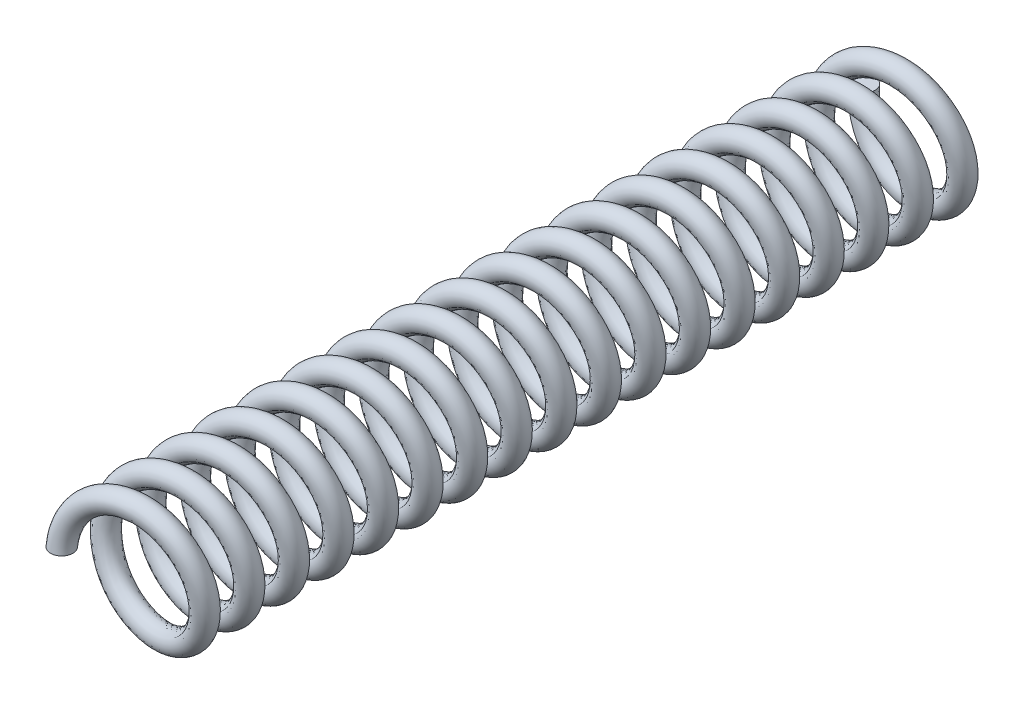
ISO-10303-21;
HEADER;
FILE_DESCRIPTION(('STEP AP214'),'2;1');
FILE_NAME('part.step','',(''),(''),'','','');
FILE_SCHEMA(('AUTOMOTIVE_DESIGN { 1 0 10303 214 1 1 1 1 }'));
ENDSEC;
DATA;
#1=APPLICATION_CONTEXT('core data for automotive mechanical design processes');
#2=APPLICATION_PROTOCOL_DEFINITION('international standard','automotive_design',2000,#1);
#3=PRODUCT_CONTEXT('',#1,'mechanical');
#4=PRODUCT('Part','Part','',(#3));
#5=PRODUCT_RELATED_PRODUCT_CATEGORY('part','',(#4));
#6=PRODUCT_DEFINITION_FORMATION('','',#4);
#7=PRODUCT_DEFINITION_CONTEXT('part definition',#1,'design');
#8=PRODUCT_DEFINITION('design','',#6,#7);
#9=PRODUCT_DEFINITION_SHAPE('','',#8);
#10=(LENGTH_UNIT() NAMED_UNIT(*) SI_UNIT(.MILLI.,.METRE.));
#11=(NAMED_UNIT(*) PLANE_ANGLE_UNIT() SI_UNIT($,.RADIAN.));
#12=(NAMED_UNIT(*) SI_UNIT($,.STERADIAN.) SOLID_ANGLE_UNIT());
#13=UNCERTAINTY_MEASURE_WITH_UNIT(LENGTH_MEASURE(1.E-05),#10,'distance_accuracy_value','');
#14=(GEOMETRIC_REPRESENTATION_CONTEXT(3) GLOBAL_UNCERTAINTY_ASSIGNED_CONTEXT((#13)) GLOBAL_UNIT_ASSIGNED_CONTEXT((#10,
#11,#12)) REPRESENTATION_CONTEXT('',''));
#15=CARTESIAN_POINT('',(0.,0.,0.));
#16=DIRECTION('',(0.,0.,1.));
#17=DIRECTION('',(1.,0.,0.));
#18=AXIS2_PLACEMENT_3D('',#15,#16,#17);
#19=CARTESIAN_POINT('',(-8.5725,0.,-12.7));
#20=DIRECTION('',(0.,1.,0.));
#21=DIRECTION('',(0.,0.,1.));
#22=AXIS2_PLACEMENT_3D('',#19,#20,#21);
#23=PLANE('',#22);
#24=CARTESIAN_POINT('',(-8.5725,0.,-12.7));
#25=DIRECTION('',(0.,1.,0.));
#26=DIRECTION('',(0.,0.,1.));
#27=AXIS2_PLACEMENT_3D('',#24,#25,#26);
#28=CIRCLE('',#27,1.5875);
#29=CARTESIAN_POINT('',(-8.5725,0.,-11.1125));
#30=VERTEX_POINT('',#29);
#31=EDGE_CURVE('E42',#30,#30,#28,.T.);
#32=ORIENTED_EDGE('',*,*,#31,.F.);
#33=EDGE_LOOP('',(#32));
#34=FACE_BOUND('',#33,.T.);
#35=ADVANCED_FACE('F32',(#34),#23,.F.);
#36=CARTESIAN_POINT('',(-8.5725,2.15501211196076E-12,-127.));
#37=DIRECTION('',(2.51386656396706E-13,1.,0.));
#38=DIRECTION('',(0.,0.,1.));
#39=AXIS2_PLACEMENT_3D('',#36,#37,#38);
#40=PLANE('',#39);
#41=CARTESIAN_POINT('',(-8.5725,2.15501211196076E-12,-127.));
#42=DIRECTION('',(2.51386656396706E-13,1.,0.));
#43=DIRECTION('',(0.,0.,1.));
#44=AXIS2_PLACEMENT_3D('',#41,#42,#43);
#45=CIRCLE('',#44,1.5875);
#46=CARTESIAN_POINT('',(-8.5725,2.15501211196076E-12,-125.4125));
#47=VERTEX_POINT('',#46);
#48=EDGE_CURVE('E11',#47,#47,#45,.T.);
#49=ORIENTED_EDGE('',*,*,#48,.T.);
#50=EDGE_LOOP('',(#49));
#51=FACE_BOUND('',#50,.T.);
#52=ADVANCED_FACE('F49',(#51),#40,.T.);
#53=CARTESIAN_POINT('',(-8.5725,0.,-11.1125));
#54=CARTESIAN_POINT('',(-8.57250000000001,4.94933518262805,-11.6416666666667));
#55=CARTESIAN_POINT('',(-4.28625000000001,7.42400277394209,-12.1708333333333));
#56=CARTESIAN_POINT('',(0.,9.89867036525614,-12.7));
#57=CARTESIAN_POINT('',(4.28624999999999,7.42400277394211,-13.2291666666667));
#58=CARTESIAN_POINT('',(8.57249999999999,4.94933518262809,-13.7583333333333));
#59=CARTESIAN_POINT('',(8.5725,0.,-14.2875));
#60=CARTESIAN_POINT('',(8.57250000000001,-4.94933518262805,-14.8166666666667));
#61=CARTESIAN_POINT('',(4.28625000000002,-7.42400277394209,-15.3458333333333));
#62=CARTESIAN_POINT('',(0.,-9.89867036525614,-15.875));
#63=CARTESIAN_POINT('',(-4.28624999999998,-7.42400277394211,-16.4041666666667));
#64=CARTESIAN_POINT('',(-8.57249999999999,-4.94933518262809,-16.9333333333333));
#65=CARTESIAN_POINT('',(-8.5725,0.,-17.4625));
#66=CARTESIAN_POINT('',(-8.57250000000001,4.94933518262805,-17.9916666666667));
#67=CARTESIAN_POINT('',(-4.28625000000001,7.42400277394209,-18.5208333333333));
#68=CARTESIAN_POINT('',(0.,9.89867036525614,-19.05));
#69=CARTESIAN_POINT('',(4.28624999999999,7.42400277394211,-19.5791666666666));
#70=CARTESIAN_POINT('',(8.57249999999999,4.94933518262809,-20.1083333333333));
#71=CARTESIAN_POINT('',(8.5725,0.,-20.6375));
#72=CARTESIAN_POINT('',(8.57250000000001,-4.94933518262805,-21.1666666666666));
#73=CARTESIAN_POINT('',(4.28625000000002,-7.42400277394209,-21.6958333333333));
#74=CARTESIAN_POINT('',(0.,-9.89867036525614,-22.225));
#75=CARTESIAN_POINT('',(-4.28624999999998,-7.42400277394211,-22.7541666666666));
#76=CARTESIAN_POINT('',(-8.57249999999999,-4.94933518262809,-23.2833333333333));
#77=CARTESIAN_POINT('',(-8.5725,0.,-23.8125));
#78=CARTESIAN_POINT('',(-8.57250000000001,4.94933518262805,-24.3416666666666));
#79=CARTESIAN_POINT('',(-4.28625000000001,7.42400277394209,-24.8708333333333));
#80=CARTESIAN_POINT('',(0.,9.89867036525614,-25.4));
#81=CARTESIAN_POINT('',(4.28624999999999,7.42400277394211,-25.9291666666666));
#82=CARTESIAN_POINT('',(8.57249999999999,4.94933518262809,-26.4583333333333));
#83=CARTESIAN_POINT('',(8.5725,0.,-26.9875));
#84=CARTESIAN_POINT('',(8.57250000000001,-4.94933518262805,-27.5166666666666));
#85=CARTESIAN_POINT('',(4.28625000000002,-7.42400277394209,-28.0458333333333));
#86=CARTESIAN_POINT('',(0.,-9.89867036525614,-28.575));
#87=CARTESIAN_POINT('',(-4.28624999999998,-7.42400277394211,-29.1041666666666));
#88=CARTESIAN_POINT('',(-8.57249999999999,-4.94933518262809,-29.6333333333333));
#89=CARTESIAN_POINT('',(-8.5725,0.,-30.1625));
#90=CARTESIAN_POINT('',(-8.57250000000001,4.94933518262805,-30.6916666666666));
#91=CARTESIAN_POINT('',(-4.28625000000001,7.42400277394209,-31.2208333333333));
#92=CARTESIAN_POINT('',(0.,9.89867036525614,-31.75));
#93=CARTESIAN_POINT('',(4.28624999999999,7.42400277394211,-32.2791666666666));
#94=CARTESIAN_POINT('',(8.57249999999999,4.94933518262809,-32.8083333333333));
#95=CARTESIAN_POINT('',(8.5725,0.,-33.3374999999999));
#96=CARTESIAN_POINT('',(8.57250000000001,-4.94933518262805,-33.8666666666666));
#97=CARTESIAN_POINT('',(4.28625000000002,-7.42400277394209,-34.3958333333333));
#98=CARTESIAN_POINT('',(0.,-9.89867036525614,-34.9249999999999));
#99=CARTESIAN_POINT('',(-4.28624999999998,-7.42400277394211,-35.4541666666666));
#100=CARTESIAN_POINT('',(-8.57249999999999,-4.94933518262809,-35.9833333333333));
#101=CARTESIAN_POINT('',(-8.5725,0.,-36.5124999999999));
#102=CARTESIAN_POINT('',(-8.57250000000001,4.94933518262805,-37.0416666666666));
#103=CARTESIAN_POINT('',(-4.28625000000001,7.42400277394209,-37.5708333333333));
#104=CARTESIAN_POINT('',(0.,9.89867036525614,-38.0999999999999));
#105=CARTESIAN_POINT('',(4.28624999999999,7.42400277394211,-38.6291666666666));
#106=CARTESIAN_POINT('',(8.57249999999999,4.94933518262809,-39.1583333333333));
#107=CARTESIAN_POINT('',(8.5725,0.,-39.6874999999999));
#108=CARTESIAN_POINT('',(8.57250000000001,-4.94933518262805,-40.2166666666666));
#109=CARTESIAN_POINT('',(4.28625000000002,-7.42400277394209,-40.7458333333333));
#110=CARTESIAN_POINT('',(0.,-9.89867036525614,-41.2749999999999));
#111=CARTESIAN_POINT('',(-4.28624999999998,-7.42400277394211,-41.8041666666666));
#112=CARTESIAN_POINT('',(-8.57249999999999,-4.94933518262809,-42.3333333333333));
#113=CARTESIAN_POINT('',(-8.5725,0.,-42.8624999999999));
#114=CARTESIAN_POINT('',(-8.57250000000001,4.94933518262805,-43.3916666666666));
#115=CARTESIAN_POINT('',(-4.28625000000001,7.42400277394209,-43.9208333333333));
#116=CARTESIAN_POINT('',(0.,9.89867036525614,-44.4499999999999));
#117=CARTESIAN_POINT('',(4.28624999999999,7.42400277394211,-44.9791666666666));
#118=CARTESIAN_POINT('',(8.57249999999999,4.94933518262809,-45.5083333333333));
#119=CARTESIAN_POINT('',(8.5725,0.,-46.0374999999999));
#120=CARTESIAN_POINT('',(8.57250000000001,-4.94933518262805,-46.5666666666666));
#121=CARTESIAN_POINT('',(4.28625000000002,-7.42400277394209,-47.0958333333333));
#122=CARTESIAN_POINT('',(0.,-9.89867036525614,-47.6249999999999));
#123=CARTESIAN_POINT('',(-4.28624999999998,-7.42400277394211,-48.1541666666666));
#124=CARTESIAN_POINT('',(-8.57249999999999,-4.94933518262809,-48.6833333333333));
#125=CARTESIAN_POINT('',(-8.5725,0.,-49.2124999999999));
#126=CARTESIAN_POINT('',(-8.57250000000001,4.94933518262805,-49.7416666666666));
#127=CARTESIAN_POINT('',(-4.28625000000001,7.42400277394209,-50.2708333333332));
#128=CARTESIAN_POINT('',(0.,9.89867036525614,-50.7999999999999));
#129=CARTESIAN_POINT('',(4.28624999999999,7.42400277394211,-51.3291666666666));
#130=CARTESIAN_POINT('',(8.57249999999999,4.94933518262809,-51.8583333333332));
#131=CARTESIAN_POINT('',(8.5725,0.,-52.3874999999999));
#132=CARTESIAN_POINT('',(8.57250000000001,-4.94933518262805,-52.9166666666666));
#133=CARTESIAN_POINT('',(4.28625000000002,-7.42400277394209,-53.4458333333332));
#134=CARTESIAN_POINT('',(0.,-9.89867036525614,-53.9749999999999));
#135=CARTESIAN_POINT('',(-4.28624999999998,-7.42400277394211,-54.5041666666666));
#136=CARTESIAN_POINT('',(-8.57249999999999,-4.94933518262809,-55.0333333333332));
#137=CARTESIAN_POINT('',(-8.5725,0.,-55.5624999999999));
#138=CARTESIAN_POINT('',(-8.57250000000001,4.94933518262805,-56.0916666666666));
#139=CARTESIAN_POINT('',(-4.28625000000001,7.42400277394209,-56.6208333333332));
#140=CARTESIAN_POINT('',(0.,9.89867036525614,-57.1499999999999));
#141=CARTESIAN_POINT('',(4.28624999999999,7.42400277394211,-57.6791666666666));
#142=CARTESIAN_POINT('',(8.57249999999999,4.94933518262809,-58.2083333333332));
#143=CARTESIAN_POINT('',(8.5725,0.,-58.7374999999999));
#144=CARTESIAN_POINT('',(8.57250000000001,-4.94933518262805,-59.2666666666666));
#145=CARTESIAN_POINT('',(4.28625000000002,-7.42400277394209,-59.7958333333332));
#146=CARTESIAN_POINT('',(0.,-9.89867036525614,-60.3249999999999));
#147=CARTESIAN_POINT('',(-4.28624999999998,-7.42400277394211,-60.8541666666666));
#148=CARTESIAN_POINT('',(-8.57249999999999,-4.94933518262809,-61.3833333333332));
#149=CARTESIAN_POINT('',(-8.5725,0.,-61.9124999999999));
#150=CARTESIAN_POINT('',(-8.57250000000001,4.94933518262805,-62.4416666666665));
#151=CARTESIAN_POINT('',(-4.28625000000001,7.42400277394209,-62.9708333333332));
#152=CARTESIAN_POINT('',(0.,9.89867036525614,-63.4999999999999));
#153=CARTESIAN_POINT('',(4.28624999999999,7.42400277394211,-64.0291666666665));
#154=CARTESIAN_POINT('',(8.57249999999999,4.94933518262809,-64.5583333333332));
#155=CARTESIAN_POINT('',(8.5725,0.,-65.0874999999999));
#156=CARTESIAN_POINT('',(8.57250000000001,-4.94933518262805,-65.6166666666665));
#157=CARTESIAN_POINT('',(4.28625000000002,-7.42400277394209,-66.1458333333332));
#158=CARTESIAN_POINT('',(0.,-9.89867036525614,-66.6749999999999));
#159=CARTESIAN_POINT('',(-4.28624999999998,-7.42400277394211,-67.2041666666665));
#160=CARTESIAN_POINT('',(-8.57249999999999,-4.94933518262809,-67.7333333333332));
#161=CARTESIAN_POINT('',(-8.5725,0.,-68.2624999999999));
#162=CARTESIAN_POINT('',(-8.57250000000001,4.94933518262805,-68.7916666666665));
#163=CARTESIAN_POINT('',(-4.28625000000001,7.42400277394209,-69.3208333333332));
#164=CARTESIAN_POINT('',(0.,9.89867036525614,-69.8499999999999));
#165=CARTESIAN_POINT('',(4.28624999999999,7.42400277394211,-70.3791666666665));
#166=CARTESIAN_POINT('',(8.57249999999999,4.94933518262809,-70.9083333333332));
#167=CARTESIAN_POINT('',(8.5725,0.,-71.4374999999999));
#168=CARTESIAN_POINT('',(8.57250000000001,-4.94933518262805,-71.9666666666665));
#169=CARTESIAN_POINT('',(4.28625000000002,-7.42400277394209,-72.4958333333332));
#170=CARTESIAN_POINT('',(0.,-9.89867036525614,-73.0249999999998));
#171=CARTESIAN_POINT('',(-4.28624999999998,-7.42400277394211,-73.5541666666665));
#172=CARTESIAN_POINT('',(-8.57249999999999,-4.94933518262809,-74.0833333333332));
#173=CARTESIAN_POINT('',(-8.5725,0.,-74.6124999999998));
#174=CARTESIAN_POINT('',(-8.57250000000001,4.94933518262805,-75.1416666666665));
#175=CARTESIAN_POINT('',(-4.28625000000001,7.42400277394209,-75.6708333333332));
#176=CARTESIAN_POINT('',(0.,9.89867036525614,-76.1999999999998));
#177=CARTESIAN_POINT('',(4.28624999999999,7.42400277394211,-76.7291666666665));
#178=CARTESIAN_POINT('',(8.57249999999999,4.94933518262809,-77.2583333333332));
#179=CARTESIAN_POINT('',(8.5725,0.,-77.7874999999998));
#180=CARTESIAN_POINT('',(8.57250000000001,-4.94933518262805,-78.3166666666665));
#181=CARTESIAN_POINT('',(4.28625000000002,-7.42400277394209,-78.8458333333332));
#182=CARTESIAN_POINT('',(0.,-9.89867036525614,-79.3749999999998));
#183=CARTESIAN_POINT('',(-4.28624999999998,-7.42400277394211,-79.9041666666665));
#184=CARTESIAN_POINT('',(-8.57249999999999,-4.94933518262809,-80.4333333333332));
#185=CARTESIAN_POINT('',(-8.5725,0.,-80.9624999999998));
#186=CARTESIAN_POINT('',(-8.57250000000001,4.94933518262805,-81.4916666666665));
#187=CARTESIAN_POINT('',(-4.28625000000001,7.42400277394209,-82.0208333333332));
#188=CARTESIAN_POINT('',(0.,9.89867036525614,-82.5499999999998));
#189=CARTESIAN_POINT('',(4.28624999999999,7.42400277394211,-83.0791666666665));
#190=CARTESIAN_POINT('',(8.57249999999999,4.94933518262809,-83.6083333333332));
#191=CARTESIAN_POINT('',(8.5725,0.,-84.1374999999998));
#192=CARTESIAN_POINT('',(8.57250000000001,-4.94933518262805,-84.6666666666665));
#193=CARTESIAN_POINT('',(4.28625000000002,-7.42400277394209,-85.1958333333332));
#194=CARTESIAN_POINT('',(0.,-9.89867036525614,-85.7249999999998));
#195=CARTESIAN_POINT('',(-4.28624999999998,-7.42400277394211,-86.2541666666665));
#196=CARTESIAN_POINT('',(-8.57249999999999,-4.94933518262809,-86.7833333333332));
#197=CARTESIAN_POINT('',(-8.5725,0.,-87.3124999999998));
#198=CARTESIAN_POINT('',(-8.57250000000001,4.94933518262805,-87.8416666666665));
#199=CARTESIAN_POINT('',(-4.28625000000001,7.42400277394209,-88.3708333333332));
#200=CARTESIAN_POINT('',(0.,9.89867036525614,-88.8999999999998));
#201=CARTESIAN_POINT('',(4.28624999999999,7.42400277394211,-89.4291666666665));
#202=CARTESIAN_POINT('',(8.57249999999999,4.94933518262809,-89.9583333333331));
#203=CARTESIAN_POINT('',(8.5725,0.,-90.4874999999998));
#204=CARTESIAN_POINT('',(8.57250000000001,-4.94933518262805,-91.0166666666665));
#205=CARTESIAN_POINT('',(4.28625000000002,-7.42400277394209,-91.5458333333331));
#206=CARTESIAN_POINT('',(0.,-9.89867036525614,-92.0749999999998));
#207=CARTESIAN_POINT('',(-4.28624999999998,-7.42400277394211,-92.6041666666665));
#208=CARTESIAN_POINT('',(-8.57249999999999,-4.94933518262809,-93.1333333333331));
#209=CARTESIAN_POINT('',(-8.5725,0.,-93.6624999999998));
#210=CARTESIAN_POINT('',(-8.57250000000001,4.94933518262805,-94.1916666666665));
#211=CARTESIAN_POINT('',(-4.28625000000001,7.42400277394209,-94.7208333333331));
#212=CARTESIAN_POINT('',(0.,9.89867036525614,-95.2499999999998));
#213=CARTESIAN_POINT('',(4.28624999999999,7.42400277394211,-95.7791666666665));
#214=CARTESIAN_POINT('',(8.57249999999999,4.94933518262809,-96.3083333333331));
#215=CARTESIAN_POINT('',(8.5725,0.,-96.8374999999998));
#216=CARTESIAN_POINT('',(8.57250000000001,-4.94933518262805,-97.3666666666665));
#217=CARTESIAN_POINT('',(4.28625000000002,-7.42400277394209,-97.8958333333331));
#218=CARTESIAN_POINT('',(0.,-9.89867036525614,-98.4249999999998));
#219=CARTESIAN_POINT('',(-4.28624999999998,-7.42400277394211,-98.9541666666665));
#220=CARTESIAN_POINT('',(-8.57249999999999,-4.94933518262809,-99.4833333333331));
#221=CARTESIAN_POINT('',(-8.5725,0.,-100.0125));
#222=CARTESIAN_POINT('',(-8.57250000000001,4.94933518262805,-100.541666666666));
#223=CARTESIAN_POINT('',(-4.28625000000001,7.42400277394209,-101.070833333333));
#224=CARTESIAN_POINT('',(0.,9.89867036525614,-101.6));
#225=CARTESIAN_POINT('',(4.28624999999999,7.42400277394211,-102.129166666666));
#226=CARTESIAN_POINT('',(8.57249999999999,4.94933518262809,-102.658333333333));
#227=CARTESIAN_POINT('',(8.5725,0.,-103.1875));
#228=CARTESIAN_POINT('',(8.57250000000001,-4.94933518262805,-103.716666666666));
#229=CARTESIAN_POINT('',(4.28625000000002,-7.42400277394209,-104.245833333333));
#230=CARTESIAN_POINT('',(0.,-9.89867036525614,-104.775));
#231=CARTESIAN_POINT('',(-4.28624999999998,-7.42400277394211,-105.304166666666));
#232=CARTESIAN_POINT('',(-8.57249999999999,-4.94933518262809,-105.833333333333));
#233=CARTESIAN_POINT('',(-8.5725,0.,-106.3625));
#234=CARTESIAN_POINT('',(-8.57250000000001,4.94933518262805,-106.891666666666));
#235=CARTESIAN_POINT('',(-4.28625000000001,7.42400277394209,-107.420833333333));
#236=CARTESIAN_POINT('',(0.,9.89867036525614,-107.95));
#237=CARTESIAN_POINT('',(4.28624999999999,7.42400277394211,-108.479166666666));
#238=CARTESIAN_POINT('',(8.57249999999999,4.94933518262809,-109.008333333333));
#239=CARTESIAN_POINT('',(8.5725,0.,-109.5375));
#240=CARTESIAN_POINT('',(8.57250000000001,-4.94933518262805,-110.066666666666));
#241=CARTESIAN_POINT('',(4.28625000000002,-7.42400277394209,-110.595833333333));
#242=CARTESIAN_POINT('',(0.,-9.89867036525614,-111.125));
#243=CARTESIAN_POINT('',(-4.28624999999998,-7.42400277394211,-111.654166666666));
#244=CARTESIAN_POINT('',(-8.57249999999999,-4.94933518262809,-112.183333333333));
#245=CARTESIAN_POINT('',(-8.5725,0.,-112.7125));
#246=CARTESIAN_POINT('',(-8.57250000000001,4.94933518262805,-113.241666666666));
#247=CARTESIAN_POINT('',(-4.28625000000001,7.42400277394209,-113.770833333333));
#248=CARTESIAN_POINT('',(0.,9.89867036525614,-114.3));
#249=CARTESIAN_POINT('',(4.28624999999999,7.42400277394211,-114.829166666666));
#250=CARTESIAN_POINT('',(8.57249999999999,4.94933518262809,-115.358333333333));
#251=CARTESIAN_POINT('',(8.5725,0.,-115.8875));
#252=CARTESIAN_POINT('',(8.57250000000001,-4.94933518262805,-116.416666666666));
#253=CARTESIAN_POINT('',(4.28625000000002,-7.42400277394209,-116.945833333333));
#254=CARTESIAN_POINT('',(0.,-9.89867036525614,-117.475));
#255=CARTESIAN_POINT('',(-4.28624999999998,-7.42400277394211,-118.004166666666));
#256=CARTESIAN_POINT('',(-8.57249999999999,-4.94933518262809,-118.533333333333));
#257=CARTESIAN_POINT('',(-8.5725,0.,-119.0625));
#258=CARTESIAN_POINT('',(-8.57250000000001,4.94933518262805,-119.591666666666));
#259=CARTESIAN_POINT('',(-4.28625000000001,7.42400277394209,-120.120833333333));
#260=CARTESIAN_POINT('',(0.,9.89867036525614,-120.65));
#261=CARTESIAN_POINT('',(4.28624999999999,7.42400277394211,-121.179166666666));
#262=CARTESIAN_POINT('',(8.57249999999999,4.94933518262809,-121.708333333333));
#263=CARTESIAN_POINT('',(8.5725,0.,-122.2375));
#264=CARTESIAN_POINT('',(8.57250000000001,-4.94933518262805,-122.766666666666));
#265=CARTESIAN_POINT('',(4.28625000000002,-7.42400277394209,-123.295833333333));
#266=CARTESIAN_POINT('',(0.,-9.89867036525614,-123.825));
#267=CARTESIAN_POINT('',(-4.28624999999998,-7.42400277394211,-124.354166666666));
#268=CARTESIAN_POINT('',(-8.57249999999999,-4.94933518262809,-124.883333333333));
#269=CARTESIAN_POINT('',(-8.5725,0.,-125.4125));
#270=CARTESIAN_POINT('',(-8.57250000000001,4.94933518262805,-125.941666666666));
#271=CARTESIAN_POINT('',(-4.28625000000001,7.42400277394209,-126.470833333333));
#272=CARTESIAN_POINT('',(0.,9.89867036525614,-127.));
#273=CARTESIAN_POINT('',(4.28624999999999,7.42400277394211,-127.529166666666));
#274=CARTESIAN_POINT('',(8.57249999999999,4.94933518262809,-128.058333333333));
#275=CARTESIAN_POINT('',(8.5725,0.,-128.5875));
#276=CARTESIAN_POINT('',(8.57250000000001,-4.94933518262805,-129.116666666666));
#277=CARTESIAN_POINT('',(4.28625000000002,-7.42400277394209,-129.645833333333));
#278=CARTESIAN_POINT('',(0.,-9.89867036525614,-130.175));
#279=CARTESIAN_POINT('',(-4.28624999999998,-7.42400277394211,-130.704166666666));
#280=CARTESIAN_POINT('',(-8.57249999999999,-4.94933518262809,-131.233333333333));
#281=CARTESIAN_POINT('',(-8.5725,0.,-131.7625));
#282=CARTESIAN_POINT('',(-5.3975,0.,-11.1125));
#283=CARTESIAN_POINT('',(-5.39750000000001,3.116248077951,-11.6416666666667));
#284=CARTESIAN_POINT('',(-2.69875000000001,4.67437211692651,-12.1708333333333));
#285=CARTESIAN_POINT('',(0.,6.23249615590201,-12.7));
#286=CARTESIAN_POINT('',(2.69874999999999,4.67437211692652,-13.2291666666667));
#287=CARTESIAN_POINT('',(5.3975,3.11624807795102,-13.7583333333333));
#288=CARTESIAN_POINT('',(5.3975,0.,-14.2875));
#289=CARTESIAN_POINT('',(5.39750000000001,-3.116248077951,-14.8166666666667));
#290=CARTESIAN_POINT('',(2.69875000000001,-4.67437211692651,-15.3458333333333));
#291=CARTESIAN_POINT('',(0.,-6.23249615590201,-15.875));
#292=CARTESIAN_POINT('',(-2.69874999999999,-4.67437211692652,-16.4041666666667));
#293=CARTESIAN_POINT('',(-5.3975,-3.11624807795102,-16.9333333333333));
#294=CARTESIAN_POINT('',(-5.3975,0.,-17.4625));
#295=CARTESIAN_POINT('',(-5.39750000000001,3.116248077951,-17.9916666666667));
#296=CARTESIAN_POINT('',(-2.69875000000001,4.67437211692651,-18.5208333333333));
#297=CARTESIAN_POINT('',(0.,6.23249615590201,-19.05));
#298=CARTESIAN_POINT('',(2.69874999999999,4.67437211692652,-19.5791666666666));
#299=CARTESIAN_POINT('',(5.3975,3.11624807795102,-20.1083333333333));
#300=CARTESIAN_POINT('',(5.3975,0.,-20.6375));
#301=CARTESIAN_POINT('',(5.39750000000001,-3.116248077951,-21.1666666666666));
#302=CARTESIAN_POINT('',(2.69875000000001,-4.67437211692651,-21.6958333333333));
#303=CARTESIAN_POINT('',(0.,-6.23249615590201,-22.225));
#304=CARTESIAN_POINT('',(-2.69874999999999,-4.67437211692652,-22.7541666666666));
#305=CARTESIAN_POINT('',(-5.3975,-3.11624807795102,-23.2833333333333));
#306=CARTESIAN_POINT('',(-5.3975,0.,-23.8125));
#307=CARTESIAN_POINT('',(-5.39750000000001,3.116248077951,-24.3416666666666));
#308=CARTESIAN_POINT('',(-2.69875000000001,4.67437211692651,-24.8708333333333));
#309=CARTESIAN_POINT('',(0.,6.23249615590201,-25.4));
#310=CARTESIAN_POINT('',(2.69874999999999,4.67437211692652,-25.9291666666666));
#311=CARTESIAN_POINT('',(5.3975,3.11624807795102,-26.4583333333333));
#312=CARTESIAN_POINT('',(5.3975,0.,-26.9875));
#313=CARTESIAN_POINT('',(5.39750000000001,-3.116248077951,-27.5166666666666));
#314=CARTESIAN_POINT('',(2.69875000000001,-4.67437211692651,-28.0458333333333));
#315=CARTESIAN_POINT('',(0.,-6.23249615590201,-28.575));
#316=CARTESIAN_POINT('',(-2.69874999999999,-4.67437211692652,-29.1041666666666));
#317=CARTESIAN_POINT('',(-5.3975,-3.11624807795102,-29.6333333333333));
#318=CARTESIAN_POINT('',(-5.3975,0.,-30.1625));
#319=CARTESIAN_POINT('',(-5.39750000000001,3.116248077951,-30.6916666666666));
#320=CARTESIAN_POINT('',(-2.69875000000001,4.67437211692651,-31.2208333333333));
#321=CARTESIAN_POINT('',(0.,6.23249615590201,-31.75));
#322=CARTESIAN_POINT('',(2.69874999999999,4.67437211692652,-32.2791666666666));
#323=CARTESIAN_POINT('',(5.3975,3.11624807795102,-32.8083333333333));
#324=CARTESIAN_POINT('',(5.3975,0.,-33.3374999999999));
#325=CARTESIAN_POINT('',(5.39750000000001,-3.116248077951,-33.8666666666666));
#326=CARTESIAN_POINT('',(2.69875000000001,-4.67437211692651,-34.3958333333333));
#327=CARTESIAN_POINT('',(0.,-6.23249615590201,-34.9249999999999));
#328=CARTESIAN_POINT('',(-2.69874999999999,-4.67437211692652,-35.4541666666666));
#329=CARTESIAN_POINT('',(-5.3975,-3.11624807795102,-35.9833333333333));
#330=CARTESIAN_POINT('',(-5.3975,0.,-36.5124999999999));
#331=CARTESIAN_POINT('',(-5.39750000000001,3.116248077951,-37.0416666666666));
#332=CARTESIAN_POINT('',(-2.69875000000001,4.67437211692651,-37.5708333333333));
#333=CARTESIAN_POINT('',(0.,6.23249615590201,-38.0999999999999));
#334=CARTESIAN_POINT('',(2.69874999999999,4.67437211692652,-38.6291666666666));
#335=CARTESIAN_POINT('',(5.3975,3.11624807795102,-39.1583333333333));
#336=CARTESIAN_POINT('',(5.3975,0.,-39.6874999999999));
#337=CARTESIAN_POINT('',(5.39750000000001,-3.116248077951,-40.2166666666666));
#338=CARTESIAN_POINT('',(2.69875000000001,-4.67437211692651,-40.7458333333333));
#339=CARTESIAN_POINT('',(0.,-6.23249615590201,-41.2749999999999));
#340=CARTESIAN_POINT('',(-2.69874999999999,-4.67437211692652,-41.8041666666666));
#341=CARTESIAN_POINT('',(-5.3975,-3.11624807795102,-42.3333333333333));
#342=CARTESIAN_POINT('',(-5.3975,0.,-42.8624999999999));
#343=CARTESIAN_POINT('',(-5.39750000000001,3.116248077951,-43.3916666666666));
#344=CARTESIAN_POINT('',(-2.69875000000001,4.67437211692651,-43.9208333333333));
#345=CARTESIAN_POINT('',(0.,6.23249615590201,-44.4499999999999));
#346=CARTESIAN_POINT('',(2.69874999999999,4.67437211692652,-44.9791666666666));
#347=CARTESIAN_POINT('',(5.3975,3.11624807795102,-45.5083333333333));
#348=CARTESIAN_POINT('',(5.3975,0.,-46.0374999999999));
#349=CARTESIAN_POINT('',(5.39750000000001,-3.116248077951,-46.5666666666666));
#350=CARTESIAN_POINT('',(2.69875000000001,-4.67437211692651,-47.0958333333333));
#351=CARTESIAN_POINT('',(0.,-6.23249615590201,-47.6249999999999));
#352=CARTESIAN_POINT('',(-2.69874999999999,-4.67437211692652,-48.1541666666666));
#353=CARTESIAN_POINT('',(-5.3975,-3.11624807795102,-48.6833333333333));
#354=CARTESIAN_POINT('',(-5.3975,0.,-49.2124999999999));
#355=CARTESIAN_POINT('',(-5.39750000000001,3.116248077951,-49.7416666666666));
#356=CARTESIAN_POINT('',(-2.69875000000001,4.67437211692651,-50.2708333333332));
#357=CARTESIAN_POINT('',(0.,6.23249615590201,-50.7999999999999));
#358=CARTESIAN_POINT('',(2.69874999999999,4.67437211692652,-51.3291666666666));
#359=CARTESIAN_POINT('',(5.3975,3.11624807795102,-51.8583333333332));
#360=CARTESIAN_POINT('',(5.3975,0.,-52.3874999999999));
#361=CARTESIAN_POINT('',(5.39750000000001,-3.116248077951,-52.9166666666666));
#362=CARTESIAN_POINT('',(2.69875000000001,-4.67437211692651,-53.4458333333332));
#363=CARTESIAN_POINT('',(0.,-6.23249615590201,-53.9749999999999));
#364=CARTESIAN_POINT('',(-2.69874999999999,-4.67437211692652,-54.5041666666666));
#365=CARTESIAN_POINT('',(-5.3975,-3.11624807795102,-55.0333333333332));
#366=CARTESIAN_POINT('',(-5.3975,0.,-55.5624999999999));
#367=CARTESIAN_POINT('',(-5.39750000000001,3.116248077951,-56.0916666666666));
#368=CARTESIAN_POINT('',(-2.69875000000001,4.67437211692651,-56.6208333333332));
#369=CARTESIAN_POINT('',(0.,6.23249615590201,-57.1499999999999));
#370=CARTESIAN_POINT('',(2.69874999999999,4.67437211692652,-57.6791666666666));
#371=CARTESIAN_POINT('',(5.3975,3.11624807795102,-58.2083333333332));
#372=CARTESIAN_POINT('',(5.3975,0.,-58.7374999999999));
#373=CARTESIAN_POINT('',(5.39750000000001,-3.116248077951,-59.2666666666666));
#374=CARTESIAN_POINT('',(2.69875000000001,-4.67437211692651,-59.7958333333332));
#375=CARTESIAN_POINT('',(0.,-6.23249615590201,-60.3249999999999));
#376=CARTESIAN_POINT('',(-2.69874999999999,-4.67437211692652,-60.8541666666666));
#377=CARTESIAN_POINT('',(-5.3975,-3.11624807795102,-61.3833333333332));
#378=CARTESIAN_POINT('',(-5.3975,0.,-61.9124999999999));
#379=CARTESIAN_POINT('',(-5.39750000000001,3.116248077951,-62.4416666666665));
#380=CARTESIAN_POINT('',(-2.69875000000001,4.67437211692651,-62.9708333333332));
#381=CARTESIAN_POINT('',(0.,6.23249615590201,-63.4999999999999));
#382=CARTESIAN_POINT('',(2.69874999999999,4.67437211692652,-64.0291666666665));
#383=CARTESIAN_POINT('',(5.3975,3.11624807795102,-64.5583333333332));
#384=CARTESIAN_POINT('',(5.3975,0.,-65.0874999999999));
#385=CARTESIAN_POINT('',(5.39750000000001,-3.116248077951,-65.6166666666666));
#386=CARTESIAN_POINT('',(2.69875000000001,-4.67437211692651,-66.1458333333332));
#387=CARTESIAN_POINT('',(0.,-6.23249615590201,-66.6749999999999));
#388=CARTESIAN_POINT('',(-2.69874999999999,-4.67437211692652,-67.2041666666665));
#389=CARTESIAN_POINT('',(-5.3975,-3.11624807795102,-67.7333333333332));
#390=CARTESIAN_POINT('',(-5.3975,0.,-68.2624999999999));
#391=CARTESIAN_POINT('',(-5.39750000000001,3.116248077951,-68.7916666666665));
#392=CARTESIAN_POINT('',(-2.69875000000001,4.67437211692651,-69.3208333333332));
#393=CARTESIAN_POINT('',(0.,6.23249615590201,-69.8499999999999));
#394=CARTESIAN_POINT('',(2.69874999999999,4.67437211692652,-70.3791666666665));
#395=CARTESIAN_POINT('',(5.3975,3.11624807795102,-70.9083333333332));
#396=CARTESIAN_POINT('',(5.3975,0.,-71.4374999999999));
#397=CARTESIAN_POINT('',(5.39750000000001,-3.116248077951,-71.9666666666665));
#398=CARTESIAN_POINT('',(2.69875000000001,-4.67437211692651,-72.4958333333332));
#399=CARTESIAN_POINT('',(0.,-6.23249615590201,-73.0249999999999));
#400=CARTESIAN_POINT('',(-2.69874999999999,-4.67437211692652,-73.5541666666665));
#401=CARTESIAN_POINT('',(-5.3975,-3.11624807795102,-74.0833333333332));
#402=CARTESIAN_POINT('',(-5.3975,0.,-74.6124999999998));
#403=CARTESIAN_POINT('',(-5.39750000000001,3.116248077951,-75.1416666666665));
#404=CARTESIAN_POINT('',(-2.69875000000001,4.67437211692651,-75.6708333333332));
#405=CARTESIAN_POINT('',(0.,6.23249615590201,-76.1999999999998));
#406=CARTESIAN_POINT('',(2.69874999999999,4.67437211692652,-76.7291666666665));
#407=CARTESIAN_POINT('',(5.3975,3.11624807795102,-77.2583333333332));
#408=CARTESIAN_POINT('',(5.3975,0.,-77.7874999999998));
#409=CARTESIAN_POINT('',(5.39750000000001,-3.116248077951,-78.3166666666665));
#410=CARTESIAN_POINT('',(2.69875000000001,-4.67437211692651,-78.8458333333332));
#411=CARTESIAN_POINT('',(0.,-6.23249615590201,-79.3749999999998));
#412=CARTESIAN_POINT('',(-2.69874999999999,-4.67437211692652,-79.9041666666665));
#413=CARTESIAN_POINT('',(-5.3975,-3.11624807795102,-80.4333333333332));
#414=CARTESIAN_POINT('',(-5.3975,0.,-80.9624999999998));
#415=CARTESIAN_POINT('',(-5.39750000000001,3.116248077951,-81.4916666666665));
#416=CARTESIAN_POINT('',(-2.69875000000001,4.67437211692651,-82.0208333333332));
#417=CARTESIAN_POINT('',(0.,6.23249615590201,-82.5499999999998));
#418=CARTESIAN_POINT('',(2.69874999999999,4.67437211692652,-83.0791666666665));
#419=CARTESIAN_POINT('',(5.3975,3.11624807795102,-83.6083333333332));
#420=CARTESIAN_POINT('',(5.3975,0.,-84.1374999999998));
#421=CARTESIAN_POINT('',(5.39750000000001,-3.116248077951,-84.6666666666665));
#422=CARTESIAN_POINT('',(2.69875000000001,-4.67437211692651,-85.1958333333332));
#423=CARTESIAN_POINT('',(0.,-6.23249615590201,-85.7249999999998));
#424=CARTESIAN_POINT('',(-2.69874999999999,-4.67437211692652,-86.2541666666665));
#425=CARTESIAN_POINT('',(-5.3975,-3.11624807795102,-86.7833333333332));
#426=CARTESIAN_POINT('',(-5.3975,0.,-87.3124999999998));
#427=CARTESIAN_POINT('',(-5.39750000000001,3.116248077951,-87.8416666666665));
#428=CARTESIAN_POINT('',(-2.69875000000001,4.67437211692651,-88.3708333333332));
#429=CARTESIAN_POINT('',(0.,6.23249615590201,-88.8999999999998));
#430=CARTESIAN_POINT('',(2.69874999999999,4.67437211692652,-89.4291666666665));
#431=CARTESIAN_POINT('',(5.3975,3.11624807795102,-89.9583333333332));
#432=CARTESIAN_POINT('',(5.3975,0.,-90.4874999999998));
#433=CARTESIAN_POINT('',(5.39750000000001,-3.116248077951,-91.0166666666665));
#434=CARTESIAN_POINT('',(2.69875000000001,-4.67437211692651,-91.5458333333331));
#435=CARTESIAN_POINT('',(0.,-6.23249615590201,-92.0749999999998));
#436=CARTESIAN_POINT('',(-2.69874999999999,-4.67437211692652,-92.6041666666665));
#437=CARTESIAN_POINT('',(-5.3975,-3.11624807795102,-93.1333333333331));
#438=CARTESIAN_POINT('',(-5.3975,0.,-93.6624999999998));
#439=CARTESIAN_POINT('',(-5.39750000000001,3.116248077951,-94.1916666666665));
#440=CARTESIAN_POINT('',(-2.69875000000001,4.67437211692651,-94.7208333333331));
#441=CARTESIAN_POINT('',(0.,6.23249615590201,-95.2499999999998));
#442=CARTESIAN_POINT('',(2.69874999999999,4.67437211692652,-95.7791666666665));
#443=CARTESIAN_POINT('',(5.3975,3.11624807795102,-96.3083333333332));
#444=CARTESIAN_POINT('',(5.3975,0.,-96.8374999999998));
#445=CARTESIAN_POINT('',(5.39750000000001,-3.116248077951,-97.3666666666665));
#446=CARTESIAN_POINT('',(2.69875000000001,-4.67437211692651,-97.8958333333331));
#447=CARTESIAN_POINT('',(0.,-6.23249615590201,-98.4249999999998));
#448=CARTESIAN_POINT('',(-2.69874999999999,-4.67437211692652,-98.9541666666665));
#449=CARTESIAN_POINT('',(-5.3975,-3.11624807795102,-99.4833333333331));
#450=CARTESIAN_POINT('',(-5.3975,0.,-100.0125));
#451=CARTESIAN_POINT('',(-5.39750000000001,3.116248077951,-100.541666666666));
#452=CARTESIAN_POINT('',(-2.69875000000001,4.67437211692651,-101.070833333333));
#453=CARTESIAN_POINT('',(0.,6.23249615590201,-101.6));
#454=CARTESIAN_POINT('',(2.69874999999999,4.67437211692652,-102.129166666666));
#455=CARTESIAN_POINT('',(5.3975,3.11624807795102,-102.658333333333));
#456=CARTESIAN_POINT('',(5.3975,0.,-103.1875));
#457=CARTESIAN_POINT('',(5.39750000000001,-3.116248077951,-103.716666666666));
#458=CARTESIAN_POINT('',(2.69875000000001,-4.67437211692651,-104.245833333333));
#459=CARTESIAN_POINT('',(0.,-6.23249615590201,-104.775));
#460=CARTESIAN_POINT('',(-2.69874999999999,-4.67437211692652,-105.304166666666));
#461=CARTESIAN_POINT('',(-5.3975,-3.11624807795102,-105.833333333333));
#462=CARTESIAN_POINT('',(-5.3975,0.,-106.3625));
#463=CARTESIAN_POINT('',(-5.39750000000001,3.116248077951,-106.891666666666));
#464=CARTESIAN_POINT('',(-2.69875000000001,4.67437211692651,-107.420833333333));
#465=CARTESIAN_POINT('',(0.,6.23249615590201,-107.95));
#466=CARTESIAN_POINT('',(2.69874999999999,4.67437211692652,-108.479166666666));
#467=CARTESIAN_POINT('',(5.3975,3.11624807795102,-109.008333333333));
#468=CARTESIAN_POINT('',(5.3975,0.,-109.5375));
#469=CARTESIAN_POINT('',(5.39750000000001,-3.116248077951,-110.066666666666));
#470=CARTESIAN_POINT('',(2.69875000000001,-4.67437211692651,-110.595833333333));
#471=CARTESIAN_POINT('',(0.,-6.23249615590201,-111.125));
#472=CARTESIAN_POINT('',(-2.69874999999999,-4.67437211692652,-111.654166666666));
#473=CARTESIAN_POINT('',(-5.3975,-3.11624807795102,-112.183333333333));
#474=CARTESIAN_POINT('',(-5.3975,0.,-112.7125));
#475=CARTESIAN_POINT('',(-5.39750000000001,3.116248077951,-113.241666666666));
#476=CARTESIAN_POINT('',(-2.69875000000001,4.67437211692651,-113.770833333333));
#477=CARTESIAN_POINT('',(0.,6.23249615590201,-114.3));
#478=CARTESIAN_POINT('',(2.69874999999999,4.67437211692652,-114.829166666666));
#479=CARTESIAN_POINT('',(5.3975,3.11624807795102,-115.358333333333));
#480=CARTESIAN_POINT('',(5.3975,0.,-115.8875));
#481=CARTESIAN_POINT('',(5.39750000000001,-3.116248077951,-116.416666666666));
#482=CARTESIAN_POINT('',(2.69875000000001,-4.67437211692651,-116.945833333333));
#483=CARTESIAN_POINT('',(0.,-6.23249615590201,-117.475));
#484=CARTESIAN_POINT('',(-2.69874999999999,-4.67437211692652,-118.004166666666));
#485=CARTESIAN_POINT('',(-5.3975,-3.11624807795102,-118.533333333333));
#486=CARTESIAN_POINT('',(-5.3975,0.,-119.0625));
#487=CARTESIAN_POINT('',(-5.39750000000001,3.116248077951,-119.591666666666));
#488=CARTESIAN_POINT('',(-2.69875000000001,4.67437211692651,-120.120833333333));
#489=CARTESIAN_POINT('',(0.,6.23249615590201,-120.65));
#490=CARTESIAN_POINT('',(2.69874999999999,4.67437211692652,-121.179166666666));
#491=CARTESIAN_POINT('',(5.3975,3.11624807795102,-121.708333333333));
#492=CARTESIAN_POINT('',(5.3975,0.,-122.2375));
#493=CARTESIAN_POINT('',(5.39750000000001,-3.116248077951,-122.766666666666));
#494=CARTESIAN_POINT('',(2.69875000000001,-4.67437211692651,-123.295833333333));
#495=CARTESIAN_POINT('',(0.,-6.23249615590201,-123.825));
#496=CARTESIAN_POINT('',(-2.69874999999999,-4.67437211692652,-124.354166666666));
#497=CARTESIAN_POINT('',(-5.3975,-3.11624807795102,-124.883333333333));
#498=CARTESIAN_POINT('',(-5.3975,0.,-125.4125));
#499=CARTESIAN_POINT('',(-5.39750000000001,3.116248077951,-125.941666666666));
#500=CARTESIAN_POINT('',(-2.69875000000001,4.67437211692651,-126.470833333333));
#501=CARTESIAN_POINT('',(0.,6.23249615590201,-127.));
#502=CARTESIAN_POINT('',(2.69874999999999,4.67437211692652,-127.529166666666));
#503=CARTESIAN_POINT('',(5.3975,3.11624807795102,-128.058333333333));
#504=CARTESIAN_POINT('',(5.3975,0.,-128.5875));
#505=CARTESIAN_POINT('',(5.39750000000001,-3.116248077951,-129.116666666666));
#506=CARTESIAN_POINT('',(2.69875000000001,-4.67437211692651,-129.645833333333));
#507=CARTESIAN_POINT('',(0.,-6.23249615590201,-130.175));
#508=CARTESIAN_POINT('',(-2.69874999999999,-4.67437211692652,-130.704166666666));
#509=CARTESIAN_POINT('',(-5.3975,-3.11624807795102,-131.233333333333));
#510=CARTESIAN_POINT('',(-5.3975,0.,-131.7625));
#511=CARTESIAN_POINT('',(-5.3975,0.,-14.2875));
#512=CARTESIAN_POINT('',(-5.39750000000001,3.116248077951,-14.8166666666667));
#513=CARTESIAN_POINT('',(-2.69875000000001,4.67437211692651,-15.3458333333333));
#514=CARTESIAN_POINT('',(0.,6.23249615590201,-15.875));
#515=CARTESIAN_POINT('',(2.69874999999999,4.67437211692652,-16.4041666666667));
#516=CARTESIAN_POINT('',(5.3975,3.11624807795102,-16.9333333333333));
#517=CARTESIAN_POINT('',(5.3975,0.,-17.4625));
#518=CARTESIAN_POINT('',(5.39750000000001,-3.116248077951,-17.9916666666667));
#519=CARTESIAN_POINT('',(2.69875000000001,-4.67437211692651,-18.5208333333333));
#520=CARTESIAN_POINT('',(0.,-6.23249615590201,-19.05));
#521=CARTESIAN_POINT('',(-2.69874999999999,-4.67437211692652,-19.5791666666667));
#522=CARTESIAN_POINT('',(-5.3975,-3.11624807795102,-20.1083333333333));
#523=CARTESIAN_POINT('',(-5.3975,0.,-20.6375));
#524=CARTESIAN_POINT('',(-5.39750000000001,3.116248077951,-21.1666666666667));
#525=CARTESIAN_POINT('',(-2.69875000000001,4.67437211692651,-21.6958333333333));
#526=CARTESIAN_POINT('',(0.,6.23249615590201,-22.225));
#527=CARTESIAN_POINT('',(2.69874999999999,4.67437211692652,-22.7541666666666));
#528=CARTESIAN_POINT('',(5.3975,3.11624807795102,-23.2833333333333));
#529=CARTESIAN_POINT('',(5.3975,0.,-23.8125));
#530=CARTESIAN_POINT('',(5.39750000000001,-3.116248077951,-24.3416666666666));
#531=CARTESIAN_POINT('',(2.69875000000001,-4.67437211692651,-24.8708333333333));
#532=CARTESIAN_POINT('',(0.,-6.23249615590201,-25.4));
#533=CARTESIAN_POINT('',(-2.69874999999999,-4.67437211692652,-25.9291666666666));
#534=CARTESIAN_POINT('',(-5.3975,-3.11624807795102,-26.4583333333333));
#535=CARTESIAN_POINT('',(-5.3975,0.,-26.9875));
#536=CARTESIAN_POINT('',(-5.39750000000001,3.116248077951,-27.5166666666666));
#537=CARTESIAN_POINT('',(-2.69875000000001,4.67437211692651,-28.0458333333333));
#538=CARTESIAN_POINT('',(0.,6.23249615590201,-28.575));
#539=CARTESIAN_POINT('',(2.69874999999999,4.67437211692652,-29.1041666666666));
#540=CARTESIAN_POINT('',(5.3975,3.11624807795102,-29.6333333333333));
#541=CARTESIAN_POINT('',(5.3975,0.,-30.1625));
#542=CARTESIAN_POINT('',(5.39750000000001,-3.116248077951,-30.6916666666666));
#543=CARTESIAN_POINT('',(2.69875000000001,-4.67437211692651,-31.2208333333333));
#544=CARTESIAN_POINT('',(0.,-6.23249615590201,-31.75));
#545=CARTESIAN_POINT('',(-2.69874999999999,-4.67437211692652,-32.2791666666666));
#546=CARTESIAN_POINT('',(-5.3975,-3.11624807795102,-32.8083333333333));
#547=CARTESIAN_POINT('',(-5.3975,0.,-33.3374999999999));
#548=CARTESIAN_POINT('',(-5.39750000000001,3.116248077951,-33.8666666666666));
#549=CARTESIAN_POINT('',(-2.69875000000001,4.67437211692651,-34.3958333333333));
#550=CARTESIAN_POINT('',(0.,6.23249615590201,-34.925));
#551=CARTESIAN_POINT('',(2.69874999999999,4.67437211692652,-35.4541666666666));
#552=CARTESIAN_POINT('',(5.3975,3.11624807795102,-35.9833333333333));
#553=CARTESIAN_POINT('',(5.3975,0.,-36.5124999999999));
#554=CARTESIAN_POINT('',(5.39750000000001,-3.116248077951,-37.0416666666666));
#555=CARTESIAN_POINT('',(2.69875000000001,-4.67437211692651,-37.5708333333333));
#556=CARTESIAN_POINT('',(0.,-6.23249615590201,-38.0999999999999));
#557=CARTESIAN_POINT('',(-2.69874999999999,-4.67437211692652,-38.6291666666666));
#558=CARTESIAN_POINT('',(-5.3975,-3.11624807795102,-39.1583333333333));
#559=CARTESIAN_POINT('',(-5.3975,0.,-39.6874999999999));
#560=CARTESIAN_POINT('',(-5.39750000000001,3.116248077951,-40.2166666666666));
#561=CARTESIAN_POINT('',(-2.69875000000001,4.67437211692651,-40.7458333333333));
#562=CARTESIAN_POINT('',(0.,6.23249615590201,-41.2749999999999));
#563=CARTESIAN_POINT('',(2.69874999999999,4.67437211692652,-41.8041666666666));
#564=CARTESIAN_POINT('',(5.3975,3.11624807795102,-42.3333333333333));
#565=CARTESIAN_POINT('',(5.3975,0.,-42.8624999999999));
#566=CARTESIAN_POINT('',(5.39750000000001,-3.116248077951,-43.3916666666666));
#567=CARTESIAN_POINT('',(2.69875000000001,-4.67437211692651,-43.9208333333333));
#568=CARTESIAN_POINT('',(0.,-6.23249615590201,-44.4499999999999));
#569=CARTESIAN_POINT('',(-2.69874999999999,-4.67437211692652,-44.9791666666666));
#570=CARTESIAN_POINT('',(-5.3975,-3.11624807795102,-45.5083333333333));
#571=CARTESIAN_POINT('',(-5.3975,0.,-46.0374999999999));
#572=CARTESIAN_POINT('',(-5.39750000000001,3.116248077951,-46.5666666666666));
#573=CARTESIAN_POINT('',(-2.69875000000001,4.67437211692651,-47.0958333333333));
#574=CARTESIAN_POINT('',(0.,6.23249615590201,-47.6249999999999));
#575=CARTESIAN_POINT('',(2.69874999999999,4.67437211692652,-48.1541666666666));
#576=CARTESIAN_POINT('',(5.3975,3.11624807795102,-48.6833333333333));
#577=CARTESIAN_POINT('',(5.3975,0.,-49.2124999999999));
#578=CARTESIAN_POINT('',(5.39750000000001,-3.116248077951,-49.7416666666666));
#579=CARTESIAN_POINT('',(2.69875000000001,-4.67437211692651,-50.2708333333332));
#580=CARTESIAN_POINT('',(0.,-6.23249615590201,-50.7999999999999));
#581=CARTESIAN_POINT('',(-2.69874999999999,-4.67437211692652,-51.3291666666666));
#582=CARTESIAN_POINT('',(-5.3975,-3.11624807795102,-51.8583333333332));
#583=CARTESIAN_POINT('',(-5.3975,0.,-52.3874999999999));
#584=CARTESIAN_POINT('',(-5.39750000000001,3.116248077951,-52.9166666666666));
#585=CARTESIAN_POINT('',(-2.69875000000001,4.67437211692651,-53.4458333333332));
#586=CARTESIAN_POINT('',(0.,6.23249615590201,-53.9749999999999));
#587=CARTESIAN_POINT('',(2.69874999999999,4.67437211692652,-54.5041666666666));
#588=CARTESIAN_POINT('',(5.3975,3.11624807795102,-55.0333333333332));
#589=CARTESIAN_POINT('',(5.3975,0.,-55.5624999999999));
#590=CARTESIAN_POINT('',(5.39750000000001,-3.116248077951,-56.0916666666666));
#591=CARTESIAN_POINT('',(2.69875000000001,-4.67437211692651,-56.6208333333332));
#592=CARTESIAN_POINT('',(0.,-6.23249615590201,-57.1499999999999));
#593=CARTESIAN_POINT('',(-2.69874999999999,-4.67437211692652,-57.6791666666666));
#594=CARTESIAN_POINT('',(-5.3975,-3.11624807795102,-58.2083333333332));
#595=CARTESIAN_POINT('',(-5.3975,0.,-58.7374999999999));
#596=CARTESIAN_POINT('',(-5.39750000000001,3.116248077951,-59.2666666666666));
#597=CARTESIAN_POINT('',(-2.69875000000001,4.67437211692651,-59.7958333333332));
#598=CARTESIAN_POINT('',(0.,6.23249615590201,-60.3249999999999));
#599=CARTESIAN_POINT('',(2.69874999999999,4.67437211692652,-60.8541666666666));
#600=CARTESIAN_POINT('',(5.3975,3.11624807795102,-61.3833333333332));
#601=CARTESIAN_POINT('',(5.3975,0.,-61.9124999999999));
#602=CARTESIAN_POINT('',(5.39750000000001,-3.116248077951,-62.4416666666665));
#603=CARTESIAN_POINT('',(2.69875000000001,-4.67437211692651,-62.9708333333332));
#604=CARTESIAN_POINT('',(0.,-6.23249615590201,-63.4999999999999));
#605=CARTESIAN_POINT('',(-2.69874999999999,-4.67437211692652,-64.0291666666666));
#606=CARTESIAN_POINT('',(-5.3975,-3.11624807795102,-64.5583333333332));
#607=CARTESIAN_POINT('',(-5.3975,0.,-65.0874999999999));
#608=CARTESIAN_POINT('',(-5.39750000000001,3.116248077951,-65.6166666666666));
#609=CARTESIAN_POINT('',(-2.69875000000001,4.67437211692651,-66.1458333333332));
#610=CARTESIAN_POINT('',(0.,6.23249615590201,-66.6749999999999));
#611=CARTESIAN_POINT('',(2.69874999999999,4.67437211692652,-67.2041666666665));
#612=CARTESIAN_POINT('',(5.3975,3.11624807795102,-67.7333333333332));
#613=CARTESIAN_POINT('',(5.3975,0.,-68.2624999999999));
#614=CARTESIAN_POINT('',(5.39750000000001,-3.116248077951,-68.7916666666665));
#615=CARTESIAN_POINT('',(2.69875000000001,-4.67437211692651,-69.3208333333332));
#616=CARTESIAN_POINT('',(0.,-6.23249615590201,-69.8499999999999));
#617=CARTESIAN_POINT('',(-2.69874999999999,-4.67437211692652,-70.3791666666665));
#618=CARTESIAN_POINT('',(-5.3975,-3.11624807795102,-70.9083333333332));
#619=CARTESIAN_POINT('',(-5.3975,0.,-71.4374999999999));
#620=CARTESIAN_POINT('',(-5.39750000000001,3.116248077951,-71.9666666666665));
#621=CARTESIAN_POINT('',(-2.69875000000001,4.67437211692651,-72.4958333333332));
#622=CARTESIAN_POINT('',(0.,6.23249615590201,-73.0249999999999));
#623=CARTESIAN_POINT('',(2.69874999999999,4.67437211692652,-73.5541666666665));
#624=CARTESIAN_POINT('',(5.3975,3.11624807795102,-74.0833333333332));
#625=CARTESIAN_POINT('',(5.3975,0.,-74.6124999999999));
#626=CARTESIAN_POINT('',(5.39750000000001,-3.116248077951,-75.1416666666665));
#627=CARTESIAN_POINT('',(2.69875000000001,-4.67437211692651,-75.6708333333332));
#628=CARTESIAN_POINT('',(0.,-6.23249615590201,-76.1999999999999));
#629=CARTESIAN_POINT('',(-2.69874999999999,-4.67437211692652,-76.7291666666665));
#630=CARTESIAN_POINT('',(-5.3975,-3.11624807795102,-77.2583333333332));
#631=CARTESIAN_POINT('',(-5.3975,0.,-77.7874999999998));
#632=CARTESIAN_POINT('',(-5.39750000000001,3.116248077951,-78.3166666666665));
#633=CARTESIAN_POINT('',(-2.69875000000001,4.67437211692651,-78.8458333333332));
#634=CARTESIAN_POINT('',(0.,6.23249615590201,-79.3749999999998));
#635=CARTESIAN_POINT('',(2.69874999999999,4.67437211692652,-79.9041666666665));
#636=CARTESIAN_POINT('',(5.3975,3.11624807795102,-80.4333333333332));
#637=CARTESIAN_POINT('',(5.3975,0.,-80.9624999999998));
#638=CARTESIAN_POINT('',(5.39750000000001,-3.116248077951,-81.4916666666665));
#639=CARTESIAN_POINT('',(2.69875000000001,-4.67437211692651,-82.0208333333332));
#640=CARTESIAN_POINT('',(0.,-6.23249615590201,-82.5499999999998));
#641=CARTESIAN_POINT('',(-2.69874999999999,-4.67437211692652,-83.0791666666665));
#642=CARTESIAN_POINT('',(-5.3975,-3.11624807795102,-83.6083333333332));
#643=CARTESIAN_POINT('',(-5.3975,0.,-84.1374999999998));
#644=CARTESIAN_POINT('',(-5.39750000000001,3.116248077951,-84.6666666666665));
#645=CARTESIAN_POINT('',(-2.69875000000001,4.67437211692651,-85.1958333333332));
#646=CARTESIAN_POINT('',(0.,6.23249615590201,-85.7249999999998));
#647=CARTESIAN_POINT('',(2.69874999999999,4.67437211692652,-86.2541666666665));
#648=CARTESIAN_POINT('',(5.3975,3.11624807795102,-86.7833333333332));
#649=CARTESIAN_POINT('',(5.3975,0.,-87.3124999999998));
#650=CARTESIAN_POINT('',(5.39750000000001,-3.116248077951,-87.8416666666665));
#651=CARTESIAN_POINT('',(2.69875000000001,-4.67437211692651,-88.3708333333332));
#652=CARTESIAN_POINT('',(0.,-6.23249615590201,-88.8999999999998));
#653=CARTESIAN_POINT('',(-2.69874999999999,-4.67437211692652,-89.4291666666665));
#654=CARTESIAN_POINT('',(-5.3975,-3.11624807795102,-89.9583333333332));
#655=CARTESIAN_POINT('',(-5.3975,0.,-90.4874999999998));
#656=CARTESIAN_POINT('',(-5.39750000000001,3.116248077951,-91.0166666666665));
#657=CARTESIAN_POINT('',(-2.69875000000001,4.67437211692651,-91.5458333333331));
#658=CARTESIAN_POINT('',(0.,6.23249615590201,-92.0749999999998));
#659=CARTESIAN_POINT('',(2.69874999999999,4.67437211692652,-92.6041666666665));
#660=CARTESIAN_POINT('',(5.3975,3.11624807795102,-93.1333333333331));
#661=CARTESIAN_POINT('',(5.3975,0.,-93.6624999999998));
#662=CARTESIAN_POINT('',(5.39750000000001,-3.116248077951,-94.1916666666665));
#663=CARTESIAN_POINT('',(2.69875000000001,-4.67437211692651,-94.7208333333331));
#664=CARTESIAN_POINT('',(0.,-6.23249615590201,-95.2499999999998));
#665=CARTESIAN_POINT('',(-2.69874999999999,-4.67437211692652,-95.7791666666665));
#666=CARTESIAN_POINT('',(-5.3975,-3.11624807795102,-96.3083333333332));
#667=CARTESIAN_POINT('',(-5.3975,0.,-96.8374999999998));
#668=CARTESIAN_POINT('',(-5.39750000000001,3.116248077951,-97.3666666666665));
#669=CARTESIAN_POINT('',(-2.69875000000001,4.67437211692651,-97.8958333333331));
#670=CARTESIAN_POINT('',(0.,6.23249615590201,-98.4249999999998));
#671=CARTESIAN_POINT('',(2.69874999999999,4.67437211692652,-98.9541666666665));
#672=CARTESIAN_POINT('',(5.3975,3.11624807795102,-99.4833333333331));
#673=CARTESIAN_POINT('',(5.3975,0.,-100.0125));
#674=CARTESIAN_POINT('',(5.39750000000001,-3.116248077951,-100.541666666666));
#675=CARTESIAN_POINT('',(2.69875000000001,-4.67437211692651,-101.070833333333));
#676=CARTESIAN_POINT('',(0.,-6.23249615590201,-101.6));
#677=CARTESIAN_POINT('',(-2.69874999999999,-4.67437211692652,-102.129166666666));
#678=CARTESIAN_POINT('',(-5.3975,-3.11624807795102,-102.658333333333));
#679=CARTESIAN_POINT('',(-5.3975,0.,-103.1875));
#680=CARTESIAN_POINT('',(-5.39750000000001,3.116248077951,-103.716666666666));
#681=CARTESIAN_POINT('',(-2.69875000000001,4.67437211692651,-104.245833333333));
#682=CARTESIAN_POINT('',(0.,6.23249615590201,-104.775));
#683=CARTESIAN_POINT('',(2.69874999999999,4.67437211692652,-105.304166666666));
#684=CARTESIAN_POINT('',(5.3975,3.11624807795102,-105.833333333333));
#685=CARTESIAN_POINT('',(5.3975,0.,-106.3625));
#686=CARTESIAN_POINT('',(5.39750000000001,-3.116248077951,-106.891666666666));
#687=CARTESIAN_POINT('',(2.69875000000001,-4.67437211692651,-107.420833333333));
#688=CARTESIAN_POINT('',(0.,-6.23249615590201,-107.95));
#689=CARTESIAN_POINT('',(-2.69874999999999,-4.67437211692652,-108.479166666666));
#690=CARTESIAN_POINT('',(-5.3975,-3.11624807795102,-109.008333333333));
#691=CARTESIAN_POINT('',(-5.3975,0.,-109.5375));
#692=CARTESIAN_POINT('',(-5.39750000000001,3.116248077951,-110.066666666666));
#693=CARTESIAN_POINT('',(-2.69875000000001,4.67437211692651,-110.595833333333));
#694=CARTESIAN_POINT('',(0.,6.23249615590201,-111.125));
#695=CARTESIAN_POINT('',(2.69874999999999,4.67437211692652,-111.654166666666));
#696=CARTESIAN_POINT('',(5.3975,3.11624807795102,-112.183333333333));
#697=CARTESIAN_POINT('',(5.3975,0.,-112.7125));
#698=CARTESIAN_POINT('',(5.39750000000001,-3.116248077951,-113.241666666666));
#699=CARTESIAN_POINT('',(2.69875000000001,-4.67437211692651,-113.770833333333));
#700=CARTESIAN_POINT('',(0.,-6.23249615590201,-114.3));
#701=CARTESIAN_POINT('',(-2.69874999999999,-4.67437211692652,-114.829166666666));
#702=CARTESIAN_POINT('',(-5.3975,-3.11624807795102,-115.358333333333));
#703=CARTESIAN_POINT('',(-5.3975,0.,-115.8875));
#704=CARTESIAN_POINT('',(-5.39750000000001,3.116248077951,-116.416666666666));
#705=CARTESIAN_POINT('',(-2.69875000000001,4.67437211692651,-116.945833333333));
#706=CARTESIAN_POINT('',(0.,6.23249615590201,-117.475));
#707=CARTESIAN_POINT('',(2.69874999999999,4.67437211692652,-118.004166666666));
#708=CARTESIAN_POINT('',(5.3975,3.11624807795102,-118.533333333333));
#709=CARTESIAN_POINT('',(5.3975,0.,-119.0625));
#710=CARTESIAN_POINT('',(5.39750000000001,-3.116248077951,-119.591666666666));
#711=CARTESIAN_POINT('',(2.69875000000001,-4.67437211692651,-120.120833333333));
#712=CARTESIAN_POINT('',(0.,-6.23249615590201,-120.65));
#713=CARTESIAN_POINT('',(-2.69874999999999,-4.67437211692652,-121.179166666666));
#714=CARTESIAN_POINT('',(-5.3975,-3.11624807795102,-121.708333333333));
#715=CARTESIAN_POINT('',(-5.3975,0.,-122.2375));
#716=CARTESIAN_POINT('',(-5.39750000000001,3.116248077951,-122.766666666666));
#717=CARTESIAN_POINT('',(-2.69875000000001,4.67437211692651,-123.295833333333));
#718=CARTESIAN_POINT('',(0.,6.23249615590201,-123.825));
#719=CARTESIAN_POINT('',(2.69874999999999,4.67437211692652,-124.354166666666));
#720=CARTESIAN_POINT('',(5.3975,3.11624807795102,-124.883333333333));
#721=CARTESIAN_POINT('',(5.3975,0.,-125.4125));
#722=CARTESIAN_POINT('',(5.39750000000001,-3.116248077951,-125.941666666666));
#723=CARTESIAN_POINT('',(2.69875000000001,-4.67437211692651,-126.470833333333));
#724=CARTESIAN_POINT('',(0.,-6.23249615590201,-127.));
#725=CARTESIAN_POINT('',(-2.69874999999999,-4.67437211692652,-127.529166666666));
#726=CARTESIAN_POINT('',(-5.3975,-3.11624807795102,-128.058333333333));
#727=CARTESIAN_POINT('',(-5.3975,0.,-128.5875));
#728=CARTESIAN_POINT('',(-5.39750000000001,3.116248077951,-129.116666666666));
#729=CARTESIAN_POINT('',(-2.69875000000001,4.67437211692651,-129.645833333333));
#730=CARTESIAN_POINT('',(0.,6.23249615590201,-130.175));
#731=CARTESIAN_POINT('',(2.69874999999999,4.67437211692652,-130.704166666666));
#732=CARTESIAN_POINT('',(5.3975,3.11624807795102,-131.233333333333));
#733=CARTESIAN_POINT('',(5.3975,0.,-131.7625));
#734=CARTESIAN_POINT('',(5.39750000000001,-3.116248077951,-132.291666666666));
#735=CARTESIAN_POINT('',(2.69875000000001,-4.67437211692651,-132.820833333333));
#736=CARTESIAN_POINT('',(0.,-6.23249615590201,-133.35));
#737=CARTESIAN_POINT('',(-2.69874999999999,-4.67437211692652,-133.879166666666));
#738=CARTESIAN_POINT('',(-5.3975,-3.11624807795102,-134.408333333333));
#739=CARTESIAN_POINT('',(-5.3975,0.,-134.9375));
#740=CARTESIAN_POINT('',(-8.5725,0.,-14.2875));
#741=CARTESIAN_POINT('',(-8.57250000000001,4.94933518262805,-14.8166666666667));
#742=CARTESIAN_POINT('',(-4.28625000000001,7.42400277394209,-15.3458333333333));
#743=CARTESIAN_POINT('',(0.,9.89867036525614,-15.875));
#744=CARTESIAN_POINT('',(4.28624999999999,7.42400277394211,-16.4041666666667));
#745=CARTESIAN_POINT('',(8.57249999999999,4.94933518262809,-16.9333333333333));
#746=CARTESIAN_POINT('',(8.5725,0.,-17.4625));
#747=CARTESIAN_POINT('',(8.57250000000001,-4.94933518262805,-17.9916666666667));
#748=CARTESIAN_POINT('',(4.28625000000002,-7.42400277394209,-18.5208333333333));
#749=CARTESIAN_POINT('',(0.,-9.89867036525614,-19.05));
#750=CARTESIAN_POINT('',(-4.28624999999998,-7.42400277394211,-19.5791666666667));
#751=CARTESIAN_POINT('',(-8.57249999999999,-4.94933518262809,-20.1083333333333));
#752=CARTESIAN_POINT('',(-8.5725,0.,-20.6375));
#753=CARTESIAN_POINT('',(-8.57250000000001,4.94933518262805,-21.1666666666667));
#754=CARTESIAN_POINT('',(-4.28625000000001,7.42400277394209,-21.6958333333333));
#755=CARTESIAN_POINT('',(0.,9.89867036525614,-22.225));
#756=CARTESIAN_POINT('',(4.28624999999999,7.42400277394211,-22.7541666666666));
#757=CARTESIAN_POINT('',(8.57249999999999,4.94933518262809,-23.2833333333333));
#758=CARTESIAN_POINT('',(8.5725,0.,-23.8125));
#759=CARTESIAN_POINT('',(8.57250000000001,-4.94933518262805,-24.3416666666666));
#760=CARTESIAN_POINT('',(4.28625000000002,-7.42400277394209,-24.8708333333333));
#761=CARTESIAN_POINT('',(0.,-9.89867036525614,-25.4));
#762=CARTESIAN_POINT('',(-4.28624999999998,-7.42400277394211,-25.9291666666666));
#763=CARTESIAN_POINT('',(-8.57249999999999,-4.94933518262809,-26.4583333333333));
#764=CARTESIAN_POINT('',(-8.5725,0.,-26.9875));
#765=CARTESIAN_POINT('',(-8.57250000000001,4.94933518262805,-27.5166666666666));
#766=CARTESIAN_POINT('',(-4.28625000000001,7.42400277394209,-28.0458333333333));
#767=CARTESIAN_POINT('',(0.,9.89867036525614,-28.575));
#768=CARTESIAN_POINT('',(4.28624999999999,7.42400277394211,-29.1041666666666));
#769=CARTESIAN_POINT('',(8.57249999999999,4.94933518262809,-29.6333333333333));
#770=CARTESIAN_POINT('',(8.5725,0.,-30.1625));
#771=CARTESIAN_POINT('',(8.57250000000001,-4.94933518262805,-30.6916666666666));
#772=CARTESIAN_POINT('',(4.28625000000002,-7.42400277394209,-31.2208333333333));
#773=CARTESIAN_POINT('',(0.,-9.89867036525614,-31.75));
#774=CARTESIAN_POINT('',(-4.28624999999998,-7.42400277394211,-32.2791666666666));
#775=CARTESIAN_POINT('',(-8.57249999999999,-4.94933518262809,-32.8083333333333));
#776=CARTESIAN_POINT('',(-8.5725,0.,-33.3375));
#777=CARTESIAN_POINT('',(-8.57250000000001,4.94933518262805,-33.8666666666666));
#778=CARTESIAN_POINT('',(-4.28625000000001,7.42400277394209,-34.3958333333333));
#779=CARTESIAN_POINT('',(0.,9.89867036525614,-34.9249999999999));
#780=CARTESIAN_POINT('',(4.28624999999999,7.42400277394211,-35.4541666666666));
#781=CARTESIAN_POINT('',(8.57249999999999,4.94933518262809,-35.9833333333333));
#782=CARTESIAN_POINT('',(8.5725,0.,-36.5124999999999));
#783=CARTESIAN_POINT('',(8.57250000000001,-4.94933518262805,-37.0416666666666));
#784=CARTESIAN_POINT('',(4.28625000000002,-7.42400277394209,-37.5708333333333));
#785=CARTESIAN_POINT('',(0.,-9.89867036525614,-38.0999999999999));
#786=CARTESIAN_POINT('',(-4.28624999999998,-7.42400277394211,-38.6291666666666));
#787=CARTESIAN_POINT('',(-8.57249999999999,-4.94933518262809,-39.1583333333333));
#788=CARTESIAN_POINT('',(-8.5725,0.,-39.6874999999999));
#789=CARTESIAN_POINT('',(-8.57250000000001,4.94933518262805,-40.2166666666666));
#790=CARTESIAN_POINT('',(-4.28625000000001,7.42400277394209,-40.7458333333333));
#791=CARTESIAN_POINT('',(0.,9.89867036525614,-41.2749999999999));
#792=CARTESIAN_POINT('',(4.28624999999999,7.42400277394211,-41.8041666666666));
#793=CARTESIAN_POINT('',(8.57249999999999,4.94933518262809,-42.3333333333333));
#794=CARTESIAN_POINT('',(8.5725,0.,-42.8624999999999));
#795=CARTESIAN_POINT('',(8.57250000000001,-4.94933518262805,-43.3916666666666));
#796=CARTESIAN_POINT('',(4.28625000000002,-7.42400277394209,-43.9208333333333));
#797=CARTESIAN_POINT('',(0.,-9.89867036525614,-44.4499999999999));
#798=CARTESIAN_POINT('',(-4.28624999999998,-7.42400277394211,-44.9791666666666));
#799=CARTESIAN_POINT('',(-8.57249999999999,-4.94933518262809,-45.5083333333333));
#800=CARTESIAN_POINT('',(-8.5725,0.,-46.0374999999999));
#801=CARTESIAN_POINT('',(-8.57250000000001,4.94933518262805,-46.5666666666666));
#802=CARTESIAN_POINT('',(-4.28625000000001,7.42400277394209,-47.0958333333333));
#803=CARTESIAN_POINT('',(0.,9.89867036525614,-47.6249999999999));
#804=CARTESIAN_POINT('',(4.28624999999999,7.42400277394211,-48.1541666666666));
#805=CARTESIAN_POINT('',(8.57249999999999,4.94933518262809,-48.6833333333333));
#806=CARTESIAN_POINT('',(8.5725,0.,-49.2124999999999));
#807=CARTESIAN_POINT('',(8.57250000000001,-4.94933518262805,-49.7416666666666));
#808=CARTESIAN_POINT('',(4.28625000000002,-7.42400277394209,-50.2708333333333));
#809=CARTESIAN_POINT('',(0.,-9.89867036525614,-50.7999999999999));
#810=CARTESIAN_POINT('',(-4.28624999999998,-7.42400277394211,-51.3291666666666));
#811=CARTESIAN_POINT('',(-8.57249999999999,-4.94933518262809,-51.8583333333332));
#812=CARTESIAN_POINT('',(-8.5725,0.,-52.3874999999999));
#813=CARTESIAN_POINT('',(-8.57250000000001,4.94933518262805,-52.9166666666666));
#814=CARTESIAN_POINT('',(-4.28625000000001,7.42400277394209,-53.4458333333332));
#815=CARTESIAN_POINT('',(0.,9.89867036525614,-53.9749999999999));
#816=CARTESIAN_POINT('',(4.28624999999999,7.42400277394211,-54.5041666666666));
#817=CARTESIAN_POINT('',(8.57249999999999,4.94933518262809,-55.0333333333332));
#818=CARTESIAN_POINT('',(8.5725,0.,-55.5624999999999));
#819=CARTESIAN_POINT('',(8.57250000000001,-4.94933518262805,-56.0916666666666));
#820=CARTESIAN_POINT('',(4.28625000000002,-7.42400277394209,-56.6208333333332));
#821=CARTESIAN_POINT('',(0.,-9.89867036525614,-57.1499999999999));
#822=CARTESIAN_POINT('',(-4.28624999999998,-7.42400277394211,-57.6791666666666));
#823=CARTESIAN_POINT('',(-8.57249999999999,-4.94933518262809,-58.2083333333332));
#824=CARTESIAN_POINT('',(-8.5725,0.,-58.7374999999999));
#825=CARTESIAN_POINT('',(-8.57250000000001,4.94933518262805,-59.2666666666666));
#826=CARTESIAN_POINT('',(-4.28625000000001,7.42400277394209,-59.7958333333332));
#827=CARTESIAN_POINT('',(0.,9.89867036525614,-60.3249999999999));
#828=CARTESIAN_POINT('',(4.28624999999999,7.42400277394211,-60.8541666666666));
#829=CARTESIAN_POINT('',(8.57249999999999,4.94933518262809,-61.3833333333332));
#830=CARTESIAN_POINT('',(8.5725,0.,-61.9124999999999));
#831=CARTESIAN_POINT('',(8.57250000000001,-4.94933518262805,-62.4416666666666));
#832=CARTESIAN_POINT('',(4.28625000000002,-7.42400277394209,-62.9708333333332));
#833=CARTESIAN_POINT('',(0.,-9.89867036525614,-63.4999999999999));
#834=CARTESIAN_POINT('',(-4.28624999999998,-7.42400277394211,-64.0291666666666));
#835=CARTESIAN_POINT('',(-8.57249999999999,-4.94933518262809,-64.5583333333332));
#836=CARTESIAN_POINT('',(-8.5725,0.,-65.0874999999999));
#837=CARTESIAN_POINT('',(-8.57250000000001,4.94933518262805,-65.6166666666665));
#838=CARTESIAN_POINT('',(-4.28625000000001,7.42400277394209,-66.1458333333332));
#839=CARTESIAN_POINT('',(0.,9.89867036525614,-66.6749999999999));
#840=CARTESIAN_POINT('',(4.28624999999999,7.42400277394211,-67.2041666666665));
#841=CARTESIAN_POINT('',(8.57249999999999,4.94933518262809,-67.7333333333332));
#842=CARTESIAN_POINT('',(8.5725,0.,-68.2624999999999));
#843=CARTESIAN_POINT('',(8.57250000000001,-4.94933518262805,-68.7916666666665));
#844=CARTESIAN_POINT('',(4.28625000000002,-7.42400277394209,-69.3208333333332));
#845=CARTESIAN_POINT('',(0.,-9.89867036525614,-69.8499999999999));
#846=CARTESIAN_POINT('',(-4.28624999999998,-7.42400277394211,-70.3791666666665));
#847=CARTESIAN_POINT('',(-8.57249999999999,-4.94933518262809,-70.9083333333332));
#848=CARTESIAN_POINT('',(-8.5725,0.,-71.4374999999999));
#849=CARTESIAN_POINT('',(-8.57250000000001,4.94933518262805,-71.9666666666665));
#850=CARTESIAN_POINT('',(-4.28625000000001,7.42400277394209,-72.4958333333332));
#851=CARTESIAN_POINT('',(0.,9.89867036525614,-73.0249999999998));
#852=CARTESIAN_POINT('',(4.28624999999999,7.42400277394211,-73.5541666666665));
#853=CARTESIAN_POINT('',(8.57249999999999,4.94933518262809,-74.0833333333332));
#854=CARTESIAN_POINT('',(8.5725,0.,-74.6124999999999));
#855=CARTESIAN_POINT('',(8.57250000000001,-4.94933518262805,-75.1416666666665));
#856=CARTESIAN_POINT('',(4.28625000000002,-7.42400277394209,-75.6708333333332));
#857=CARTESIAN_POINT('',(0.,-9.89867036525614,-76.1999999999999));
#858=CARTESIAN_POINT('',(-4.28624999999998,-7.42400277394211,-76.7291666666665));
#859=CARTESIAN_POINT('',(-8.57249999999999,-4.94933518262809,-77.2583333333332));
#860=CARTESIAN_POINT('',(-8.5725,0.,-77.7874999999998));
#861=CARTESIAN_POINT('',(-8.57250000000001,4.94933518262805,-78.3166666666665));
#862=CARTESIAN_POINT('',(-4.28625000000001,7.42400277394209,-78.8458333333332));
#863=CARTESIAN_POINT('',(0.,9.89867036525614,-79.3749999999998));
#864=CARTESIAN_POINT('',(4.28624999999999,7.42400277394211,-79.9041666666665));
#865=CARTESIAN_POINT('',(8.57249999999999,4.94933518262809,-80.4333333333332));
#866=CARTESIAN_POINT('',(8.5725,0.,-80.9624999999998));
#867=CARTESIAN_POINT('',(8.57250000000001,-4.94933518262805,-81.4916666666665));
#868=CARTESIAN_POINT('',(4.28625000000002,-7.42400277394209,-82.0208333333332));
#869=CARTESIAN_POINT('',(0.,-9.89867036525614,-82.5499999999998));
#870=CARTESIAN_POINT('',(-4.28624999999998,-7.42400277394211,-83.0791666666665));
#871=CARTESIAN_POINT('',(-8.57249999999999,-4.94933518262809,-83.6083333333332));
#872=CARTESIAN_POINT('',(-8.5725,0.,-84.1374999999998));
#873=CARTESIAN_POINT('',(-8.57250000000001,4.94933518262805,-84.6666666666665));
#874=CARTESIAN_POINT('',(-4.28625000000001,7.42400277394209,-85.1958333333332));
#875=CARTESIAN_POINT('',(0.,9.89867036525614,-85.7249999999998));
#876=CARTESIAN_POINT('',(4.28624999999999,7.42400277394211,-86.2541666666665));
#877=CARTESIAN_POINT('',(8.57249999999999,4.94933518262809,-86.7833333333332));
#878=CARTESIAN_POINT('',(8.5725,0.,-87.3124999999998));
#879=CARTESIAN_POINT('',(8.57250000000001,-4.94933518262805,-87.8416666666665));
#880=CARTESIAN_POINT('',(4.28625000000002,-7.42400277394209,-88.3708333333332));
#881=CARTESIAN_POINT('',(0.,-9.89867036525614,-88.8999999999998));
#882=CARTESIAN_POINT('',(-4.28624999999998,-7.42400277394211,-89.4291666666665));
#883=CARTESIAN_POINT('',(-8.57249999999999,-4.94933518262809,-89.9583333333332));
#884=CARTESIAN_POINT('',(-8.5725,0.,-90.4874999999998));
#885=CARTESIAN_POINT('',(-8.57250000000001,4.94933518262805,-91.0166666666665));
#886=CARTESIAN_POINT('',(-4.28625000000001,7.42400277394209,-91.5458333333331));
#887=CARTESIAN_POINT('',(0.,9.89867036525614,-92.0749999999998));
#888=CARTESIAN_POINT('',(4.28624999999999,7.42400277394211,-92.6041666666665));
#889=CARTESIAN_POINT('',(8.57249999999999,4.94933518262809,-93.1333333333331));
#890=CARTESIAN_POINT('',(8.5725,0.,-93.6624999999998));
#891=CARTESIAN_POINT('',(8.57250000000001,-4.94933518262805,-94.1916666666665));
#892=CARTESIAN_POINT('',(4.28625000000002,-7.42400277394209,-94.7208333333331));
#893=CARTESIAN_POINT('',(0.,-9.89867036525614,-95.2499999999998));
#894=CARTESIAN_POINT('',(-4.28624999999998,-7.42400277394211,-95.7791666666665));
#895=CARTESIAN_POINT('',(-8.57249999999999,-4.94933518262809,-96.3083333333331));
#896=CARTESIAN_POINT('',(-8.5725,0.,-96.8374999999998));
#897=CARTESIAN_POINT('',(-8.57250000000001,4.94933518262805,-97.3666666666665));
#898=CARTESIAN_POINT('',(-4.28625000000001,7.42400277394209,-97.8958333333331));
#899=CARTESIAN_POINT('',(0.,9.89867036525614,-98.4249999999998));
#900=CARTESIAN_POINT('',(4.28624999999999,7.42400277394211,-98.9541666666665));
#901=CARTESIAN_POINT('',(8.57249999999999,4.94933518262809,-99.4833333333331));
#902=CARTESIAN_POINT('',(8.5725,0.,-100.0125));
#903=CARTESIAN_POINT('',(8.57250000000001,-4.94933518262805,-100.541666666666));
#904=CARTESIAN_POINT('',(4.28625000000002,-7.42400277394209,-101.070833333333));
#905=CARTESIAN_POINT('',(0.,-9.89867036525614,-101.6));
#906=CARTESIAN_POINT('',(-4.28624999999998,-7.42400277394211,-102.129166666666));
#907=CARTESIAN_POINT('',(-8.57249999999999,-4.94933518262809,-102.658333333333));
#908=CARTESIAN_POINT('',(-8.5725,0.,-103.1875));
#909=CARTESIAN_POINT('',(-8.57250000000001,4.94933518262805,-103.716666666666));
#910=CARTESIAN_POINT('',(-4.28625000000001,7.42400277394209,-104.245833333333));
#911=CARTESIAN_POINT('',(0.,9.89867036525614,-104.775));
#912=CARTESIAN_POINT('',(4.28624999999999,7.42400277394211,-105.304166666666));
#913=CARTESIAN_POINT('',(8.57249999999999,4.94933518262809,-105.833333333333));
#914=CARTESIAN_POINT('',(8.5725,0.,-106.3625));
#915=CARTESIAN_POINT('',(8.57250000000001,-4.94933518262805,-106.891666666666));
#916=CARTESIAN_POINT('',(4.28625000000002,-7.42400277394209,-107.420833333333));
#917=CARTESIAN_POINT('',(0.,-9.89867036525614,-107.95));
#918=CARTESIAN_POINT('',(-4.28624999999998,-7.42400277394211,-108.479166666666));
#919=CARTESIAN_POINT('',(-8.57249999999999,-4.94933518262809,-109.008333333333));
#920=CARTESIAN_POINT('',(-8.5725,0.,-109.5375));
#921=CARTESIAN_POINT('',(-8.57250000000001,4.94933518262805,-110.066666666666));
#922=CARTESIAN_POINT('',(-4.28625000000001,7.42400277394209,-110.595833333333));
#923=CARTESIAN_POINT('',(0.,9.89867036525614,-111.125));
#924=CARTESIAN_POINT('',(4.28624999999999,7.42400277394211,-111.654166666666));
#925=CARTESIAN_POINT('',(8.57249999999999,4.94933518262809,-112.183333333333));
#926=CARTESIAN_POINT('',(8.5725,0.,-112.7125));
#927=CARTESIAN_POINT('',(8.57250000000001,-4.94933518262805,-113.241666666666));
#928=CARTESIAN_POINT('',(4.28625000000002,-7.42400277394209,-113.770833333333));
#929=CARTESIAN_POINT('',(0.,-9.89867036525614,-114.3));
#930=CARTESIAN_POINT('',(-4.28624999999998,-7.42400277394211,-114.829166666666));
#931=CARTESIAN_POINT('',(-8.57249999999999,-4.94933518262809,-115.358333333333));
#932=CARTESIAN_POINT('',(-8.5725,0.,-115.8875));
#933=CARTESIAN_POINT('',(-8.57250000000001,4.94933518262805,-116.416666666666));
#934=CARTESIAN_POINT('',(-4.28625000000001,7.42400277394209,-116.945833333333));
#935=CARTESIAN_POINT('',(0.,9.89867036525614,-117.475));
#936=CARTESIAN_POINT('',(4.28624999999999,7.42400277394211,-118.004166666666));
#937=CARTESIAN_POINT('',(8.57249999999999,4.94933518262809,-118.533333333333));
#938=CARTESIAN_POINT('',(8.5725,0.,-119.0625));
#939=CARTESIAN_POINT('',(8.57250000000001,-4.94933518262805,-119.591666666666));
#940=CARTESIAN_POINT('',(4.28625000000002,-7.42400277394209,-120.120833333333));
#941=CARTESIAN_POINT('',(0.,-9.89867036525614,-120.65));
#942=CARTESIAN_POINT('',(-4.28624999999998,-7.42400277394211,-121.179166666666));
#943=CARTESIAN_POINT('',(-8.57249999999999,-4.94933518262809,-121.708333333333));
#944=CARTESIAN_POINT('',(-8.5725,0.,-122.2375));
#945=CARTESIAN_POINT('',(-8.57250000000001,4.94933518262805,-122.766666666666));
#946=CARTESIAN_POINT('',(-4.28625000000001,7.42400277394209,-123.295833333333));
#947=CARTESIAN_POINT('',(0.,9.89867036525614,-123.825));
#948=CARTESIAN_POINT('',(4.28624999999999,7.42400277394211,-124.354166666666));
#949=CARTESIAN_POINT('',(8.57249999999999,4.94933518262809,-124.883333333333));
#950=CARTESIAN_POINT('',(8.5725,0.,-125.4125));
#951=CARTESIAN_POINT('',(8.57250000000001,-4.94933518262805,-125.941666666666));
#952=CARTESIAN_POINT('',(4.28625000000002,-7.42400277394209,-126.470833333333));
#953=CARTESIAN_POINT('',(0.,-9.89867036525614,-127.));
#954=CARTESIAN_POINT('',(-4.28624999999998,-7.42400277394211,-127.529166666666));
#955=CARTESIAN_POINT('',(-8.57249999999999,-4.94933518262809,-128.058333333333));
#956=CARTESIAN_POINT('',(-8.5725,0.,-128.5875));
#957=CARTESIAN_POINT('',(-8.57250000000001,4.94933518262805,-129.116666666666));
#958=CARTESIAN_POINT('',(-4.28625000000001,7.42400277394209,-129.645833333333));
#959=CARTESIAN_POINT('',(0.,9.89867036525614,-130.175));
#960=CARTESIAN_POINT('',(4.28624999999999,7.42400277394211,-130.704166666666));
#961=CARTESIAN_POINT('',(8.57249999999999,4.94933518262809,-131.233333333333));
#962=CARTESIAN_POINT('',(8.5725,0.,-131.7625));
#963=CARTESIAN_POINT('',(8.57250000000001,-4.94933518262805,-132.291666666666));
#964=CARTESIAN_POINT('',(4.28625000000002,-7.42400277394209,-132.820833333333));
#965=CARTESIAN_POINT('',(0.,-9.89867036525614,-133.35));
#966=CARTESIAN_POINT('',(-4.28624999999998,-7.42400277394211,-133.879166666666));
#967=CARTESIAN_POINT('',(-8.57249999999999,-4.94933518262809,-134.408333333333));
#968=CARTESIAN_POINT('',(-8.5725,0.,-134.9375));
#969=CARTESIAN_POINT('',(-11.7475,0.,-14.2875));
#970=CARTESIAN_POINT('',(-11.7475,6.78242228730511,-14.8166666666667));
#971=CARTESIAN_POINT('',(-5.87375000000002,10.1736334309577,-15.3458333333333));
#972=CARTESIAN_POINT('',(0.,13.5648445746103,-15.875));
#973=CARTESIAN_POINT('',(5.87374999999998,10.1736334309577,-16.4041666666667));
#974=CARTESIAN_POINT('',(11.7475,6.78242228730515,-16.9333333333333));
#975=CARTESIAN_POINT('',(11.7475,0.,-17.4625));
#976=CARTESIAN_POINT('',(11.7475,-6.7824222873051,-17.9916666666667));
#977=CARTESIAN_POINT('',(5.87375000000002,-10.1736334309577,-18.5208333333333));
#978=CARTESIAN_POINT('',(0.,-13.5648445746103,-19.05));
#979=CARTESIAN_POINT('',(-5.87374999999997,-10.1736334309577,-19.5791666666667));
#980=CARTESIAN_POINT('',(-11.7475,-6.78242228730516,-20.1083333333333));
#981=CARTESIAN_POINT('',(-11.7475,0.,-20.6375));
#982=CARTESIAN_POINT('',(-11.7475,6.78242228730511,-21.1666666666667));
#983=CARTESIAN_POINT('',(-5.87375000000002,10.1736334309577,-21.6958333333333));
#984=CARTESIAN_POINT('',(0.,13.5648445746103,-22.225));
#985=CARTESIAN_POINT('',(5.87374999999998,10.1736334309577,-22.7541666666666));
#986=CARTESIAN_POINT('',(11.7475,6.78242228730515,-23.2833333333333));
#987=CARTESIAN_POINT('',(11.7475,0.,-23.8125));
#988=CARTESIAN_POINT('',(11.7475,-6.7824222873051,-24.3416666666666));
#989=CARTESIAN_POINT('',(5.87375000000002,-10.1736334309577,-24.8708333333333));
#990=CARTESIAN_POINT('',(0.,-13.5648445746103,-25.4));
#991=CARTESIAN_POINT('',(-5.87374999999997,-10.1736334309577,-25.9291666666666));
#992=CARTESIAN_POINT('',(-11.7475,-6.78242228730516,-26.4583333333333));
#993=CARTESIAN_POINT('',(-11.7475,0.,-26.9875));
#994=CARTESIAN_POINT('',(-11.7475,6.78242228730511,-27.5166666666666));
#995=CARTESIAN_POINT('',(-5.87375000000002,10.1736334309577,-28.0458333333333));
#996=CARTESIAN_POINT('',(0.,13.5648445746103,-28.575));
#997=CARTESIAN_POINT('',(5.87374999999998,10.1736334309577,-29.1041666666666));
#998=CARTESIAN_POINT('',(11.7475,6.78242228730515,-29.6333333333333));
#999=CARTESIAN_POINT('',(11.7475,0.,-30.1625));
#1000=CARTESIAN_POINT('',(11.7475,-6.7824222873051,-30.6916666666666));
#1001=CARTESIAN_POINT('',(5.87375000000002,-10.1736334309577,-31.2208333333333));
#1002=CARTESIAN_POINT('',(0.,-13.5648445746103,-31.75));
#1003=CARTESIAN_POINT('',(-5.87374999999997,-10.1736334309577,-32.2791666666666));
#1004=CARTESIAN_POINT('',(-11.7475,-6.78242228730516,-32.8083333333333));
#1005=CARTESIAN_POINT('',(-11.7475,0.,-33.3374999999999));
#1006=CARTESIAN_POINT('',(-11.7475,6.78242228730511,-33.8666666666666));
#1007=CARTESIAN_POINT('',(-5.87375000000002,10.1736334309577,-34.3958333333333));
#1008=CARTESIAN_POINT('',(0.,13.5648445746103,-34.925));
#1009=CARTESIAN_POINT('',(5.87374999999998,10.1736334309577,-35.4541666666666));
#1010=CARTESIAN_POINT('',(11.7475,6.78242228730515,-35.9833333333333));
#1011=CARTESIAN_POINT('',(11.7475,0.,-36.5124999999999));
#1012=CARTESIAN_POINT('',(11.7475,-6.7824222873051,-37.0416666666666));
#1013=CARTESIAN_POINT('',(5.87375000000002,-10.1736334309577,-37.5708333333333));
#1014=CARTESIAN_POINT('',(0.,-13.5648445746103,-38.0999999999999));
#1015=CARTESIAN_POINT('',(-5.87374999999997,-10.1736334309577,-38.6291666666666));
#1016=CARTESIAN_POINT('',(-11.7475,-6.78242228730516,-39.1583333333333));
#1017=CARTESIAN_POINT('',(-11.7475,0.,-39.6874999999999));
#1018=CARTESIAN_POINT('',(-11.7475,6.78242228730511,-40.2166666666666));
#1019=CARTESIAN_POINT('',(-5.87375000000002,10.1736334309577,-40.7458333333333));
#1020=CARTESIAN_POINT('',(0.,13.5648445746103,-41.2749999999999));
#1021=CARTESIAN_POINT('',(5.87374999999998,10.1736334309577,-41.8041666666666));
#1022=CARTESIAN_POINT('',(11.7475,6.78242228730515,-42.3333333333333));
#1023=CARTESIAN_POINT('',(11.7475,0.,-42.8624999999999));
#1024=CARTESIAN_POINT('',(11.7475,-6.7824222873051,-43.3916666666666));
#1025=CARTESIAN_POINT('',(5.87375000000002,-10.1736334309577,-43.9208333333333));
#1026=CARTESIAN_POINT('',(0.,-13.5648445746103,-44.4499999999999));
#1027=CARTESIAN_POINT('',(-5.87374999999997,-10.1736334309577,-44.9791666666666));
#1028=CARTESIAN_POINT('',(-11.7475,-6.78242228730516,-45.5083333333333));
#1029=CARTESIAN_POINT('',(-11.7475,0.,-46.0374999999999));
#1030=CARTESIAN_POINT('',(-11.7475,6.78242228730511,-46.5666666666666));
#1031=CARTESIAN_POINT('',(-5.87375000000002,10.1736334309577,-47.0958333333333));
#1032=CARTESIAN_POINT('',(0.,13.5648445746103,-47.6249999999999));
#1033=CARTESIAN_POINT('',(5.87374999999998,10.1736334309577,-48.1541666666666));
#1034=CARTESIAN_POINT('',(11.7475,6.78242228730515,-48.6833333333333));
#1035=CARTESIAN_POINT('',(11.7475,0.,-49.2124999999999));
#1036=CARTESIAN_POINT('',(11.7475,-6.7824222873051,-49.7416666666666));
#1037=CARTESIAN_POINT('',(5.87375000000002,-10.1736334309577,-50.2708333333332));
#1038=CARTESIAN_POINT('',(0.,-13.5648445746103,-50.7999999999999));
#1039=CARTESIAN_POINT('',(-5.87374999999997,-10.1736334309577,-51.3291666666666));
#1040=CARTESIAN_POINT('',(-11.7475,-6.78242228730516,-51.8583333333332));
#1041=CARTESIAN_POINT('',(-11.7475,0.,-52.3874999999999));
#1042=CARTESIAN_POINT('',(-11.7475,6.78242228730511,-52.9166666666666));
#1043=CARTESIAN_POINT('',(-5.87375000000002,10.1736334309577,-53.4458333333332));
#1044=CARTESIAN_POINT('',(0.,13.5648445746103,-53.9749999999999));
#1045=CARTESIAN_POINT('',(5.87374999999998,10.1736334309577,-54.5041666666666));
#1046=CARTESIAN_POINT('',(11.7475,6.78242228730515,-55.0333333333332));
#1047=CARTESIAN_POINT('',(11.7475,0.,-55.5624999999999));
#1048=CARTESIAN_POINT('',(11.7475,-6.7824222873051,-56.0916666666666));
#1049=CARTESIAN_POINT('',(5.87375000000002,-10.1736334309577,-56.6208333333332));
#1050=CARTESIAN_POINT('',(0.,-13.5648445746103,-57.1499999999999));
#1051=CARTESIAN_POINT('',(-5.87374999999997,-10.1736334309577,-57.6791666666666));
#1052=CARTESIAN_POINT('',(-11.7475,-6.78242228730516,-58.2083333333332));
#1053=CARTESIAN_POINT('',(-11.7475,0.,-58.7374999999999));
#1054=CARTESIAN_POINT('',(-11.7475,6.78242228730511,-59.2666666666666));
#1055=CARTESIAN_POINT('',(-5.87375000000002,10.1736334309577,-59.7958333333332));
#1056=CARTESIAN_POINT('',(0.,13.5648445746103,-60.3249999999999));
#1057=CARTESIAN_POINT('',(5.87374999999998,10.1736334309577,-60.8541666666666));
#1058=CARTESIAN_POINT('',(11.7475,6.78242228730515,-61.3833333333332));
#1059=CARTESIAN_POINT('',(11.7475,0.,-61.9124999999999));
#1060=CARTESIAN_POINT('',(11.7475,-6.7824222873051,-62.4416666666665));
#1061=CARTESIAN_POINT('',(5.87375000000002,-10.1736334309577,-62.9708333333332));
#1062=CARTESIAN_POINT('',(0.,-13.5648445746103,-63.4999999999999));
#1063=CARTESIAN_POINT('',(-5.87374999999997,-10.1736334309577,-64.0291666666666));
#1064=CARTESIAN_POINT('',(-11.7475,-6.78242228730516,-64.5583333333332));
#1065=CARTESIAN_POINT('',(-11.7475,0.,-65.0874999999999));
#1066=CARTESIAN_POINT('',(-11.7475,6.78242228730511,-65.6166666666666));
#1067=CARTESIAN_POINT('',(-5.87375000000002,10.1736334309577,-66.1458333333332));
#1068=CARTESIAN_POINT('',(0.,13.5648445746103,-66.6749999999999));
#1069=CARTESIAN_POINT('',(5.87374999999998,10.1736334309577,-67.2041666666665));
#1070=CARTESIAN_POINT('',(11.7475,6.78242228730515,-67.7333333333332));
#1071=CARTESIAN_POINT('',(11.7475,0.,-68.2624999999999));
#1072=CARTESIAN_POINT('',(11.7475,-6.7824222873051,-68.7916666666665));
#1073=CARTESIAN_POINT('',(5.87375000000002,-10.1736334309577,-69.3208333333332));
#1074=CARTESIAN_POINT('',(0.,-13.5648445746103,-69.8499999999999));
#1075=CARTESIAN_POINT('',(-5.87374999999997,-10.1736334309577,-70.3791666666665));
#1076=CARTESIAN_POINT('',(-11.7475,-6.78242228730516,-70.9083333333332));
#1077=CARTESIAN_POINT('',(-11.7475,0.,-71.4374999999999));
#1078=CARTESIAN_POINT('',(-11.7475,6.78242228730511,-71.9666666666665));
#1079=CARTESIAN_POINT('',(-5.87375000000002,10.1736334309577,-72.4958333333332));
#1080=CARTESIAN_POINT('',(0.,13.5648445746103,-73.0249999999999));
#1081=CARTESIAN_POINT('',(5.87374999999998,10.1736334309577,-73.5541666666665));
#1082=CARTESIAN_POINT('',(11.7475,6.78242228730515,-74.0833333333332));
#1083=CARTESIAN_POINT('',(11.7475,0.,-74.6124999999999));
#1084=CARTESIAN_POINT('',(11.7475,-6.7824222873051,-75.1416666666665));
#1085=CARTESIAN_POINT('',(5.87375000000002,-10.1736334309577,-75.6708333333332));
#1086=CARTESIAN_POINT('',(0.,-13.5648445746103,-76.1999999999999));
#1087=CARTESIAN_POINT('',(-5.87374999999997,-10.1736334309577,-76.7291666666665));
#1088=CARTESIAN_POINT('',(-11.7475,-6.78242228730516,-77.2583333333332));
#1089=CARTESIAN_POINT('',(-11.7475,0.,-77.7874999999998));
#1090=CARTESIAN_POINT('',(-11.7475,6.78242228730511,-78.3166666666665));
#1091=CARTESIAN_POINT('',(-5.87375000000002,10.1736334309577,-78.8458333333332));
#1092=CARTESIAN_POINT('',(0.,13.5648445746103,-79.3749999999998));
#1093=CARTESIAN_POINT('',(5.87374999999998,10.1736334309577,-79.9041666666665));
#1094=CARTESIAN_POINT('',(11.7475,6.78242228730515,-80.4333333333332));
#1095=CARTESIAN_POINT('',(11.7475,0.,-80.9624999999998));
#1096=CARTESIAN_POINT('',(11.7475,-6.7824222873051,-81.4916666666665));
#1097=CARTESIAN_POINT('',(5.87375000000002,-10.1736334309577,-82.0208333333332));
#1098=CARTESIAN_POINT('',(0.,-13.5648445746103,-82.5499999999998));
#1099=CARTESIAN_POINT('',(-5.87374999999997,-10.1736334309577,-83.0791666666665));
#1100=CARTESIAN_POINT('',(-11.7475,-6.78242228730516,-83.6083333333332));
#1101=CARTESIAN_POINT('',(-11.7475,0.,-84.1374999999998));
#1102=CARTESIAN_POINT('',(-11.7475,6.78242228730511,-84.6666666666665));
#1103=CARTESIAN_POINT('',(-5.87375000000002,10.1736334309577,-85.1958333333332));
#1104=CARTESIAN_POINT('',(0.,13.5648445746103,-85.7249999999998));
#1105=CARTESIAN_POINT('',(5.87374999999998,10.1736334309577,-86.2541666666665));
#1106=CARTESIAN_POINT('',(11.7475,6.78242228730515,-86.7833333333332));
#1107=CARTESIAN_POINT('',(11.7475,0.,-87.3124999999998));
#1108=CARTESIAN_POINT('',(11.7475,-6.7824222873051,-87.8416666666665));
#1109=CARTESIAN_POINT('',(5.87375000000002,-10.1736334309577,-88.3708333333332));
#1110=CARTESIAN_POINT('',(0.,-13.5648445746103,-88.8999999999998));
#1111=CARTESIAN_POINT('',(-5.87374999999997,-10.1736334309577,-89.4291666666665));
#1112=CARTESIAN_POINT('',(-11.7475,-6.78242228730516,-89.9583333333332));
#1113=CARTESIAN_POINT('',(-11.7475,0.,-90.4874999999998));
#1114=CARTESIAN_POINT('',(-11.7475,6.78242228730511,-91.0166666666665));
#1115=CARTESIAN_POINT('',(-5.87375000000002,10.1736334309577,-91.5458333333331));
#1116=CARTESIAN_POINT('',(0.,13.5648445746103,-92.0749999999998));
#1117=CARTESIAN_POINT('',(5.87374999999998,10.1736334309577,-92.6041666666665));
#1118=CARTESIAN_POINT('',(11.7475,6.78242228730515,-93.1333333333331));
#1119=CARTESIAN_POINT('',(11.7475,0.,-93.6624999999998));
#1120=CARTESIAN_POINT('',(11.7475,-6.7824222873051,-94.1916666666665));
#1121=CARTESIAN_POINT('',(5.87375000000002,-10.1736334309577,-94.7208333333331));
#1122=CARTESIAN_POINT('',(0.,-13.5648445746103,-95.2499999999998));
#1123=CARTESIAN_POINT('',(-5.87374999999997,-10.1736334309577,-95.7791666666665));
#1124=CARTESIAN_POINT('',(-11.7475,-6.78242228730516,-96.3083333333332));
#1125=CARTESIAN_POINT('',(-11.7475,0.,-96.8374999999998));
#1126=CARTESIAN_POINT('',(-11.7475,6.78242228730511,-97.3666666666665));
#1127=CARTESIAN_POINT('',(-5.87375000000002,10.1736334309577,-97.8958333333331));
#1128=CARTESIAN_POINT('',(0.,13.5648445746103,-98.4249999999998));
#1129=CARTESIAN_POINT('',(5.87374999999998,10.1736334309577,-98.9541666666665));
#1130=CARTESIAN_POINT('',(11.7475,6.78242228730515,-99.4833333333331));
#1131=CARTESIAN_POINT('',(11.7475,0.,-100.0125));
#1132=CARTESIAN_POINT('',(11.7475,-6.7824222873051,-100.541666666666));
#1133=CARTESIAN_POINT('',(5.87375000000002,-10.1736334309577,-101.070833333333));
#1134=CARTESIAN_POINT('',(0.,-13.5648445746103,-101.6));
#1135=CARTESIAN_POINT('',(-5.87374999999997,-10.1736334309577,-102.129166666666));
#1136=CARTESIAN_POINT('',(-11.7475,-6.78242228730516,-102.658333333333));
#1137=CARTESIAN_POINT('',(-11.7475,0.,-103.1875));
#1138=CARTESIAN_POINT('',(-11.7475,6.78242228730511,-103.716666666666));
#1139=CARTESIAN_POINT('',(-5.87375000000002,10.1736334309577,-104.245833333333));
#1140=CARTESIAN_POINT('',(0.,13.5648445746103,-104.775));
#1141=CARTESIAN_POINT('',(5.87374999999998,10.1736334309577,-105.304166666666));
#1142=CARTESIAN_POINT('',(11.7475,6.78242228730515,-105.833333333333));
#1143=CARTESIAN_POINT('',(11.7475,0.,-106.3625));
#1144=CARTESIAN_POINT('',(11.7475,-6.7824222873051,-106.891666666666));
#1145=CARTESIAN_POINT('',(5.87375000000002,-10.1736334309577,-107.420833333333));
#1146=CARTESIAN_POINT('',(0.,-13.5648445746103,-107.95));
#1147=CARTESIAN_POINT('',(-5.87374999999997,-10.1736334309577,-108.479166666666));
#1148=CARTESIAN_POINT('',(-11.7475,-6.78242228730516,-109.008333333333));
#1149=CARTESIAN_POINT('',(-11.7475,0.,-109.5375));
#1150=CARTESIAN_POINT('',(-11.7475,6.78242228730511,-110.066666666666));
#1151=CARTESIAN_POINT('',(-5.87375000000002,10.1736334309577,-110.595833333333));
#1152=CARTESIAN_POINT('',(0.,13.5648445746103,-111.125));
#1153=CARTESIAN_POINT('',(5.87374999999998,10.1736334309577,-111.654166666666));
#1154=CARTESIAN_POINT('',(11.7475,6.78242228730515,-112.183333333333));
#1155=CARTESIAN_POINT('',(11.7475,0.,-112.7125));
#1156=CARTESIAN_POINT('',(11.7475,-6.7824222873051,-113.241666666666));
#1157=CARTESIAN_POINT('',(5.87375000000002,-10.1736334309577,-113.770833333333));
#1158=CARTESIAN_POINT('',(0.,-13.5648445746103,-114.3));
#1159=CARTESIAN_POINT('',(-5.87374999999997,-10.1736334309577,-114.829166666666));
#1160=CARTESIAN_POINT('',(-11.7475,-6.78242228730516,-115.358333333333));
#1161=CARTESIAN_POINT('',(-11.7475,0.,-115.8875));
#1162=CARTESIAN_POINT('',(-11.7475,6.78242228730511,-116.416666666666));
#1163=CARTESIAN_POINT('',(-5.87375000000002,10.1736334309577,-116.945833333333));
#1164=CARTESIAN_POINT('',(0.,13.5648445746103,-117.475));
#1165=CARTESIAN_POINT('',(5.87374999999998,10.1736334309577,-118.004166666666));
#1166=CARTESIAN_POINT('',(11.7475,6.78242228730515,-118.533333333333));
#1167=CARTESIAN_POINT('',(11.7475,0.,-119.0625));
#1168=CARTESIAN_POINT('',(11.7475,-6.7824222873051,-119.591666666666));
#1169=CARTESIAN_POINT('',(5.87375000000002,-10.1736334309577,-120.120833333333));
#1170=CARTESIAN_POINT('',(0.,-13.5648445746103,-120.65));
#1171=CARTESIAN_POINT('',(-5.87374999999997,-10.1736334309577,-121.179166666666));
#1172=CARTESIAN_POINT('',(-11.7475,-6.78242228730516,-121.708333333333));
#1173=CARTESIAN_POINT('',(-11.7475,0.,-122.2375));
#1174=CARTESIAN_POINT('',(-11.7475,6.78242228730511,-122.766666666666));
#1175=CARTESIAN_POINT('',(-5.87375000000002,10.1736334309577,-123.295833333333));
#1176=CARTESIAN_POINT('',(0.,13.5648445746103,-123.825));
#1177=CARTESIAN_POINT('',(5.87374999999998,10.1736334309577,-124.354166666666));
#1178=CARTESIAN_POINT('',(11.7475,6.78242228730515,-124.883333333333));
#1179=CARTESIAN_POINT('',(11.7475,0.,-125.4125));
#1180=CARTESIAN_POINT('',(11.7475,-6.7824222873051,-125.941666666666));
#1181=CARTESIAN_POINT('',(5.87375000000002,-10.1736334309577,-126.470833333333));
#1182=CARTESIAN_POINT('',(0.,-13.5648445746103,-127.));
#1183=CARTESIAN_POINT('',(-5.87374999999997,-10.1736334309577,-127.529166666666));
#1184=CARTESIAN_POINT('',(-11.7475,-6.78242228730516,-128.058333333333));
#1185=CARTESIAN_POINT('',(-11.7475,0.,-128.5875));
#1186=CARTESIAN_POINT('',(-11.7475,6.78242228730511,-129.116666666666));
#1187=CARTESIAN_POINT('',(-5.87375000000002,10.1736334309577,-129.645833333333));
#1188=CARTESIAN_POINT('',(0.,13.5648445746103,-130.175));
#1189=CARTESIAN_POINT('',(5.87374999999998,10.1736334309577,-130.704166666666));
#1190=CARTESIAN_POINT('',(11.7475,6.78242228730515,-131.233333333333));
#1191=CARTESIAN_POINT('',(11.7475,0.,-131.7625));
#1192=CARTESIAN_POINT('',(11.7475,-6.7824222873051,-132.291666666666));
#1193=CARTESIAN_POINT('',(5.87375000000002,-10.1736334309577,-132.820833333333));
#1194=CARTESIAN_POINT('',(0.,-13.5648445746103,-133.35));
#1195=CARTESIAN_POINT('',(-5.87374999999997,-10.1736334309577,-133.879166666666));
#1196=CARTESIAN_POINT('',(-11.7475,-6.78242228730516,-134.408333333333));
#1197=CARTESIAN_POINT('',(-11.7475,0.,-134.9375));
#1198=CARTESIAN_POINT('',(-11.7475,0.,-11.1125));
#1199=CARTESIAN_POINT('',(-11.7475,6.78242228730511,-11.6416666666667));
#1200=CARTESIAN_POINT('',(-5.87375000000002,10.1736334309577,-12.1708333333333));
#1201=CARTESIAN_POINT('',(0.,13.5648445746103,-12.7));
#1202=CARTESIAN_POINT('',(5.87374999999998,10.1736334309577,-13.2291666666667));
#1203=CARTESIAN_POINT('',(11.7475,6.78242228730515,-13.7583333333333));
#1204=CARTESIAN_POINT('',(11.7475,0.,-14.2875));
#1205=CARTESIAN_POINT('',(11.7475,-6.7824222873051,-14.8166666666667));
#1206=CARTESIAN_POINT('',(5.87375000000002,-10.1736334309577,-15.3458333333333));
#1207=CARTESIAN_POINT('',(0.,-13.5648445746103,-15.875));
#1208=CARTESIAN_POINT('',(-5.87374999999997,-10.1736334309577,-16.4041666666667));
#1209=CARTESIAN_POINT('',(-11.7475,-6.78242228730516,-16.9333333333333));
#1210=CARTESIAN_POINT('',(-11.7475,0.,-17.4625));
#1211=CARTESIAN_POINT('',(-11.7475,6.78242228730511,-17.9916666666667));
#1212=CARTESIAN_POINT('',(-5.87375000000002,10.1736334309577,-18.5208333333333));
#1213=CARTESIAN_POINT('',(0.,13.5648445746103,-19.05));
#1214=CARTESIAN_POINT('',(5.87374999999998,10.1736334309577,-19.5791666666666));
#1215=CARTESIAN_POINT('',(11.7475,6.78242228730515,-20.1083333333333));
#1216=CARTESIAN_POINT('',(11.7475,0.,-20.6375));
#1217=CARTESIAN_POINT('',(11.7475,-6.7824222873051,-21.1666666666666));
#1218=CARTESIAN_POINT('',(5.87375000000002,-10.1736334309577,-21.6958333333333));
#1219=CARTESIAN_POINT('',(0.,-13.5648445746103,-22.225));
#1220=CARTESIAN_POINT('',(-5.87374999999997,-10.1736334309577,-22.7541666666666));
#1221=CARTESIAN_POINT('',(-11.7475,-6.78242228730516,-23.2833333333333));
#1222=CARTESIAN_POINT('',(-11.7475,0.,-23.8125));
#1223=CARTESIAN_POINT('',(-11.7475,6.78242228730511,-24.3416666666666));
#1224=CARTESIAN_POINT('',(-5.87375000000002,10.1736334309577,-24.8708333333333));
#1225=CARTESIAN_POINT('',(0.,13.5648445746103,-25.4));
#1226=CARTESIAN_POINT('',(5.87374999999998,10.1736334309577,-25.9291666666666));
#1227=CARTESIAN_POINT('',(11.7475,6.78242228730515,-26.4583333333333));
#1228=CARTESIAN_POINT('',(11.7475,0.,-26.9875));
#1229=CARTESIAN_POINT('',(11.7475,-6.7824222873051,-27.5166666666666));
#1230=CARTESIAN_POINT('',(5.87375000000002,-10.1736334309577,-28.0458333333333));
#1231=CARTESIAN_POINT('',(0.,-13.5648445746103,-28.575));
#1232=CARTESIAN_POINT('',(-5.87374999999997,-10.1736334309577,-29.1041666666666));
#1233=CARTESIAN_POINT('',(-11.7475,-6.78242228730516,-29.6333333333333));
#1234=CARTESIAN_POINT('',(-11.7475,0.,-30.1625));
#1235=CARTESIAN_POINT('',(-11.7475,6.78242228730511,-30.6916666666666));
#1236=CARTESIAN_POINT('',(-5.87375000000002,10.1736334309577,-31.2208333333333));
#1237=CARTESIAN_POINT('',(0.,13.5648445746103,-31.75));
#1238=CARTESIAN_POINT('',(5.87374999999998,10.1736334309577,-32.2791666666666));
#1239=CARTESIAN_POINT('',(11.7475,6.78242228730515,-32.8083333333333));
#1240=CARTESIAN_POINT('',(11.7475,0.,-33.3374999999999));
#1241=CARTESIAN_POINT('',(11.7475,-6.7824222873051,-33.8666666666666));
#1242=CARTESIAN_POINT('',(5.87375000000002,-10.1736334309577,-34.3958333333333));
#1243=CARTESIAN_POINT('',(0.,-13.5648445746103,-34.9249999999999));
#1244=CARTESIAN_POINT('',(-5.87374999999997,-10.1736334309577,-35.4541666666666));
#1245=CARTESIAN_POINT('',(-11.7475,-6.78242228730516,-35.9833333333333));
#1246=CARTESIAN_POINT('',(-11.7475,0.,-36.5124999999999));
#1247=CARTESIAN_POINT('',(-11.7475,6.78242228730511,-37.0416666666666));
#1248=CARTESIAN_POINT('',(-5.87375000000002,10.1736334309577,-37.5708333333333));
#1249=CARTESIAN_POINT('',(0.,13.5648445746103,-38.0999999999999));
#1250=CARTESIAN_POINT('',(5.87374999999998,10.1736334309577,-38.6291666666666));
#1251=CARTESIAN_POINT('',(11.7475,6.78242228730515,-39.1583333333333));
#1252=CARTESIAN_POINT('',(11.7475,0.,-39.6874999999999));
#1253=CARTESIAN_POINT('',(11.7475,-6.7824222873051,-40.2166666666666));
#1254=CARTESIAN_POINT('',(5.87375000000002,-10.1736334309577,-40.7458333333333));
#1255=CARTESIAN_POINT('',(0.,-13.5648445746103,-41.2749999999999));
#1256=CARTESIAN_POINT('',(-5.87374999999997,-10.1736334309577,-41.8041666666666));
#1257=CARTESIAN_POINT('',(-11.7475,-6.78242228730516,-42.3333333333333));
#1258=CARTESIAN_POINT('',(-11.7475,0.,-42.8624999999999));
#1259=CARTESIAN_POINT('',(-11.7475,6.78242228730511,-43.3916666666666));
#1260=CARTESIAN_POINT('',(-5.87375000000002,10.1736334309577,-43.9208333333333));
#1261=CARTESIAN_POINT('',(0.,13.5648445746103,-44.4499999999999));
#1262=CARTESIAN_POINT('',(5.87374999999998,10.1736334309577,-44.9791666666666));
#1263=CARTESIAN_POINT('',(11.7475,6.78242228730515,-45.5083333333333));
#1264=CARTESIAN_POINT('',(11.7475,0.,-46.0374999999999));
#1265=CARTESIAN_POINT('',(11.7475,-6.7824222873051,-46.5666666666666));
#1266=CARTESIAN_POINT('',(5.87375000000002,-10.1736334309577,-47.0958333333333));
#1267=CARTESIAN_POINT('',(0.,-13.5648445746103,-47.6249999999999));
#1268=CARTESIAN_POINT('',(-5.87374999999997,-10.1736334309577,-48.1541666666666));
#1269=CARTESIAN_POINT('',(-11.7475,-6.78242228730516,-48.6833333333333));
#1270=CARTESIAN_POINT('',(-11.7475,0.,-49.2124999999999));
#1271=CARTESIAN_POINT('',(-11.7475,6.78242228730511,-49.7416666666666));
#1272=CARTESIAN_POINT('',(-5.87375000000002,10.1736334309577,-50.2708333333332));
#1273=CARTESIAN_POINT('',(0.,13.5648445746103,-50.7999999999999));
#1274=CARTESIAN_POINT('',(5.87374999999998,10.1736334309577,-51.3291666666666));
#1275=CARTESIAN_POINT('',(11.7475,6.78242228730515,-51.8583333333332));
#1276=CARTESIAN_POINT('',(11.7475,0.,-52.3874999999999));
#1277=CARTESIAN_POINT('',(11.7475,-6.7824222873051,-52.9166666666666));
#1278=CARTESIAN_POINT('',(5.87375000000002,-10.1736334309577,-53.4458333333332));
#1279=CARTESIAN_POINT('',(0.,-13.5648445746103,-53.9749999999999));
#1280=CARTESIAN_POINT('',(-5.87374999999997,-10.1736334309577,-54.5041666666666));
#1281=CARTESIAN_POINT('',(-11.7475,-6.78242228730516,-55.0333333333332));
#1282=CARTESIAN_POINT('',(-11.7475,0.,-55.5624999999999));
#1283=CARTESIAN_POINT('',(-11.7475,6.78242228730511,-56.0916666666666));
#1284=CARTESIAN_POINT('',(-5.87375000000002,10.1736334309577,-56.6208333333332));
#1285=CARTESIAN_POINT('',(0.,13.5648445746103,-57.1499999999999));
#1286=CARTESIAN_POINT('',(5.87374999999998,10.1736334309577,-57.6791666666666));
#1287=CARTESIAN_POINT('',(11.7475,6.78242228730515,-58.2083333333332));
#1288=CARTESIAN_POINT('',(11.7475,0.,-58.7374999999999));
#1289=CARTESIAN_POINT('',(11.7475,-6.7824222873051,-59.2666666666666));
#1290=CARTESIAN_POINT('',(5.87375000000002,-10.1736334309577,-59.7958333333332));
#1291=CARTESIAN_POINT('',(0.,-13.5648445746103,-60.3249999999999));
#1292=CARTESIAN_POINT('',(-5.87374999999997,-10.1736334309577,-60.8541666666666));
#1293=CARTESIAN_POINT('',(-11.7475,-6.78242228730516,-61.3833333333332));
#1294=CARTESIAN_POINT('',(-11.7475,0.,-61.9124999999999));
#1295=CARTESIAN_POINT('',(-11.7475,6.78242228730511,-62.4416666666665));
#1296=CARTESIAN_POINT('',(-5.87375000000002,10.1736334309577,-62.9708333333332));
#1297=CARTESIAN_POINT('',(0.,13.5648445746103,-63.4999999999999));
#1298=CARTESIAN_POINT('',(5.87374999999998,10.1736334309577,-64.0291666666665));
#1299=CARTESIAN_POINT('',(11.7475,6.78242228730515,-64.5583333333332));
#1300=CARTESIAN_POINT('',(11.7475,0.,-65.0874999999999));
#1301=CARTESIAN_POINT('',(11.7475,-6.7824222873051,-65.6166666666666));
#1302=CARTESIAN_POINT('',(5.87375000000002,-10.1736334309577,-66.1458333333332));
#1303=CARTESIAN_POINT('',(0.,-13.5648445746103,-66.6749999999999));
#1304=CARTESIAN_POINT('',(-5.87374999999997,-10.1736334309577,-67.2041666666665));
#1305=CARTESIAN_POINT('',(-11.7475,-6.78242228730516,-67.7333333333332));
#1306=CARTESIAN_POINT('',(-11.7475,0.,-68.2624999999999));
#1307=CARTESIAN_POINT('',(-11.7475,6.78242228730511,-68.7916666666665));
#1308=CARTESIAN_POINT('',(-5.87375000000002,10.1736334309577,-69.3208333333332));
#1309=CARTESIAN_POINT('',(0.,13.5648445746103,-69.8499999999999));
#1310=CARTESIAN_POINT('',(5.87374999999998,10.1736334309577,-70.3791666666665));
#1311=CARTESIAN_POINT('',(11.7475,6.78242228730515,-70.9083333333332));
#1312=CARTESIAN_POINT('',(11.7475,0.,-71.4374999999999));
#1313=CARTESIAN_POINT('',(11.7475,-6.7824222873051,-71.9666666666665));
#1314=CARTESIAN_POINT('',(5.87375000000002,-10.1736334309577,-72.4958333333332));
#1315=CARTESIAN_POINT('',(0.,-13.5648445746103,-73.0249999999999));
#1316=CARTESIAN_POINT('',(-5.87374999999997,-10.1736334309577,-73.5541666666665));
#1317=CARTESIAN_POINT('',(-11.7475,-6.78242228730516,-74.0833333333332));
#1318=CARTESIAN_POINT('',(-11.7475,0.,-74.6124999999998));
#1319=CARTESIAN_POINT('',(-11.7475,6.78242228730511,-75.1416666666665));
#1320=CARTESIAN_POINT('',(-5.87375000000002,10.1736334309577,-75.6708333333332));
#1321=CARTESIAN_POINT('',(0.,13.5648445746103,-76.1999999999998));
#1322=CARTESIAN_POINT('',(5.87374999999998,10.1736334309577,-76.7291666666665));
#1323=CARTESIAN_POINT('',(11.7475,6.78242228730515,-77.2583333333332));
#1324=CARTESIAN_POINT('',(11.7475,0.,-77.7874999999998));
#1325=CARTESIAN_POINT('',(11.7475,-6.7824222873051,-78.3166666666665));
#1326=CARTESIAN_POINT('',(5.87375000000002,-10.1736334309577,-78.8458333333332));
#1327=CARTESIAN_POINT('',(0.,-13.5648445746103,-79.3749999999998));
#1328=CARTESIAN_POINT('',(-5.87374999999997,-10.1736334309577,-79.9041666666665));
#1329=CARTESIAN_POINT('',(-11.7475,-6.78242228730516,-80.4333333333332));
#1330=CARTESIAN_POINT('',(-11.7475,0.,-80.9624999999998));
#1331=CARTESIAN_POINT('',(-11.7475,6.78242228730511,-81.4916666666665));
#1332=CARTESIAN_POINT('',(-5.87375000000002,10.1736334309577,-82.0208333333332));
#1333=CARTESIAN_POINT('',(0.,13.5648445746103,-82.5499999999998));
#1334=CARTESIAN_POINT('',(5.87374999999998,10.1736334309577,-83.0791666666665));
#1335=CARTESIAN_POINT('',(11.7475,6.78242228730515,-83.6083333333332));
#1336=CARTESIAN_POINT('',(11.7475,0.,-84.1374999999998));
#1337=CARTESIAN_POINT('',(11.7475,-6.7824222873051,-84.6666666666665));
#1338=CARTESIAN_POINT('',(5.87375000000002,-10.1736334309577,-85.1958333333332));
#1339=CARTESIAN_POINT('',(0.,-13.5648445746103,-85.7249999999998));
#1340=CARTESIAN_POINT('',(-5.87374999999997,-10.1736334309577,-86.2541666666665));
#1341=CARTESIAN_POINT('',(-11.7475,-6.78242228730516,-86.7833333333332));
#1342=CARTESIAN_POINT('',(-11.7475,0.,-87.3124999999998));
#1343=CARTESIAN_POINT('',(-11.7475,6.78242228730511,-87.8416666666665));
#1344=CARTESIAN_POINT('',(-5.87375000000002,10.1736334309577,-88.3708333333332));
#1345=CARTESIAN_POINT('',(0.,13.5648445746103,-88.8999999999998));
#1346=CARTESIAN_POINT('',(5.87374999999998,10.1736334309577,-89.4291666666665));
#1347=CARTESIAN_POINT('',(11.7475,6.78242228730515,-89.9583333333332));
#1348=CARTESIAN_POINT('',(11.7475,0.,-90.4874999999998));
#1349=CARTESIAN_POINT('',(11.7475,-6.7824222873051,-91.0166666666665));
#1350=CARTESIAN_POINT('',(5.87375000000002,-10.1736334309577,-91.5458333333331));
#1351=CARTESIAN_POINT('',(0.,-13.5648445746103,-92.0749999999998));
#1352=CARTESIAN_POINT('',(-5.87374999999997,-10.1736334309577,-92.6041666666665));
#1353=CARTESIAN_POINT('',(-11.7475,-6.78242228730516,-93.1333333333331));
#1354=CARTESIAN_POINT('',(-11.7475,0.,-93.6624999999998));
#1355=CARTESIAN_POINT('',(-11.7475,6.78242228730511,-94.1916666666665));
#1356=CARTESIAN_POINT('',(-5.87375000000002,10.1736334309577,-94.7208333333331));
#1357=CARTESIAN_POINT('',(0.,13.5648445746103,-95.2499999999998));
#1358=CARTESIAN_POINT('',(5.87374999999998,10.1736334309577,-95.7791666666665));
#1359=CARTESIAN_POINT('',(11.7475,6.78242228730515,-96.3083333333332));
#1360=CARTESIAN_POINT('',(11.7475,0.,-96.8374999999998));
#1361=CARTESIAN_POINT('',(11.7475,-6.7824222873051,-97.3666666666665));
#1362=CARTESIAN_POINT('',(5.87375000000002,-10.1736334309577,-97.8958333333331));
#1363=CARTESIAN_POINT('',(0.,-13.5648445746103,-98.4249999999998));
#1364=CARTESIAN_POINT('',(-5.87374999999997,-10.1736334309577,-98.9541666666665));
#1365=CARTESIAN_POINT('',(-11.7475,-6.78242228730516,-99.4833333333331));
#1366=CARTESIAN_POINT('',(-11.7475,0.,-100.0125));
#1367=CARTESIAN_POINT('',(-11.7475,6.78242228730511,-100.541666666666));
#1368=CARTESIAN_POINT('',(-5.87375000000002,10.1736334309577,-101.070833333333));
#1369=CARTESIAN_POINT('',(0.,13.5648445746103,-101.6));
#1370=CARTESIAN_POINT('',(5.87374999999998,10.1736334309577,-102.129166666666));
#1371=CARTESIAN_POINT('',(11.7475,6.78242228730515,-102.658333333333));
#1372=CARTESIAN_POINT('',(11.7475,0.,-103.1875));
#1373=CARTESIAN_POINT('',(11.7475,-6.7824222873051,-103.716666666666));
#1374=CARTESIAN_POINT('',(5.87375000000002,-10.1736334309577,-104.245833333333));
#1375=CARTESIAN_POINT('',(0.,-13.5648445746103,-104.775));
#1376=CARTESIAN_POINT('',(-5.87374999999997,-10.1736334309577,-105.304166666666));
#1377=CARTESIAN_POINT('',(-11.7475,-6.78242228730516,-105.833333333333));
#1378=CARTESIAN_POINT('',(-11.7475,0.,-106.3625));
#1379=CARTESIAN_POINT('',(-11.7475,6.78242228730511,-106.891666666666));
#1380=CARTESIAN_POINT('',(-5.87375000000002,10.1736334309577,-107.420833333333));
#1381=CARTESIAN_POINT('',(0.,13.5648445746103,-107.95));
#1382=CARTESIAN_POINT('',(5.87374999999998,10.1736334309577,-108.479166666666));
#1383=CARTESIAN_POINT('',(11.7475,6.78242228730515,-109.008333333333));
#1384=CARTESIAN_POINT('',(11.7475,0.,-109.5375));
#1385=CARTESIAN_POINT('',(11.7475,-6.7824222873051,-110.066666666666));
#1386=CARTESIAN_POINT('',(5.87375000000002,-10.1736334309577,-110.595833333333));
#1387=CARTESIAN_POINT('',(0.,-13.5648445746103,-111.125));
#1388=CARTESIAN_POINT('',(-5.87374999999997,-10.1736334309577,-111.654166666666));
#1389=CARTESIAN_POINT('',(-11.7475,-6.78242228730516,-112.183333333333));
#1390=CARTESIAN_POINT('',(-11.7475,0.,-112.7125));
#1391=CARTESIAN_POINT('',(-11.7475,6.78242228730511,-113.241666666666));
#1392=CARTESIAN_POINT('',(-5.87375000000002,10.1736334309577,-113.770833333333));
#1393=CARTESIAN_POINT('',(0.,13.5648445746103,-114.3));
#1394=CARTESIAN_POINT('',(5.87374999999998,10.1736334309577,-114.829166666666));
#1395=CARTESIAN_POINT('',(11.7475,6.78242228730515,-115.358333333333));
#1396=CARTESIAN_POINT('',(11.7475,0.,-115.8875));
#1397=CARTESIAN_POINT('',(11.7475,-6.7824222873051,-116.416666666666));
#1398=CARTESIAN_POINT('',(5.87375000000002,-10.1736334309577,-116.945833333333));
#1399=CARTESIAN_POINT('',(0.,-13.5648445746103,-117.475));
#1400=CARTESIAN_POINT('',(-5.87374999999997,-10.1736334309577,-118.004166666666));
#1401=CARTESIAN_POINT('',(-11.7475,-6.78242228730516,-118.533333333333));
#1402=CARTESIAN_POINT('',(-11.7475,0.,-119.0625));
#1403=CARTESIAN_POINT('',(-11.7475,6.78242228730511,-119.591666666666));
#1404=CARTESIAN_POINT('',(-5.87375000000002,10.1736334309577,-120.120833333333));
#1405=CARTESIAN_POINT('',(0.,13.5648445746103,-120.65));
#1406=CARTESIAN_POINT('',(5.87374999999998,10.1736334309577,-121.179166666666));
#1407=CARTESIAN_POINT('',(11.7475,6.78242228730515,-121.708333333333));
#1408=CARTESIAN_POINT('',(11.7475,0.,-122.2375));
#1409=CARTESIAN_POINT('',(11.7475,-6.7824222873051,-122.766666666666));
#1410=CARTESIAN_POINT('',(5.87375000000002,-10.1736334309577,-123.295833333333));
#1411=CARTESIAN_POINT('',(0.,-13.5648445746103,-123.825));
#1412=CARTESIAN_POINT('',(-5.87374999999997,-10.1736334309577,-124.354166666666));
#1413=CARTESIAN_POINT('',(-11.7475,-6.78242228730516,-124.883333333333));
#1414=CARTESIAN_POINT('',(-11.7475,0.,-125.4125));
#1415=CARTESIAN_POINT('',(-11.7475,6.78242228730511,-125.941666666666));
#1416=CARTESIAN_POINT('',(-5.87375000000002,10.1736334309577,-126.470833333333));
#1417=CARTESIAN_POINT('',(0.,13.5648445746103,-127.));
#1418=CARTESIAN_POINT('',(5.87374999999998,10.1736334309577,-127.529166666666));
#1419=CARTESIAN_POINT('',(11.7475,6.78242228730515,-128.058333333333));
#1420=CARTESIAN_POINT('',(11.7475,0.,-128.5875));
#1421=CARTESIAN_POINT('',(11.7475,-6.7824222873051,-129.116666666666));
#1422=CARTESIAN_POINT('',(5.87375000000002,-10.1736334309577,-129.645833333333));
#1423=CARTESIAN_POINT('',(0.,-13.5648445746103,-130.175));
#1424=CARTESIAN_POINT('',(-5.87374999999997,-10.1736334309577,-130.704166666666));
#1425=CARTESIAN_POINT('',(-11.7475,-6.78242228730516,-131.233333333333));
#1426=CARTESIAN_POINT('',(-11.7475,0.,-131.7625));
#1427=CARTESIAN_POINT('',(-8.5725,0.,-11.1125));
#1428=CARTESIAN_POINT('',(-8.57250000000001,4.94933518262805,-11.6416666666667));
#1429=CARTESIAN_POINT('',(-4.28625000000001,7.42400277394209,-12.1708333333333));
#1430=CARTESIAN_POINT('',(0.,9.89867036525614,-12.7));
#1431=CARTESIAN_POINT('',(4.28624999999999,7.42400277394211,-13.2291666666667));
#1432=CARTESIAN_POINT('',(8.57249999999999,4.94933518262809,-13.7583333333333));
#1433=CARTESIAN_POINT('',(8.5725,0.,-14.2875));
#1434=CARTESIAN_POINT('',(8.57250000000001,-4.94933518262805,-14.8166666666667));
#1435=CARTESIAN_POINT('',(4.28625000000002,-7.42400277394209,-15.3458333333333));
#1436=CARTESIAN_POINT('',(0.,-9.89867036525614,-15.875));
#1437=CARTESIAN_POINT('',(-4.28624999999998,-7.42400277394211,-16.4041666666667));
#1438=CARTESIAN_POINT('',(-8.57249999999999,-4.94933518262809,-16.9333333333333));
#1439=CARTESIAN_POINT('',(-8.5725,0.,-17.4625));
#1440=CARTESIAN_POINT('',(-8.57250000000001,4.94933518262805,-17.9916666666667));
#1441=CARTESIAN_POINT('',(-4.28625000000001,7.42400277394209,-18.5208333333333));
#1442=CARTESIAN_POINT('',(0.,9.89867036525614,-19.05));
#1443=CARTESIAN_POINT('',(4.28624999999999,7.42400277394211,-19.5791666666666));
#1444=CARTESIAN_POINT('',(8.57249999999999,4.94933518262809,-20.1083333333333));
#1445=CARTESIAN_POINT('',(8.5725,0.,-20.6375));
#1446=CARTESIAN_POINT('',(8.57250000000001,-4.94933518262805,-21.1666666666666));
#1447=CARTESIAN_POINT('',(4.28625000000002,-7.42400277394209,-21.6958333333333));
#1448=CARTESIAN_POINT('',(0.,-9.89867036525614,-22.225));
#1449=CARTESIAN_POINT('',(-4.28624999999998,-7.42400277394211,-22.7541666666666));
#1450=CARTESIAN_POINT('',(-8.57249999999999,-4.94933518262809,-23.2833333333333));
#1451=CARTESIAN_POINT('',(-8.5725,0.,-23.8125));
#1452=CARTESIAN_POINT('',(-8.57250000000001,4.94933518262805,-24.3416666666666));
#1453=CARTESIAN_POINT('',(-4.28625000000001,7.42400277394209,-24.8708333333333));
#1454=CARTESIAN_POINT('',(0.,9.89867036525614,-25.4));
#1455=CARTESIAN_POINT('',(4.28624999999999,7.42400277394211,-25.9291666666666));
#1456=CARTESIAN_POINT('',(8.57249999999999,4.94933518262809,-26.4583333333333));
#1457=CARTESIAN_POINT('',(8.5725,0.,-26.9875));
#1458=CARTESIAN_POINT('',(8.57250000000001,-4.94933518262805,-27.5166666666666));
#1459=CARTESIAN_POINT('',(4.28625000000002,-7.42400277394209,-28.0458333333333));
#1460=CARTESIAN_POINT('',(0.,-9.89867036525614,-28.575));
#1461=CARTESIAN_POINT('',(-4.28624999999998,-7.42400277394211,-29.1041666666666));
#1462=CARTESIAN_POINT('',(-8.57249999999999,-4.94933518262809,-29.6333333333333));
#1463=CARTESIAN_POINT('',(-8.5725,0.,-30.1625));
#1464=CARTESIAN_POINT('',(-8.57250000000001,4.94933518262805,-30.6916666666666));
#1465=CARTESIAN_POINT('',(-4.28625000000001,7.42400277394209,-31.2208333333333));
#1466=CARTESIAN_POINT('',(0.,9.89867036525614,-31.75));
#1467=CARTESIAN_POINT('',(4.28624999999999,7.42400277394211,-32.2791666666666));
#1468=CARTESIAN_POINT('',(8.57249999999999,4.94933518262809,-32.8083333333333));
#1469=CARTESIAN_POINT('',(8.5725,0.,-33.3374999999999));
#1470=CARTESIAN_POINT('',(8.57250000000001,-4.94933518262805,-33.8666666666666));
#1471=CARTESIAN_POINT('',(4.28625000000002,-7.42400277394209,-34.3958333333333));
#1472=CARTESIAN_POINT('',(0.,-9.89867036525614,-34.9249999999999));
#1473=CARTESIAN_POINT('',(-4.28624999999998,-7.42400277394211,-35.4541666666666));
#1474=CARTESIAN_POINT('',(-8.57249999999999,-4.94933518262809,-35.9833333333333));
#1475=CARTESIAN_POINT('',(-8.5725,0.,-36.5124999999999));
#1476=CARTESIAN_POINT('',(-8.57250000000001,4.94933518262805,-37.0416666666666));
#1477=CARTESIAN_POINT('',(-4.28625000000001,7.42400277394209,-37.5708333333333));
#1478=CARTESIAN_POINT('',(0.,9.89867036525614,-38.0999999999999));
#1479=CARTESIAN_POINT('',(4.28624999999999,7.42400277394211,-38.6291666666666));
#1480=CARTESIAN_POINT('',(8.57249999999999,4.94933518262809,-39.1583333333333));
#1481=CARTESIAN_POINT('',(8.5725,0.,-39.6874999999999));
#1482=CARTESIAN_POINT('',(8.57250000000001,-4.94933518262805,-40.2166666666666));
#1483=CARTESIAN_POINT('',(4.28625000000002,-7.42400277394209,-40.7458333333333));
#1484=CARTESIAN_POINT('',(0.,-9.89867036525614,-41.2749999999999));
#1485=CARTESIAN_POINT('',(-4.28624999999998,-7.42400277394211,-41.8041666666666));
#1486=CARTESIAN_POINT('',(-8.57249999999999,-4.94933518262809,-42.3333333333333));
#1487=CARTESIAN_POINT('',(-8.5725,0.,-42.8624999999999));
#1488=CARTESIAN_POINT('',(-8.57250000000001,4.94933518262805,-43.3916666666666));
#1489=CARTESIAN_POINT('',(-4.28625000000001,7.42400277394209,-43.9208333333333));
#1490=CARTESIAN_POINT('',(0.,9.89867036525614,-44.4499999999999));
#1491=CARTESIAN_POINT('',(4.28624999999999,7.42400277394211,-44.9791666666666));
#1492=CARTESIAN_POINT('',(8.57249999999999,4.94933518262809,-45.5083333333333));
#1493=CARTESIAN_POINT('',(8.5725,0.,-46.0374999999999));
#1494=CARTESIAN_POINT('',(8.57250000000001,-4.94933518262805,-46.5666666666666));
#1495=CARTESIAN_POINT('',(4.28625000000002,-7.42400277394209,-47.0958333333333));
#1496=CARTESIAN_POINT('',(0.,-9.89867036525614,-47.6249999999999));
#1497=CARTESIAN_POINT('',(-4.28624999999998,-7.42400277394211,-48.1541666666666));
#1498=CARTESIAN_POINT('',(-8.57249999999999,-4.94933518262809,-48.6833333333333));
#1499=CARTESIAN_POINT('',(-8.5725,0.,-49.2124999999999));
#1500=CARTESIAN_POINT('',(-8.57250000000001,4.94933518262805,-49.7416666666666));
#1501=CARTESIAN_POINT('',(-4.28625000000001,7.42400277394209,-50.2708333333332));
#1502=CARTESIAN_POINT('',(0.,9.89867036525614,-50.7999999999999));
#1503=CARTESIAN_POINT('',(4.28624999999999,7.42400277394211,-51.3291666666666));
#1504=CARTESIAN_POINT('',(8.57249999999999,4.94933518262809,-51.8583333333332));
#1505=CARTESIAN_POINT('',(8.5725,0.,-52.3874999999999));
#1506=CARTESIAN_POINT('',(8.57250000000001,-4.94933518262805,-52.9166666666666));
#1507=CARTESIAN_POINT('',(4.28625000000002,-7.42400277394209,-53.4458333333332));
#1508=CARTESIAN_POINT('',(0.,-9.89867036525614,-53.9749999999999));
#1509=CARTESIAN_POINT('',(-4.28624999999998,-7.42400277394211,-54.5041666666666));
#1510=CARTESIAN_POINT('',(-8.57249999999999,-4.94933518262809,-55.0333333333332));
#1511=CARTESIAN_POINT('',(-8.5725,0.,-55.5624999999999));
#1512=CARTESIAN_POINT('',(-8.57250000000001,4.94933518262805,-56.0916666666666));
#1513=CARTESIAN_POINT('',(-4.28625000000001,7.42400277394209,-56.6208333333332));
#1514=CARTESIAN_POINT('',(0.,9.89867036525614,-57.1499999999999));
#1515=CARTESIAN_POINT('',(4.28624999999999,7.42400277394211,-57.6791666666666));
#1516=CARTESIAN_POINT('',(8.57249999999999,4.94933518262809,-58.2083333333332));
#1517=CARTESIAN_POINT('',(8.5725,0.,-58.7374999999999));
#1518=CARTESIAN_POINT('',(8.57250000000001,-4.94933518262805,-59.2666666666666));
#1519=CARTESIAN_POINT('',(4.28625000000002,-7.42400277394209,-59.7958333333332));
#1520=CARTESIAN_POINT('',(0.,-9.89867036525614,-60.3249999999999));
#1521=CARTESIAN_POINT('',(-4.28624999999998,-7.42400277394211,-60.8541666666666));
#1522=CARTESIAN_POINT('',(-8.57249999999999,-4.94933518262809,-61.3833333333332));
#1523=CARTESIAN_POINT('',(-8.5725,0.,-61.9124999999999));
#1524=CARTESIAN_POINT('',(-8.57250000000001,4.94933518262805,-62.4416666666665));
#1525=CARTESIAN_POINT('',(-4.28625000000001,7.42400277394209,-62.9708333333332));
#1526=CARTESIAN_POINT('',(0.,9.89867036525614,-63.4999999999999));
#1527=CARTESIAN_POINT('',(4.28624999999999,7.42400277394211,-64.0291666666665));
#1528=CARTESIAN_POINT('',(8.57249999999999,4.94933518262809,-64.5583333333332));
#1529=CARTESIAN_POINT('',(8.5725,0.,-65.0874999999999));
#1530=CARTESIAN_POINT('',(8.57250000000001,-4.94933518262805,-65.6166666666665));
#1531=CARTESIAN_POINT('',(4.28625000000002,-7.42400277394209,-66.1458333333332));
#1532=CARTESIAN_POINT('',(0.,-9.89867036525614,-66.6749999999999));
#1533=CARTESIAN_POINT('',(-4.28624999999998,-7.42400277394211,-67.2041666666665));
#1534=CARTESIAN_POINT('',(-8.57249999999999,-4.94933518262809,-67.7333333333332));
#1535=CARTESIAN_POINT('',(-8.5725,0.,-68.2624999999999));
#1536=CARTESIAN_POINT('',(-8.57250000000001,4.94933518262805,-68.7916666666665));
#1537=CARTESIAN_POINT('',(-4.28625000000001,7.42400277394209,-69.3208333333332));
#1538=CARTESIAN_POINT('',(0.,9.89867036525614,-69.8499999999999));
#1539=CARTESIAN_POINT('',(4.28624999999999,7.42400277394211,-70.3791666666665));
#1540=CARTESIAN_POINT('',(8.57249999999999,4.94933518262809,-70.9083333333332));
#1541=CARTESIAN_POINT('',(8.5725,0.,-71.4374999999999));
#1542=CARTESIAN_POINT('',(8.57250000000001,-4.94933518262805,-71.9666666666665));
#1543=CARTESIAN_POINT('',(4.28625000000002,-7.42400277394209,-72.4958333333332));
#1544=CARTESIAN_POINT('',(0.,-9.89867036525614,-73.0249999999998));
#1545=CARTESIAN_POINT('',(-4.28624999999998,-7.42400277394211,-73.5541666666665));
#1546=CARTESIAN_POINT('',(-8.57249999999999,-4.94933518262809,-74.0833333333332));
#1547=CARTESIAN_POINT('',(-8.5725,0.,-74.6124999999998));
#1548=CARTESIAN_POINT('',(-8.57250000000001,4.94933518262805,-75.1416666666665));
#1549=CARTESIAN_POINT('',(-4.28625000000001,7.42400277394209,-75.6708333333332));
#1550=CARTESIAN_POINT('',(0.,9.89867036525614,-76.1999999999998));
#1551=CARTESIAN_POINT('',(4.28624999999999,7.42400277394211,-76.7291666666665));
#1552=CARTESIAN_POINT('',(8.57249999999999,4.94933518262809,-77.2583333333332));
#1553=CARTESIAN_POINT('',(8.5725,0.,-77.7874999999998));
#1554=CARTESIAN_POINT('',(8.57250000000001,-4.94933518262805,-78.3166666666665));
#1555=CARTESIAN_POINT('',(4.28625000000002,-7.42400277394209,-78.8458333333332));
#1556=CARTESIAN_POINT('',(0.,-9.89867036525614,-79.3749999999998));
#1557=CARTESIAN_POINT('',(-4.28624999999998,-7.42400277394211,-79.9041666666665));
#1558=CARTESIAN_POINT('',(-8.57249999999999,-4.94933518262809,-80.4333333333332));
#1559=CARTESIAN_POINT('',(-8.5725,0.,-80.9624999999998));
#1560=CARTESIAN_POINT('',(-8.57250000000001,4.94933518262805,-81.4916666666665));
#1561=CARTESIAN_POINT('',(-4.28625000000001,7.42400277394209,-82.0208333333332));
#1562=CARTESIAN_POINT('',(0.,9.89867036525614,-82.5499999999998));
#1563=CARTESIAN_POINT('',(4.28624999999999,7.42400277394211,-83.0791666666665));
#1564=CARTESIAN_POINT('',(8.57249999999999,4.94933518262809,-83.6083333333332));
#1565=CARTESIAN_POINT('',(8.5725,0.,-84.1374999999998));
#1566=CARTESIAN_POINT('',(8.57250000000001,-4.94933518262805,-84.6666666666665));
#1567=CARTESIAN_POINT('',(4.28625000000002,-7.42400277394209,-85.1958333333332));
#1568=CARTESIAN_POINT('',(0.,-9.89867036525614,-85.7249999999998));
#1569=CARTESIAN_POINT('',(-4.28624999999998,-7.42400277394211,-86.2541666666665));
#1570=CARTESIAN_POINT('',(-8.57249999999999,-4.94933518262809,-86.7833333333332));
#1571=CARTESIAN_POINT('',(-8.5725,0.,-87.3124999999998));
#1572=CARTESIAN_POINT('',(-8.57250000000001,4.94933518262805,-87.8416666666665));
#1573=CARTESIAN_POINT('',(-4.28625000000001,7.42400277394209,-88.3708333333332));
#1574=CARTESIAN_POINT('',(0.,9.89867036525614,-88.8999999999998));
#1575=CARTESIAN_POINT('',(4.28624999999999,7.42400277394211,-89.4291666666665));
#1576=CARTESIAN_POINT('',(8.57249999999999,4.94933518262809,-89.9583333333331));
#1577=CARTESIAN_POINT('',(8.5725,0.,-90.4874999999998));
#1578=CARTESIAN_POINT('',(8.57250000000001,-4.94933518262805,-91.0166666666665));
#1579=CARTESIAN_POINT('',(4.28625000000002,-7.42400277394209,-91.5458333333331));
#1580=CARTESIAN_POINT('',(0.,-9.89867036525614,-92.0749999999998));
#1581=CARTESIAN_POINT('',(-4.28624999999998,-7.42400277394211,-92.6041666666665));
#1582=CARTESIAN_POINT('',(-8.57249999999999,-4.94933518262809,-93.1333333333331));
#1583=CARTESIAN_POINT('',(-8.5725,0.,-93.6624999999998));
#1584=CARTESIAN_POINT('',(-8.57250000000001,4.94933518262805,-94.1916666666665));
#1585=CARTESIAN_POINT('',(-4.28625000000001,7.42400277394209,-94.7208333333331));
#1586=CARTESIAN_POINT('',(0.,9.89867036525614,-95.2499999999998));
#1587=CARTESIAN_POINT('',(4.28624999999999,7.42400277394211,-95.7791666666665));
#1588=CARTESIAN_POINT('',(8.57249999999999,4.94933518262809,-96.3083333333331));
#1589=CARTESIAN_POINT('',(8.5725,0.,-96.8374999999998));
#1590=CARTESIAN_POINT('',(8.57250000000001,-4.94933518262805,-97.3666666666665));
#1591=CARTESIAN_POINT('',(4.28625000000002,-7.42400277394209,-97.8958333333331));
#1592=CARTESIAN_POINT('',(0.,-9.89867036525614,-98.4249999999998));
#1593=CARTESIAN_POINT('',(-4.28624999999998,-7.42400277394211,-98.9541666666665));
#1594=CARTESIAN_POINT('',(-8.57249999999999,-4.94933518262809,-99.4833333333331));
#1595=CARTESIAN_POINT('',(-8.5725,0.,-100.0125));
#1596=CARTESIAN_POINT('',(-8.57250000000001,4.94933518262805,-100.541666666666));
#1597=CARTESIAN_POINT('',(-4.28625000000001,7.42400277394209,-101.070833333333));
#1598=CARTESIAN_POINT('',(0.,9.89867036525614,-101.6));
#1599=CARTESIAN_POINT('',(4.28624999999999,7.42400277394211,-102.129166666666));
#1600=CARTESIAN_POINT('',(8.57249999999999,4.94933518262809,-102.658333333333));
#1601=CARTESIAN_POINT('',(8.5725,0.,-103.1875));
#1602=CARTESIAN_POINT('',(8.57250000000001,-4.94933518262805,-103.716666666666));
#1603=CARTESIAN_POINT('',(4.28625000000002,-7.42400277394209,-104.245833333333));
#1604=CARTESIAN_POINT('',(0.,-9.89867036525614,-104.775));
#1605=CARTESIAN_POINT('',(-4.28624999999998,-7.42400277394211,-105.304166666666));
#1606=CARTESIAN_POINT('',(-8.57249999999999,-4.94933518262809,-105.833333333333));
#1607=CARTESIAN_POINT('',(-8.5725,0.,-106.3625));
#1608=CARTESIAN_POINT('',(-8.57250000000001,4.94933518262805,-106.891666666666));
#1609=CARTESIAN_POINT('',(-4.28625000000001,7.42400277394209,-107.420833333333));
#1610=CARTESIAN_POINT('',(0.,9.89867036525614,-107.95));
#1611=CARTESIAN_POINT('',(4.28624999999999,7.42400277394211,-108.479166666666));
#1612=CARTESIAN_POINT('',(8.57249999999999,4.94933518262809,-109.008333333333));
#1613=CARTESIAN_POINT('',(8.5725,0.,-109.5375));
#1614=CARTESIAN_POINT('',(8.57250000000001,-4.94933518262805,-110.066666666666));
#1615=CARTESIAN_POINT('',(4.28625000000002,-7.42400277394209,-110.595833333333));
#1616=CARTESIAN_POINT('',(0.,-9.89867036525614,-111.125));
#1617=CARTESIAN_POINT('',(-4.28624999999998,-7.42400277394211,-111.654166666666));
#1618=CARTESIAN_POINT('',(-8.57249999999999,-4.94933518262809,-112.183333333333));
#1619=CARTESIAN_POINT('',(-8.5725,0.,-112.7125));
#1620=CARTESIAN_POINT('',(-8.57250000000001,4.94933518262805,-113.241666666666));
#1621=CARTESIAN_POINT('',(-4.28625000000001,7.42400277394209,-113.770833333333));
#1622=CARTESIAN_POINT('',(0.,9.89867036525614,-114.3));
#1623=CARTESIAN_POINT('',(4.28624999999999,7.42400277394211,-114.829166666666));
#1624=CARTESIAN_POINT('',(8.57249999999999,4.94933518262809,-115.358333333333));
#1625=CARTESIAN_POINT('',(8.5725,0.,-115.8875));
#1626=CARTESIAN_POINT('',(8.57250000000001,-4.94933518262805,-116.416666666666));
#1627=CARTESIAN_POINT('',(4.28625000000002,-7.42400277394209,-116.945833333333));
#1628=CARTESIAN_POINT('',(0.,-9.89867036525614,-117.475));
#1629=CARTESIAN_POINT('',(-4.28624999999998,-7.42400277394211,-118.004166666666));
#1630=CARTESIAN_POINT('',(-8.57249999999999,-4.94933518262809,-118.533333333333));
#1631=CARTESIAN_POINT('',(-8.5725,0.,-119.0625));
#1632=CARTESIAN_POINT('',(-8.57250000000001,4.94933518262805,-119.591666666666));
#1633=CARTESIAN_POINT('',(-4.28625000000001,7.42400277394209,-120.120833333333));
#1634=CARTESIAN_POINT('',(0.,9.89867036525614,-120.65));
#1635=CARTESIAN_POINT('',(4.28624999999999,7.42400277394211,-121.179166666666));
#1636=CARTESIAN_POINT('',(8.57249999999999,4.94933518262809,-121.708333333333));
#1637=CARTESIAN_POINT('',(8.5725,0.,-122.2375));
#1638=CARTESIAN_POINT('',(8.57250000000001,-4.94933518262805,-122.766666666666));
#1639=CARTESIAN_POINT('',(4.28625000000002,-7.42400277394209,-123.295833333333));
#1640=CARTESIAN_POINT('',(0.,-9.89867036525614,-123.825));
#1641=CARTESIAN_POINT('',(-4.28624999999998,-7.42400277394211,-124.354166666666));
#1642=CARTESIAN_POINT('',(-8.57249999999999,-4.94933518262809,-124.883333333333));
#1643=CARTESIAN_POINT('',(-8.5725,0.,-125.4125));
#1644=CARTESIAN_POINT('',(-8.57250000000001,4.94933518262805,-125.941666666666));
#1645=CARTESIAN_POINT('',(-4.28625000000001,7.42400277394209,-126.470833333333));
#1646=CARTESIAN_POINT('',(0.,9.89867036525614,-127.));
#1647=CARTESIAN_POINT('',(4.28624999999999,7.42400277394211,-127.529166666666));
#1648=CARTESIAN_POINT('',(8.57249999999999,4.94933518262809,-128.058333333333));
#1649=CARTESIAN_POINT('',(8.5725,0.,-128.5875));
#1650=CARTESIAN_POINT('',(8.57250000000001,-4.94933518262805,-129.116666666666));
#1651=CARTESIAN_POINT('',(4.28625000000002,-7.42400277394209,-129.645833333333));
#1652=CARTESIAN_POINT('',(0.,-9.89867036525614,-130.175));
#1653=CARTESIAN_POINT('',(-4.28624999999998,-7.42400277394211,-130.704166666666));
#1654=CARTESIAN_POINT('',(-8.57249999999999,-4.94933518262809,-131.233333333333));
#1655=CARTESIAN_POINT('',(-8.5725,0.,-131.7625));
#1656=(BOUNDED_SURFACE() B_SPLINE_SURFACE(3,2,((#53,#54,#55,#56,#57,#58,#59,#60,#61,#62,#63,#64,
#65,#66,#67,#68,#69,#70,#71,#72,#73,#74,#75,#76,#77,#78,#79,#80,#81,#82,#83,#84,#85,#86,#87,#88,
#89,#90,#91,#92,#93,#94,#95,#96,#97,#98,#99,#100,#101,#102,#103,#104,#105,#106,#107,#108,#109,
#110,#111,#112,#113,#114,#115,#116,#117,#118,#119,#120,#121,#122,#123,#124,#125,#126,#127,#128,
#129,#130,#131,#132,#133,#134,#135,#136,#137,#138,#139,#140,#141,#142,#143,#144,#145,#146,#147,
#148,#149,#150,#151,#152,#153,#154,#155,#156,#157,#158,#159,#160,#161,#162,#163,#164,#165,#166,
#167,#168,#169,#170,#171,#172,#173,#174,#175,#176,#177,#178,#179,#180,#181,#182,#183,#184,#185,
#186,#187,#188,#189,#190,#191,#192,#193,#194,#195,#196,#197,#198,#199,#200,#201,#202,#203,#204,
#205,#206,#207,#208,#209,#210,#211,#212,#213,#214,#215,#216,#217,#218,#219,#220,#221,#222,#223,
#224,#225,#226,#227,#228,#229,#230,#231,#232,#233,#234,#235,#236,#237,#238,#239,#240,#241,#242,
#243,#244,#245,#246,#247,#248,#249,#250,#251,#252,#253,#254,#255,#256,#257,#258,#259,#260,#261,
#262,#263,#264,#265,#266,#267,#268,#269,#270,#271,#272,#273,#274,#275,#276,#277,#278,#279,#280,
#281),(#282,#283,#284,#285,#286,#287,#288,#289,#290,#291,#292,#293,#294,#295,#296,#297,#298,
#299,#300,#301,#302,#303,#304,#305,#306,#307,#308,#309,#310,#311,#312,#313,#314,#315,#316,#317,
#318,#319,#320,#321,#322,#323,#324,#325,#326,#327,#328,#329,#330,#331,#332,#333,#334,#335,#336,
#337,#338,#339,#340,#341,#342,#343,#344,#345,#346,#347,#348,#349,#350,#351,#352,#353,#354,#355,
#356,#357,#358,#359,#360,#361,#362,#363,#364,#365,#366,#367,#368,#369,#370,#371,#372,#373,#374,
#375,#376,#377,#378,#379,#380,#381,#382,#383,#384,#385,#386,#387,#388,#389,#390,#391,#392,#393,
#394,#395,#396,#397,#398,#399,#400,#401,#402,#403,#404,#405,#406,#407,#408,#409,#410,#411,#412,
#413,#414,#415,#416,#417,#418,#419,#420,#421,#422,#423,#424,#425,#426,#427,#428,#429,#430,#431,
#432,#433,#434,#435,#436,#437,#438,#439,#440,#441,#442,#443,#444,#445,#446,#447,#448,#449,#450,
#451,#452,#453,#454,#455,#456,#457,#458,#459,#460,#461,#462,#463,#464,#465,#466,#467,#468,#469,
#470,#471,#472,#473,#474,#475,#476,#477,#478,#479,#480,#481,#482,#483,#484,#485,#486,#487,#488,
#489,#490,#491,#492,#493,#494,#495,#496,#497,#498,#499,#500,#501,#502,#503,#504,#505,#506,#507,
#508,#509,#510),(#511,#512,#513,#514,#515,#516,#517,#518,#519,#520,#521,#522,#523,#524,#525,
#526,#527,#528,#529,#530,#531,#532,#533,#534,#535,#536,#537,#538,#539,#540,#541,#542,#543,#544,
#545,#546,#547,#548,#549,#550,#551,#552,#553,#554,#555,#556,#557,#558,#559,#560,#561,#562,#563,
#564,#565,#566,#567,#568,#569,#570,#571,#572,#573,#574,#575,#576,#577,#578,#579,#580,#581,#582,
#583,#584,#585,#586,#587,#588,#589,#590,#591,#592,#593,#594,#595,#596,#597,#598,#599,#600,#601,
#602,#603,#604,#605,#606,#607,#608,#609,#610,#611,#612,#613,#614,#615,#616,#617,#618,#619,#620,
#621,#622,#623,#624,#625,#626,#627,#628,#629,#630,#631,#632,#633,#634,#635,#636,#637,#638,#639,
#640,#641,#642,#643,#644,#645,#646,#647,#648,#649,#650,#651,#652,#653,#654,#655,#656,#657,#658,
#659,#660,#661,#662,#663,#664,#665,#666,#667,#668,#669,#670,#671,#672,#673,#674,#675,#676,#677,
#678,#679,#680,#681,#682,#683,#684,#685,#686,#687,#688,#689,#690,#691,#692,#693,#694,#695,#696,
#697,#698,#699,#700,#701,#702,#703,#704,#705,#706,#707,#708,#709,#710,#711,#712,#713,#714,#715,
#716,#717,#718,#719,#720,#721,#722,#723,#724,#725,#726,#727,#728,#729,#730,#731,#732,#733,#734,
#735,#736,#737,#738,#739),(#740,#741,#742,#743,#744,#745,#746,#747,#748,#749,#750,#751,#752,
#753,#754,#755,#756,#757,#758,#759,#760,#761,#762,#763,#764,#765,#766,#767,#768,#769,#770,#771,
#772,#773,#774,#775,#776,#777,#778,#779,#780,#781,#782,#783,#784,#785,#786,#787,#788,#789,#790,
#791,#792,#793,#794,#795,#796,#797,#798,#799,#800,#801,#802,#803,#804,#805,#806,#807,#808,#809,
#810,#811,#812,#813,#814,#815,#816,#817,#818,#819,#820,#821,#822,#823,#824,#825,#826,#827,#828,
#829,#830,#831,#832,#833,#834,#835,#836,#837,#838,#839,#840,#841,#842,#843,#844,#845,#846,#847,
#848,#849,#850,#851,#852,#853,#854,#855,#856,#857,#858,#859,#860,#861,#862,#863,#864,#865,#866,
#867,#868,#869,#870,#871,#872,#873,#874,#875,#876,#877,#878,#879,#880,#881,#882,#883,#884,#885,
#886,#887,#888,#889,#890,#891,#892,#893,#894,#895,#896,#897,#898,#899,#900,#901,#902,#903,#904,
#905,#906,#907,#908,#909,#910,#911,#912,#913,#914,#915,#916,#917,#918,#919,#920,#921,#922,#923,
#924,#925,#926,#927,#928,#929,#930,#931,#932,#933,#934,#935,#936,#937,#938,#939,#940,#941,#942,
#943,#944,#945,#946,#947,#948,#949,#950,#951,#952,#953,#954,#955,#956,#957,#958,#959,#960,#961,
#962,#963,#964,#965,#966,#967,#968),(#969,#970,#971,#972,#973,#974,#975,#976,#977,#978,#979,
#980,#981,#982,#983,#984,#985,#986,#987,#988,#989,#990,#991,#992,#993,#994,#995,#996,#997,#998,
#999,#1000,#1001,#1002,#1003,#1004,#1005,#1006,#1007,#1008,#1009,#1010,#1011,#1012,#1013,#1014,
#1015,#1016,#1017,#1018,#1019,#1020,#1021,#1022,#1023,#1024,#1025,#1026,#1027,#1028,#1029,#1030,
#1031,#1032,#1033,#1034,#1035,#1036,#1037,#1038,#1039,#1040,#1041,#1042,#1043,#1044,#1045,#1046,
#1047,#1048,#1049,#1050,#1051,#1052,#1053,#1054,#1055,#1056,#1057,#1058,#1059,#1060,#1061,#1062,
#1063,#1064,#1065,#1066,#1067,#1068,#1069,#1070,#1071,#1072,#1073,#1074,#1075,#1076,#1077,#1078,
#1079,#1080,#1081,#1082,#1083,#1084,#1085,#1086,#1087,#1088,#1089,#1090,#1091,#1092,#1093,#1094,
#1095,#1096,#1097,#1098,#1099,#1100,#1101,#1102,#1103,#1104,#1105,#1106,#1107,#1108,#1109,#1110,
#1111,#1112,#1113,#1114,#1115,#1116,#1117,#1118,#1119,#1120,#1121,#1122,#1123,#1124,#1125,#1126,
#1127,#1128,#1129,#1130,#1131,#1132,#1133,#1134,#1135,#1136,#1137,#1138,#1139,#1140,#1141,#1142,
#1143,#1144,#1145,#1146,#1147,#1148,#1149,#1150,#1151,#1152,#1153,#1154,#1155,#1156,#1157,#1158,
#1159,#1160,#1161,#1162,#1163,#1164,#1165,#1166,#1167,#1168,#1169,#1170,#1171,#1172,#1173,#1174,
#1175,#1176,#1177,#1178,#1179,#1180,#1181,#1182,#1183,#1184,#1185,#1186,#1187,#1188,#1189,#1190,
#1191,#1192,#1193,#1194,#1195,#1196,#1197),(#1198,#1199,#1200,#1201,#1202,#1203,#1204,#1205,
#1206,#1207,#1208,#1209,#1210,#1211,#1212,#1213,#1214,#1215,#1216,#1217,#1218,#1219,#1220,#1221,
#1222,#1223,#1224,#1225,#1226,#1227,#1228,#1229,#1230,#1231,#1232,#1233,#1234,#1235,#1236,#1237,
#1238,#1239,#1240,#1241,#1242,#1243,#1244,#1245,#1246,#1247,#1248,#1249,#1250,#1251,#1252,#1253,
#1254,#1255,#1256,#1257,#1258,#1259,#1260,#1261,#1262,#1263,#1264,#1265,#1266,#1267,#1268,#1269,
#1270,#1271,#1272,#1273,#1274,#1275,#1276,#1277,#1278,#1279,#1280,#1281,#1282,#1283,#1284,#1285,
#1286,#1287,#1288,#1289,#1290,#1291,#1292,#1293,#1294,#1295,#1296,#1297,#1298,#1299,#1300,#1301,
#1302,#1303,#1304,#1305,#1306,#1307,#1308,#1309,#1310,#1311,#1312,#1313,#1314,#1315,#1316,#1317,
#1318,#1319,#1320,#1321,#1322,#1323,#1324,#1325,#1326,#1327,#1328,#1329,#1330,#1331,#1332,#1333,
#1334,#1335,#1336,#1337,#1338,#1339,#1340,#1341,#1342,#1343,#1344,#1345,#1346,#1347,#1348,#1349,
#1350,#1351,#1352,#1353,#1354,#1355,#1356,#1357,#1358,#1359,#1360,#1361,#1362,#1363,#1364,#1365,
#1366,#1367,#1368,#1369,#1370,#1371,#1372,#1373,#1374,#1375,#1376,#1377,#1378,#1379,#1380,#1381,
#1382,#1383,#1384,#1385,#1386,#1387,#1388,#1389,#1390,#1391,#1392,#1393,#1394,#1395,#1396,#1397,
#1398,#1399,#1400,#1401,#1402,#1403,#1404,#1405,#1406,#1407,#1408,#1409,#1410,#1411,#1412,#1413,
#1414,#1415,#1416,#1417,#1418,#1419,#1420,#1421,#1422,#1423,#1424,#1425,#1426),(#1427,#1428,
#1429,#1430,#1431,#1432,#1433,#1434,#1435,#1436,#1437,#1438,#1439,#1440,#1441,#1442,#1443,#1444,
#1445,#1446,#1447,#1448,#1449,#1450,#1451,#1452,#1453,#1454,#1455,#1456,#1457,#1458,#1459,#1460,
#1461,#1462,#1463,#1464,#1465,#1466,#1467,#1468,#1469,#1470,#1471,#1472,#1473,#1474,#1475,#1476,
#1477,#1478,#1479,#1480,#1481,#1482,#1483,#1484,#1485,#1486,#1487,#1488,#1489,#1490,#1491,#1492,
#1493,#1494,#1495,#1496,#1497,#1498,#1499,#1500,#1501,#1502,#1503,#1504,#1505,#1506,#1507,#1508,
#1509,#1510,#1511,#1512,#1513,#1514,#1515,#1516,#1517,#1518,#1519,#1520,#1521,#1522,#1523,#1524,
#1525,#1526,#1527,#1528,#1529,#1530,#1531,#1532,#1533,#1534,#1535,#1536,#1537,#1538,#1539,#1540,
#1541,#1542,#1543,#1544,#1545,#1546,#1547,#1548,#1549,#1550,#1551,#1552,#1553,#1554,#1555,#1556,
#1557,#1558,#1559,#1560,#1561,#1562,#1563,#1564,#1565,#1566,#1567,#1568,#1569,#1570,#1571,#1572,
#1573,#1574,#1575,#1576,#1577,#1578,#1579,#1580,#1581,#1582,#1583,#1584,#1585,#1586,#1587,#1588,
#1589,#1590,#1591,#1592,#1593,#1594,#1595,#1596,#1597,#1598,#1599,#1600,#1601,#1602,#1603,#1604,
#1605,#1606,#1607,#1608,#1609,#1610,#1611,#1612,#1613,#1614,#1615,#1616,#1617,#1618,#1619,#1620,
#1621,#1622,#1623,#1624,#1625,#1626,#1627,#1628,#1629,#1630,#1631,#1632,#1633,#1634,#1635,#1636,
#1637,#1638,#1639,#1640,#1641,#1642,#1643,#1644,#1645,#1646,#1647,#1648,#1649,#1650,#1651,#1652,
#1653,#1654,#1655)),.UNSPECIFIED.,.T.,.F.,.F.) B_SPLINE_SURFACE_WITH_KNOTS((4,3,4),(3,2,2,2,2,2,
2,2,2,2,2,2,2,2,2,2,2,2,2,2,2,2,2,2,2,2,2,2,2,2,2,2,2,2,2,2,2,2,2,2,2,2,2,2,2,2,2,2,2,2,2,2,2,2,
2,2,2,2,2,2,2,2,2,2,2,2,2,2,2,2,2,2,2,2,2,2,2,2,2,2,2,2,2,2,2,2,2,2,2,2,2,2,2,2,2,2,2,2,2,2,2,2,
2,2,2,2,2,2,2,2,2,2,2,2,3),(0.,0.5,1.),(0.,0.0087719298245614,0.0175438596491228,
0.0263157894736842,0.0350877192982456,0.043859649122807,0.0526315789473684,0.0614035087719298,
0.0701754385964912,0.0789473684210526,0.087719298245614,0.0964912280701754,0.105263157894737,
0.114035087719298,0.12280701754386,0.131578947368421,0.140350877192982,0.149122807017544,
0.157894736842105,0.166666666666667,0.175438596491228,0.184210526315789,0.192982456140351,
0.201754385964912,0.210526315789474,0.219298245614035,0.228070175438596,0.236842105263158,
0.245614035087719,0.254385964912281,0.263157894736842,0.271929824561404,0.280701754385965,
0.289473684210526,0.298245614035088,0.307017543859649,0.315789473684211,0.324561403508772,
0.333333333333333,0.342105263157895,0.350877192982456,0.359649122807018,0.368421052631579,
0.37719298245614,0.385964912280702,0.394736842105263,0.403508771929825,0.412280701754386,
0.421052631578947,0.429824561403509,0.43859649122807,0.447368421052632,0.456140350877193,
0.464912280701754,0.473684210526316,0.482456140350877,0.491228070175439,0.5,0.508771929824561,
0.517543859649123,0.526315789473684,0.535087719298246,0.543859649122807,0.552631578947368,
0.56140350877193,0.570175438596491,0.578947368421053,0.587719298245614,0.596491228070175,
0.605263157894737,0.614035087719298,0.62280701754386,0.631578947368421,0.640350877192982,
0.649122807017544,0.657894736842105,0.666666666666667,0.675438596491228,0.684210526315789,
0.692982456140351,0.701754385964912,0.710526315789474,0.719298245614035,0.728070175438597,
0.736842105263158,0.745614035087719,0.754385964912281,0.763157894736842,0.771929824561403,
0.780701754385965,0.789473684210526,0.798245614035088,0.807017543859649,0.815789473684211,
0.824561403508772,0.833333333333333,0.842105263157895,0.850877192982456,0.859649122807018,
0.868421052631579,0.87719298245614,0.885964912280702,0.894736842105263,0.903508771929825,
0.912280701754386,0.921052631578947,0.929824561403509,0.93859649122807,0.947368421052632,
0.956140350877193,0.964912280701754,0.973684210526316,0.982456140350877,0.991228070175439,1.),
.UNSPECIFIED.) GEOMETRIC_REPRESENTATION_ITEM() RATIONAL_B_SPLINE_SURFACE(((1.,0.866025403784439,
1.,0.866025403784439,1.,0.866025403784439,1.,0.866025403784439,1.,0.866025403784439,1.,
0.866025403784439,1.,0.866025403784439,1.,0.866025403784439,1.,0.866025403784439,1.,
0.866025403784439,1.,0.866025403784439,1.,0.866025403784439,1.,0.866025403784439,1.,
0.866025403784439,1.,0.866025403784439,1.,0.866025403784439,1.,0.866025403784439,1.,
0.866025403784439,1.,0.866025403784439,1.,0.866025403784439,1.,0.866025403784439,1.,
0.866025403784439,1.,0.866025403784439,1.,0.866025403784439,1.,0.866025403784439,1.,
0.866025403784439,1.,0.866025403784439,1.,0.866025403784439,1.,0.866025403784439,1.,
0.866025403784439,1.,0.866025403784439,1.,0.866025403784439,1.,0.866025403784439,1.,
0.866025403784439,1.,0.866025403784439,1.,0.866025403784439,1.,0.866025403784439,1.,
0.866025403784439,1.,0.866025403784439,1.,0.866025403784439,1.,0.866025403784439,1.,
0.866025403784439,1.,0.866025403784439,1.,0.866025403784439,1.,0.866025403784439,1.,
0.866025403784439,1.,0.866025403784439,1.,0.866025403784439,1.,0.866025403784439,1.,
0.866025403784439,1.,0.866025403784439,1.,0.866025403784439,1.,0.866025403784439,1.,
0.866025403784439,1.,0.866025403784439,1.,0.866025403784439,1.,0.866025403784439,1.,
0.866025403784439,1.,0.866025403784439,1.,0.866025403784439,1.,0.866025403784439,1.,
0.866025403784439,1.,0.866025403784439,1.,0.866025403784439,1.,0.866025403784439,1.,
0.866025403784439,1.,0.866025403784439,1.,0.866025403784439,1.,0.866025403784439,1.,
0.866025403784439,1.,0.866025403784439,1.,0.866025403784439,1.,0.866025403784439,1.,
0.866025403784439,1.,0.866025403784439,1.,0.866025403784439,1.,0.866025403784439,1.,
0.866025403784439,1.,0.866025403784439,1.,0.866025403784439,1.,0.866025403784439,1.,
0.866025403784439,1.,0.866025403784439,1.,0.866025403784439,1.,0.866025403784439,1.,
0.866025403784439,1.,0.866025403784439,1.,0.866025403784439,1.,0.866025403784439,1.,
0.866025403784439,1.,0.866025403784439,1.,0.866025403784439,1.,0.866025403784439,1.,
0.866025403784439,1.,0.866025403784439,1.,0.866025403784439,1.,0.866025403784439,1.,
0.866025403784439,1.,0.866025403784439,1.,0.866025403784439,1.,0.866025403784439,1.,
0.866025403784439,1.,0.866025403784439,1.,0.866025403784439,1.,0.866025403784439,1.,
0.866025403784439,1.,0.866025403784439,1.,0.866025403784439,1.,0.866025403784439,1.,
0.866025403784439,1.,0.866025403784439,1.,0.866025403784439,1.,0.866025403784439,1.,
0.866025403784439,1.),(0.333333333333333,0.288675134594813,0.333333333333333,0.288675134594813,
0.333333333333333,0.288675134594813,0.333333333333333,0.288675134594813,0.333333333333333,
0.288675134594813,0.333333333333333,0.288675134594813,0.333333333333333,0.288675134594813,
0.333333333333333,0.288675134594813,0.333333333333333,0.288675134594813,0.333333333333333,
0.288675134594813,0.333333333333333,0.288675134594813,0.333333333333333,0.288675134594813,
0.333333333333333,0.288675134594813,0.333333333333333,0.288675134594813,0.333333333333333,
0.288675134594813,0.333333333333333,0.288675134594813,0.333333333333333,0.288675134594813,
0.333333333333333,0.288675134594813,0.333333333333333,0.288675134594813,0.333333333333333,
0.288675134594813,0.333333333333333,0.288675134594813,0.333333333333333,0.288675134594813,
0.333333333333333,0.288675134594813,0.333333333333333,0.288675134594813,0.333333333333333,
0.288675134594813,0.333333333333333,0.288675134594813,0.333333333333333,0.288675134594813,
0.333333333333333,0.288675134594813,0.333333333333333,0.288675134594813,0.333333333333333,
0.288675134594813,0.333333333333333,0.288675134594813,0.333333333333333,0.288675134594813,
0.333333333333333,0.288675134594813,0.333333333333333,0.288675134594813,0.333333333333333,
0.288675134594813,0.333333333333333,0.288675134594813,0.333333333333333,0.288675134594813,
0.333333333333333,0.288675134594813,0.333333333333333,0.288675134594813,0.333333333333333,
0.288675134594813,0.333333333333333,0.288675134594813,0.333333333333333,0.288675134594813,
0.333333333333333,0.288675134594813,0.333333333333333,0.288675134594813,0.333333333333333,
0.288675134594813,0.333333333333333,0.288675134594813,0.333333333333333,0.288675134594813,
0.333333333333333,0.288675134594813,0.333333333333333,0.288675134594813,0.333333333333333,
0.288675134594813,0.333333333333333,0.288675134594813,0.333333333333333,0.288675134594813,
0.333333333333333,0.288675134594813,0.333333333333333,0.288675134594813,0.333333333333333,
0.288675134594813,0.333333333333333,0.288675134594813,0.333333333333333,0.288675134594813,
0.333333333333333,0.288675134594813,0.333333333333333,0.288675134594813,0.333333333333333,
0.288675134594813,0.333333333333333,0.288675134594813,0.333333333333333,0.288675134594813,
0.333333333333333,0.288675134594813,0.333333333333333,0.288675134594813,0.333333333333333,
0.288675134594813,0.333333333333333,0.288675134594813,0.333333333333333,0.288675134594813,
0.333333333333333,0.288675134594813,0.333333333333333,0.288675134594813,0.333333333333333,
0.288675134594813,0.333333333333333,0.288675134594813,0.333333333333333,0.288675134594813,
0.333333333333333,0.288675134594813,0.333333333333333,0.288675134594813,0.333333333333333,
0.288675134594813,0.333333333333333,0.288675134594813,0.333333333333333,0.288675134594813,
0.333333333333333,0.288675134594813,0.333333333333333,0.288675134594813,0.333333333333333,
0.288675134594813,0.333333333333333,0.288675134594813,0.333333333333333,0.288675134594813,
0.333333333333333,0.288675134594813,0.333333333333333,0.288675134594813,0.333333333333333,
0.288675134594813,0.333333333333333,0.288675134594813,0.333333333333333,0.288675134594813,
0.333333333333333,0.288675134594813,0.333333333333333,0.288675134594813,0.333333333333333,
0.288675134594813,0.333333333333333,0.288675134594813,0.333333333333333,0.288675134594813,
0.333333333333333,0.288675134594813,0.333333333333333,0.288675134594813,0.333333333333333,
0.288675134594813,0.333333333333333,0.288675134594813,0.333333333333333,0.288675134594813,
0.333333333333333,0.288675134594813,0.333333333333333,0.288675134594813,0.333333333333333,
0.288675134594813,0.333333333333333,0.288675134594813,0.333333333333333,0.288675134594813,
0.333333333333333,0.288675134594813,0.333333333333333,0.288675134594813,0.333333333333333,
0.288675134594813,0.333333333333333,0.288675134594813,0.333333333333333,0.288675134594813,
0.333333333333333,0.288675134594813,0.333333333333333,0.288675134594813,0.333333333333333,
0.288675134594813,0.333333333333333,0.288675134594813,0.333333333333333,0.288675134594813,
0.333333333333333,0.288675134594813,0.333333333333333,0.288675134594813,0.333333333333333),
(0.333333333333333,0.288675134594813,0.333333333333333,0.288675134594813,0.333333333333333,
0.288675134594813,0.333333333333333,0.288675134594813,0.333333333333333,0.288675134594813,
0.333333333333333,0.288675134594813,0.333333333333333,0.288675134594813,0.333333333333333,
0.288675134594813,0.333333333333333,0.288675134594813,0.333333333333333,0.288675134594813,
0.333333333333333,0.288675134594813,0.333333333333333,0.288675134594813,0.333333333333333,
0.288675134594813,0.333333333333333,0.288675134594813,0.333333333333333,0.288675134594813,
0.333333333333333,0.288675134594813,0.333333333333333,0.288675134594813,0.333333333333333,
0.288675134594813,0.333333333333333,0.288675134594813,0.333333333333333,0.288675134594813,
0.333333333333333,0.288675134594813,0.333333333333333,0.288675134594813,0.333333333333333,
0.288675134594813,0.333333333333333,0.288675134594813,0.333333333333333,0.288675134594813,
0.333333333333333,0.288675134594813,0.333333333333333,0.288675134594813,0.333333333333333,
0.288675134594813,0.333333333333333,0.288675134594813,0.333333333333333,0.288675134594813,
0.333333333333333,0.288675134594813,0.333333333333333,0.288675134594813,0.333333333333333,
0.288675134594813,0.333333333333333,0.288675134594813,0.333333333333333,0.288675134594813,
0.333333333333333,0.288675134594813,0.333333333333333,0.288675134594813,0.333333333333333,
0.288675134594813,0.333333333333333,0.288675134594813,0.333333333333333,0.288675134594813,
0.333333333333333,0.288675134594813,0.333333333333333,0.288675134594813,0.333333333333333,
0.288675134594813,0.333333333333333,0.288675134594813,0.333333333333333,0.288675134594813,
0.333333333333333,0.288675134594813,0.333333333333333,0.288675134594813,0.333333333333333,
0.288675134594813,0.333333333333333,0.288675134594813,0.333333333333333,0.288675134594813,
0.333333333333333,0.288675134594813,0.333333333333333,0.288675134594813,0.333333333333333,
0.288675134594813,0.333333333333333,0.288675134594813,0.333333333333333,0.288675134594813,
0.333333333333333,0.288675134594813,0.333333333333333,0.288675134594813,0.333333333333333,
0.288675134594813,0.333333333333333,0.288675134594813,0.333333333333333,0.288675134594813,
0.333333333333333,0.288675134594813,0.333333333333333,0.288675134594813,0.333333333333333,
0.288675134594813,0.333333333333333,0.288675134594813,0.333333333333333,0.288675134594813,
0.333333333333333,0.288675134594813,0.333333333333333,0.288675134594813,0.333333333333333,
0.288675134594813,0.333333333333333,0.288675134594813,0.333333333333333,0.288675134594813,
0.333333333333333,0.288675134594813,0.333333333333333,0.288675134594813,0.333333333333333,
0.288675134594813,0.333333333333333,0.288675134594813,0.333333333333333,0.288675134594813,
0.333333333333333,0.288675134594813,0.333333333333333,0.288675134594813,0.333333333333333,
0.288675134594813,0.333333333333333,0.288675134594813,0.333333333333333,0.288675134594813,
0.333333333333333,0.288675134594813,0.333333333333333,0.288675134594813,0.333333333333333,
0.288675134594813,0.333333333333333,0.288675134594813,0.333333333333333,0.288675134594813,
0.333333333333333,0.288675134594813,0.333333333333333,0.288675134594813,0.333333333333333,
0.288675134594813,0.333333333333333,0.288675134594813,0.333333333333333,0.288675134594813,
0.333333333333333,0.288675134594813,0.333333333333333,0.288675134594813,0.333333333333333,
0.288675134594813,0.333333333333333,0.288675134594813,0.333333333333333,0.288675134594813,
0.333333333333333,0.288675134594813,0.333333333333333,0.288675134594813,0.333333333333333,
0.288675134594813,0.333333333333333,0.288675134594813,0.333333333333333,0.288675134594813,
0.333333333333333,0.288675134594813,0.333333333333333,0.288675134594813,0.333333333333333,
0.288675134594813,0.333333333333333,0.288675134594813,0.333333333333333,0.288675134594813,
0.333333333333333,0.288675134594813,0.333333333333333,0.288675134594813,0.333333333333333,
0.288675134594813,0.333333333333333,0.288675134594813,0.333333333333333,0.288675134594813,
0.333333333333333,0.288675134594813,0.333333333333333,0.288675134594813,0.333333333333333,
0.288675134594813,0.333333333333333,0.288675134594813,0.333333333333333),(1.,0.866025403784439,
1.,0.866025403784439,1.,0.866025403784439,1.,0.866025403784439,1.,0.866025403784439,1.,
0.866025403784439,1.,0.866025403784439,1.,0.866025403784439,1.,0.866025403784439,1.,
0.866025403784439,1.,0.866025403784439,1.,0.866025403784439,1.,0.866025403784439,1.,
0.866025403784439,1.,0.866025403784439,1.,0.866025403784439,1.,0.866025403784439,1.,
0.866025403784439,1.,0.866025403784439,1.,0.866025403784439,1.,0.866025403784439,1.,
0.866025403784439,1.,0.866025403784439,1.,0.866025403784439,1.,0.866025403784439,1.,
0.866025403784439,1.,0.866025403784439,1.,0.866025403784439,1.,0.866025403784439,1.,
0.866025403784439,1.,0.866025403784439,1.,0.866025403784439,1.,0.866025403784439,1.,
0.866025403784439,1.,0.866025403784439,1.,0.866025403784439,1.,0.866025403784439,1.,
0.866025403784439,1.,0.866025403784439,1.,0.866025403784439,1.,0.866025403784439,1.,
0.866025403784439,1.,0.866025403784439,1.,0.866025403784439,1.,0.866025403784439,1.,
0.866025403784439,1.,0.866025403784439,1.,0.866025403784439,1.,0.866025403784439,1.,
0.866025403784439,1.,0.866025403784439,1.,0.866025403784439,1.,0.866025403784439,1.,
0.866025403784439,1.,0.866025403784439,1.,0.866025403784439,1.,0.866025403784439,1.,
0.866025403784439,1.,0.866025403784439,1.,0.866025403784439,1.,0.866025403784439,1.,
0.866025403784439,1.,0.866025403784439,1.,0.866025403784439,1.,0.866025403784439,1.,
0.866025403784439,1.,0.866025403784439,1.,0.866025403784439,1.,0.866025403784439,1.,
0.866025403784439,1.,0.866025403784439,1.,0.866025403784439,1.,0.866025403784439,1.,
0.866025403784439,1.,0.866025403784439,1.,0.866025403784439,1.,0.866025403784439,1.,
0.866025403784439,1.,0.866025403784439,1.,0.866025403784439,1.,0.866025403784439,1.,
0.866025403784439,1.,0.866025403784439,1.,0.866025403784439,1.,0.866025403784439,1.,
0.866025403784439,1.,0.866025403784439,1.,0.866025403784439,1.,0.866025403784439,1.,
0.866025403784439,1.,0.866025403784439,1.,0.866025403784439,1.,0.866025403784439,1.,
0.866025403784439,1.,0.866025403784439,1.,0.866025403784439,1.,0.866025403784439,1.,
0.866025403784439,1.,0.866025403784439,1.,0.866025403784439,1.,0.866025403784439,1.,
0.866025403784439,1.,0.866025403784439,1.,0.866025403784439,1.,0.866025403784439,1.,
0.866025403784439,1.,0.866025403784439,1.,0.866025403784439,1.,0.866025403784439,1.,
0.866025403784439,1.,0.866025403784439,1.,0.866025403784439,1.,0.866025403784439,1.,
0.866025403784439,1.),(0.333333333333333,0.288675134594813,0.333333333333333,0.288675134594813,
0.333333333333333,0.288675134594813,0.333333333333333,0.288675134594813,0.333333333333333,
0.288675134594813,0.333333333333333,0.288675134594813,0.333333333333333,0.288675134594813,
0.333333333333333,0.288675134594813,0.333333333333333,0.288675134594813,0.333333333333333,
0.288675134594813,0.333333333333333,0.288675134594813,0.333333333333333,0.288675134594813,
0.333333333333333,0.288675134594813,0.333333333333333,0.288675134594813,0.333333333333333,
0.288675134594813,0.333333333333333,0.288675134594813,0.333333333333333,0.288675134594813,
0.333333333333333,0.288675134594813,0.333333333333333,0.288675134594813,0.333333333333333,
0.288675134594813,0.333333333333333,0.288675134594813,0.333333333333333,0.288675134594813,
0.333333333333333,0.288675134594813,0.333333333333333,0.288675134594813,0.333333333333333,
0.288675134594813,0.333333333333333,0.288675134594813,0.333333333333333,0.288675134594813,
0.333333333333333,0.288675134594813,0.333333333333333,0.288675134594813,0.333333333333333,
0.288675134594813,0.333333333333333,0.288675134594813,0.333333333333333,0.288675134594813,
0.333333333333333,0.288675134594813,0.333333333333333,0.288675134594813,0.333333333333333,
0.288675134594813,0.333333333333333,0.288675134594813,0.333333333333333,0.288675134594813,
0.333333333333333,0.288675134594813,0.333333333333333,0.288675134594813,0.333333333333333,
0.288675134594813,0.333333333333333,0.288675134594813,0.333333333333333,0.288675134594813,
0.333333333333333,0.288675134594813,0.333333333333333,0.288675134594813,0.333333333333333,
0.288675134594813,0.333333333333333,0.288675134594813,0.333333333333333,0.288675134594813,
0.333333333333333,0.288675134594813,0.333333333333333,0.288675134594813,0.333333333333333,
0.288675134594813,0.333333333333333,0.288675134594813,0.333333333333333,0.288675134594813,
0.333333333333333,0.288675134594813,0.333333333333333,0.288675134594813,0.333333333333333,
0.288675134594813,0.333333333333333,0.288675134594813,0.333333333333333,0.288675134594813,
0.333333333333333,0.288675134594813,0.333333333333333,0.288675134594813,0.333333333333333,
0.288675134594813,0.333333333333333,0.288675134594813,0.333333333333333,0.288675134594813,
0.333333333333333,0.288675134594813,0.333333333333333,0.288675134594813,0.333333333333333,
0.288675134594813,0.333333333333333,0.288675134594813,0.333333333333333,0.288675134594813,
0.333333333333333,0.288675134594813,0.333333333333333,0.288675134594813,0.333333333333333,
0.288675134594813,0.333333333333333,0.288675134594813,0.333333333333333,0.288675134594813,
0.333333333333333,0.288675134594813,0.333333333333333,0.288675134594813,0.333333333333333,
0.288675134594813,0.333333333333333,0.288675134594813,0.333333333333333,0.288675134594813,
0.333333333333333,0.288675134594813,0.333333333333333,0.288675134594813,0.333333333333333,
0.288675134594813,0.333333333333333,0.288675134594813,0.333333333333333,0.288675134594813,
0.333333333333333,0.288675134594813,0.333333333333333,0.288675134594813,0.333333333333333,
0.288675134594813,0.333333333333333,0.288675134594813,0.333333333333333,0.288675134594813,
0.333333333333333,0.288675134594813,0.333333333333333,0.288675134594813,0.333333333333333,
0.288675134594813,0.333333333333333,0.288675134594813,0.333333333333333,0.288675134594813,
0.333333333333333,0.288675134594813,0.333333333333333,0.288675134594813,0.333333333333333,
0.288675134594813,0.333333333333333,0.288675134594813,0.333333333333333,0.288675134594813,
0.333333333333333,0.288675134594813,0.333333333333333,0.288675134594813,0.333333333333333,
0.288675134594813,0.333333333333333,0.288675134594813,0.333333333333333,0.288675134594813,
0.333333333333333,0.288675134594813,0.333333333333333,0.288675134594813,0.333333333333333,
0.288675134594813,0.333333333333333,0.288675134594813,0.333333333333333,0.288675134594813,
0.333333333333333,0.288675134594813,0.333333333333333,0.288675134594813,0.333333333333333,
0.288675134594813,0.333333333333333,0.288675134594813,0.333333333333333,0.288675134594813,
0.333333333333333,0.288675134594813,0.333333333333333,0.288675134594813,0.333333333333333),
(0.333333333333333,0.288675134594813,0.333333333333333,0.288675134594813,0.333333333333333,
0.288675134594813,0.333333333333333,0.288675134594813,0.333333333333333,0.288675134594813,
0.333333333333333,0.288675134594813,0.333333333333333,0.288675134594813,0.333333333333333,
0.288675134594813,0.333333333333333,0.288675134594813,0.333333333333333,0.288675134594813,
0.333333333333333,0.288675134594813,0.333333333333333,0.288675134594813,0.333333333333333,
0.288675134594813,0.333333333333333,0.288675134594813,0.333333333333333,0.288675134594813,
0.333333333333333,0.288675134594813,0.333333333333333,0.288675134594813,0.333333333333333,
0.288675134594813,0.333333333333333,0.288675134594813,0.333333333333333,0.288675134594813,
0.333333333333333,0.288675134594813,0.333333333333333,0.288675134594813,0.333333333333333,
0.288675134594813,0.333333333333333,0.288675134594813,0.333333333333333,0.288675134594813,
0.333333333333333,0.288675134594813,0.333333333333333,0.288675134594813,0.333333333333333,
0.288675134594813,0.333333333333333,0.288675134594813,0.333333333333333,0.288675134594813,
0.333333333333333,0.288675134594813,0.333333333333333,0.288675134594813,0.333333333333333,
0.288675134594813,0.333333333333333,0.288675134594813,0.333333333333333,0.288675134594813,
0.333333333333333,0.288675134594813,0.333333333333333,0.288675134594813,0.333333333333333,
0.288675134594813,0.333333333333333,0.288675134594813,0.333333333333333,0.288675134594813,
0.333333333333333,0.288675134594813,0.333333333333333,0.288675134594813,0.333333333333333,
0.288675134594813,0.333333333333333,0.288675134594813,0.333333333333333,0.288675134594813,
0.333333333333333,0.288675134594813,0.333333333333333,0.288675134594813,0.333333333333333,
0.288675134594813,0.333333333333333,0.288675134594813,0.333333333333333,0.288675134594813,
0.333333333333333,0.288675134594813,0.333333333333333,0.288675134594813,0.333333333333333,
0.288675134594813,0.333333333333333,0.288675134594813,0.333333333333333,0.288675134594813,
0.333333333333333,0.288675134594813,0.333333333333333,0.288675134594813,0.333333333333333,
0.288675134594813,0.333333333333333,0.288675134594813,0.333333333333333,0.288675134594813,
0.333333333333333,0.288675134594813,0.333333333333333,0.288675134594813,0.333333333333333,
0.288675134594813,0.333333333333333,0.288675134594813,0.333333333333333,0.288675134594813,
0.333333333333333,0.288675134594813,0.333333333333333,0.288675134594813,0.333333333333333,
0.288675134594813,0.333333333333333,0.288675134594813,0.333333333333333,0.288675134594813,
0.333333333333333,0.288675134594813,0.333333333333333,0.288675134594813,0.333333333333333,
0.288675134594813,0.333333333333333,0.288675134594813,0.333333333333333,0.288675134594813,
0.333333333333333,0.288675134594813,0.333333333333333,0.288675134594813,0.333333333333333,
0.288675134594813,0.333333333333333,0.288675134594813,0.333333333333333,0.288675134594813,
0.333333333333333,0.288675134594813,0.333333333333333,0.288675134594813,0.333333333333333,
0.288675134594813,0.333333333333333,0.288675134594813,0.333333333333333,0.288675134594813,
0.333333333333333,0.288675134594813,0.333333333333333,0.288675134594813,0.333333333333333,
0.288675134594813,0.333333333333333,0.288675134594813,0.333333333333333,0.288675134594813,
0.333333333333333,0.288675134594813,0.333333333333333,0.288675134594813,0.333333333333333,
0.288675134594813,0.333333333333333,0.288675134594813,0.333333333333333,0.288675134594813,
0.333333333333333,0.288675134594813,0.333333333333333,0.288675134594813,0.333333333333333,
0.288675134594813,0.333333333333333,0.288675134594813,0.333333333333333,0.288675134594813,
0.333333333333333,0.288675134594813,0.333333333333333,0.288675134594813,0.333333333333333,
0.288675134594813,0.333333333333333,0.288675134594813,0.333333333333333,0.288675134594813,
0.333333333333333,0.288675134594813,0.333333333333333,0.288675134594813,0.333333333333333,
0.288675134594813,0.333333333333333,0.288675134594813,0.333333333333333,0.288675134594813,
0.333333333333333,0.288675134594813,0.333333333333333,0.288675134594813,0.333333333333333,
0.288675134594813,0.333333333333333,0.288675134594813,0.333333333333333),(1.,0.866025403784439,
1.,0.866025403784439,1.,0.866025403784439,1.,0.866025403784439,1.,0.866025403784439,1.,
0.866025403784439,1.,0.866025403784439,1.,0.866025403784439,1.,0.866025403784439,1.,
0.866025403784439,1.,0.866025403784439,1.,0.866025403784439,1.,0.866025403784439,1.,
0.866025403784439,1.,0.866025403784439,1.,0.866025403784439,1.,0.866025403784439,1.,
0.866025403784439,1.,0.866025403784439,1.,0.866025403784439,1.,0.866025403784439,1.,
0.866025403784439,1.,0.866025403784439,1.,0.866025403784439,1.,0.866025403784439,1.,
0.866025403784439,1.,0.866025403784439,1.,0.866025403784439,1.,0.866025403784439,1.,
0.866025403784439,1.,0.866025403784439,1.,0.866025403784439,1.,0.866025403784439,1.,
0.866025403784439,1.,0.866025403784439,1.,0.866025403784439,1.,0.866025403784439,1.,
0.866025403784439,1.,0.866025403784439,1.,0.866025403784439,1.,0.866025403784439,1.,
0.866025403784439,1.,0.866025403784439,1.,0.866025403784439,1.,0.866025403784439,1.,
0.866025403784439,1.,0.866025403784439,1.,0.866025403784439,1.,0.866025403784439,1.,
0.866025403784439,1.,0.866025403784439,1.,0.866025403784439,1.,0.866025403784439,1.,
0.866025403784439,1.,0.866025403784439,1.,0.866025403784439,1.,0.866025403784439,1.,
0.866025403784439,1.,0.866025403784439,1.,0.866025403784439,1.,0.866025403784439,1.,
0.866025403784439,1.,0.866025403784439,1.,0.866025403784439,1.,0.866025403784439,1.,
0.866025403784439,1.,0.866025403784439,1.,0.866025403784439,1.,0.866025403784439,1.,
0.866025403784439,1.,0.866025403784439,1.,0.866025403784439,1.,0.866025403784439,1.,
0.866025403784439,1.,0.866025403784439,1.,0.866025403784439,1.,0.866025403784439,1.,
0.866025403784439,1.,0.866025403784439,1.,0.866025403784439,1.,0.866025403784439,1.,
0.866025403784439,1.,0.866025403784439,1.,0.866025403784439,1.,0.866025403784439,1.,
0.866025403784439,1.,0.866025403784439,1.,0.866025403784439,1.,0.866025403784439,1.,
0.866025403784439,1.,0.866025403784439,1.,0.866025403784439,1.,0.866025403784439,1.,
0.866025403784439,1.,0.866025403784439,1.,0.866025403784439,1.,0.866025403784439,1.,
0.866025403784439,1.,0.866025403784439,1.,0.866025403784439,1.,0.866025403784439,1.,
0.866025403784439,1.,0.866025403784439,1.,0.866025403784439,1.,0.866025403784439,1.,
0.866025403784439,1.,0.866025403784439,1.,0.866025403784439,1.,0.866025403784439,1.,
0.866025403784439,1.,0.866025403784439,1.,0.866025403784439,1.,0.866025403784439,1.,
0.866025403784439,1.))) REPRESENTATION_ITEM('') SURFACE());
#1657=ORIENTED_EDGE('',*,*,#48,.F.);
#1658=EDGE_LOOP('',(#1657));
#1659=FACE_BOUND('',#1658,.T.);
#1660=ORIENTED_EDGE('',*,*,#31,.T.);
#1661=EDGE_LOOP('',(#1660));
#1662=FACE_BOUND('',#1661,.T.);
#1663=ADVANCED_FACE('F34',(#1659,#1662),#1656,.T.);
#1664=CLOSED_SHELL('',(#35,#52,#1663));
#1665=MANIFOLD_SOLID_BREP('B2',#1664);
#1666=ADVANCED_BREP_SHAPE_REPRESENTATION('',(#18,#1665),#14);
#1667=SHAPE_DEFINITION_REPRESENTATION(#9,#1666);
ENDSEC;
END-ISO-10303-21;
